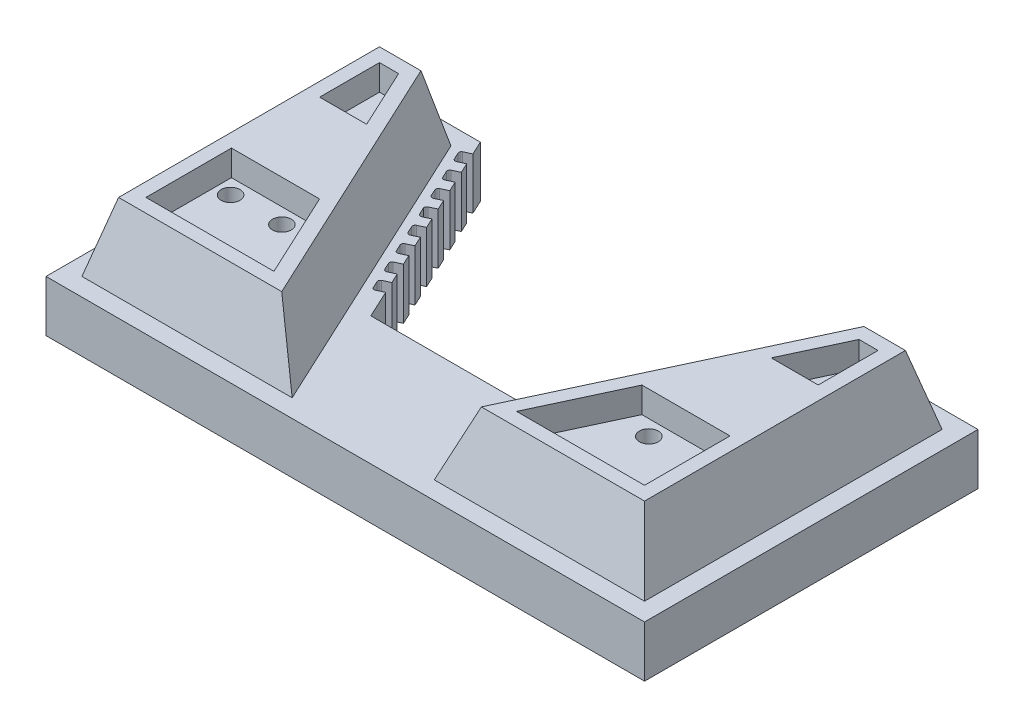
ISO-10303-21;
HEADER;
FILE_DESCRIPTION(('STEP AP214'),'2;1');
FILE_NAME('part.step','',(''),(''),'','','');
FILE_SCHEMA(('AUTOMOTIVE_DESIGN { 1 0 10303 214 1 1 1 1 }'));
ENDSEC;
DATA;
#1=APPLICATION_CONTEXT('core data for automotive mechanical design processes');
#2=APPLICATION_PROTOCOL_DEFINITION('international standard','automotive_design',2000,#1);
#3=PRODUCT_CONTEXT('',#1,'mechanical');
#4=PRODUCT('Part','Part','',(#3));
#5=PRODUCT_RELATED_PRODUCT_CATEGORY('part','',(#4));
#6=PRODUCT_DEFINITION_FORMATION('','',#4);
#7=PRODUCT_DEFINITION_CONTEXT('part definition',#1,'design');
#8=PRODUCT_DEFINITION('design','',#6,#7);
#9=PRODUCT_DEFINITION_SHAPE('','',#8);
#10=(LENGTH_UNIT() NAMED_UNIT(*) SI_UNIT(.MILLI.,.METRE.));
#11=(NAMED_UNIT(*) PLANE_ANGLE_UNIT() SI_UNIT($,.RADIAN.));
#12=(NAMED_UNIT(*) SI_UNIT($,.STERADIAN.) SOLID_ANGLE_UNIT());
#13=UNCERTAINTY_MEASURE_WITH_UNIT(LENGTH_MEASURE(1.E-05),#10,'distance_accuracy_value','');
#14=(GEOMETRIC_REPRESENTATION_CONTEXT(3) GLOBAL_UNCERTAINTY_ASSIGNED_CONTEXT((#13)) GLOBAL_UNIT_ASSIGNED_CONTEXT((#10,
#11,#12)) REPRESENTATION_CONTEXT('',''));
#15=CARTESIAN_POINT('',(0.,0.,0.));
#16=DIRECTION('',(0.,0.,1.));
#17=DIRECTION('',(1.,0.,0.));
#18=AXIS2_PLACEMENT_3D('',#15,#16,#17);
#19=CARTESIAN_POINT('',(600.430810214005,300.,-750.));
#20=DIRECTION('',(0.906307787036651,0.,0.422618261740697));
#21=DIRECTION('',(0.422618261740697,0.,-0.906307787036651));
#22=AXIS2_PLACEMENT_3D('',#19,#20,#21);
#23=PLANE('',#22);
#24=DIRECTION('',(-0.422618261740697,0.,0.906307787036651));
#25=VECTOR('',#24,1.);
#26=CARTESIAN_POINT('',(600.430810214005,0.,-750.));
#27=LINE('',#26,#25);
#28=CARTESIAN_POINT('',(735.268646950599,0.,-1039.16067402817));
#29=VERTEX_POINT('',#28);
#30=CARTESIAN_POINT('',(707.798459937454,0.,-980.250667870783));
#31=VERTEX_POINT('',#30);
#32=EDGE_CURVE('E1800',#29,#31,#27,.T.);
#33=ORIENTED_EDGE('',*,*,#32,.T.);
#34=DIRECTION('',(0.,1.,0.));
#35=VECTOR('',#34,1.);
#36=CARTESIAN_POINT('',(707.798459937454,0.,-980.250667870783));
#37=LINE('',#36,#35);
#38=CARTESIAN_POINT('',(707.798459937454,300.,-980.250667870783));
#39=VERTEX_POINT('',#38);
#40=EDGE_CURVE('E1364',#31,#39,#37,.T.);
#41=ORIENTED_EDGE('',*,*,#40,.T.);
#42=DIRECTION('',(-0.422618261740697,0.,0.906307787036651));
#43=VECTOR('',#42,1.);
#44=CARTESIAN_POINT('',(600.430810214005,300.,-750.));
#45=LINE('',#44,#43);
#46=CARTESIAN_POINT('',(735.268646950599,300.,-1039.16067402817));
#47=VERTEX_POINT('',#46);
#48=EDGE_CURVE('E1817',#47,#39,#45,.T.);
#49=ORIENTED_EDGE('',*,*,#48,.F.);
#50=DIRECTION('',(0.,1.,0.));
#51=VECTOR('',#50,1.);
#52=CARTESIAN_POINT('',(735.268646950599,0.,-1039.16067402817));
#53=LINE('',#52,#51);
#54=EDGE_CURVE('E1378',#29,#47,#53,.T.);
#55=ORIENTED_EDGE('',*,*,#54,.F.);
#56=EDGE_LOOP('',(#33,#41,#49,#55));
#57=FACE_BOUND('',#56,.T.);
#58=ADVANCED_FACE('F46',(#57),#23,.F.);
#59=CARTESIAN_POINT('',(794.435203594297,0.,-1166.0437642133));
#60=VERTEX_POINT('',#59);
#61=CARTESIAN_POINT('',(766.965016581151,0.,-1107.13375805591));
#62=VERTEX_POINT('',#61);
#63=EDGE_CURVE('E1804',#60,#62,#27,.T.);
#64=ORIENTED_EDGE('',*,*,#63,.T.);
#65=DIRECTION('',(0.,1.,0.));
#66=VECTOR('',#65,1.);
#67=CARTESIAN_POINT('',(766.965016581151,0.,-1107.13375805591));
#68=LINE('',#67,#66);
#69=CARTESIAN_POINT('',(766.965016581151,300.,-1107.13375805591));
#70=VERTEX_POINT('',#69);
#71=EDGE_CURVE('E1385',#62,#70,#68,.T.);
#72=ORIENTED_EDGE('',*,*,#71,.T.);
#73=CARTESIAN_POINT('',(794.435203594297,300.,-1166.0437642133));
#74=VERTEX_POINT('',#73);
#75=EDGE_CURVE('E1818',#74,#70,#45,.T.);
#76=ORIENTED_EDGE('',*,*,#75,.F.);
#77=DIRECTION('',(0.,1.,0.));
#78=VECTOR('',#77,1.);
#79=CARTESIAN_POINT('',(794.435203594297,0.,-1166.0437642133));
#80=LINE('',#79,#78);
#81=EDGE_CURVE('E1399',#60,#74,#80,.T.);
#82=ORIENTED_EDGE('',*,*,#81,.F.);
#83=EDGE_LOOP('',(#64,#72,#76,#82));
#84=FACE_BOUND('',#83,.T.);
#85=ADVANCED_FACE('F1927',(#84),#23,.F.);
#86=CARTESIAN_POINT('',(853.601760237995,0.,-1292.92685439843));
#87=VERTEX_POINT('',#86);
#88=CARTESIAN_POINT('',(826.131573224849,0.,-1234.01684824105));
#89=VERTEX_POINT('',#88);
#90=EDGE_CURVE('E1806',#87,#89,#27,.T.);
#91=ORIENTED_EDGE('',*,*,#90,.T.);
#92=DIRECTION('',(0.,1.,0.));
#93=VECTOR('',#92,1.);
#94=CARTESIAN_POINT('',(826.131573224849,0.,-1234.01684824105));
#95=LINE('',#94,#93);
#96=CARTESIAN_POINT('',(826.131573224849,300.,-1234.01684824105));
#97=VERTEX_POINT('',#96);
#98=EDGE_CURVE('E1406',#89,#97,#95,.T.);
#99=ORIENTED_EDGE('',*,*,#98,.T.);
#100=CARTESIAN_POINT('',(853.601760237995,300.,-1292.92685439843));
#101=VERTEX_POINT('',#100);
#102=EDGE_CURVE('E1822',#101,#97,#45,.T.);
#103=ORIENTED_EDGE('',*,*,#102,.F.);
#104=DIRECTION('',(0.,1.,0.));
#105=VECTOR('',#104,1.);
#106=CARTESIAN_POINT('',(853.601760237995,0.,-1292.92685439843));
#107=LINE('',#106,#105);
#108=EDGE_CURVE('E1420',#87,#101,#107,.T.);
#109=ORIENTED_EDGE('',*,*,#108,.F.);
#110=EDGE_LOOP('',(#91,#99,#103,#109));
#111=FACE_BOUND('',#110,.T.);
#112=ADVANCED_FACE('F1896',(#111),#23,.F.);
#113=CARTESIAN_POINT('',(912.768316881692,0.,-1419.80994458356));
#114=VERTEX_POINT('',#113);
#115=CARTESIAN_POINT('',(885.298129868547,0.,-1360.89993842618));
#116=VERTEX_POINT('',#115);
#117=EDGE_CURVE('E1884',#114,#116,#27,.T.);
#118=ORIENTED_EDGE('',*,*,#117,.T.);
#119=DIRECTION('',(0.,1.,0.));
#120=VECTOR('',#119,1.);
#121=CARTESIAN_POINT('',(885.298129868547,0.,-1360.89993842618));
#122=LINE('',#121,#120);
#123=CARTESIAN_POINT('',(885.298129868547,300.,-1360.89993842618));
#124=VERTEX_POINT('',#123);
#125=EDGE_CURVE('E1427',#116,#124,#122,.T.);
#126=ORIENTED_EDGE('',*,*,#125,.T.);
#127=CARTESIAN_POINT('',(912.768316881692,300.,-1419.80994458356));
#128=VERTEX_POINT('',#127);
#129=EDGE_CURVE('E1827',#128,#124,#45,.T.);
#130=ORIENTED_EDGE('',*,*,#129,.F.);
#131=DIRECTION('',(0.,1.,0.));
#132=VECTOR('',#131,1.);
#133=CARTESIAN_POINT('',(912.768316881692,0.,-1419.80994458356));
#134=LINE('',#133,#132);
#135=EDGE_CURVE('E1441',#114,#128,#134,.T.);
#136=ORIENTED_EDGE('',*,*,#135,.F.);
#137=EDGE_LOOP('',(#118,#126,#130,#136));
#138=FACE_BOUND('',#137,.T.);
#139=ADVANCED_FACE('F3478',(#138),#23,.F.);
#140=CARTESIAN_POINT('',(971.93487352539,0.,-1546.69303476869));
#141=VERTEX_POINT('',#140);
#142=CARTESIAN_POINT('',(944.464686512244,0.,-1487.78302861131));
#143=VERTEX_POINT('',#142);
#144=EDGE_CURVE('E1882',#141,#143,#27,.T.);
#145=ORIENTED_EDGE('',*,*,#144,.T.);
#146=DIRECTION('',(0.,1.,0.));
#147=VECTOR('',#146,1.);
#148=CARTESIAN_POINT('',(944.464686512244,0.,-1487.78302861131));
#149=LINE('',#148,#147);
#150=CARTESIAN_POINT('',(944.464686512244,300.,-1487.78302861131));
#151=VERTEX_POINT('',#150);
#152=EDGE_CURVE('E1448',#143,#151,#149,.T.);
#153=ORIENTED_EDGE('',*,*,#152,.T.);
#154=CARTESIAN_POINT('',(971.93487352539,300.,-1546.69303476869));
#155=VERTEX_POINT('',#154);
#156=EDGE_CURVE('E1832',#155,#151,#45,.T.);
#157=ORIENTED_EDGE('',*,*,#156,.F.);
#158=DIRECTION('',(0.,1.,0.));
#159=VECTOR('',#158,1.);
#160=CARTESIAN_POINT('',(971.93487352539,0.,-1546.69303476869));
#161=LINE('',#160,#159);
#162=EDGE_CURVE('E1462',#141,#155,#161,.T.);
#163=ORIENTED_EDGE('',*,*,#162,.F.);
#164=EDGE_LOOP('',(#145,#153,#157,#163));
#165=FACE_BOUND('',#164,.T.);
#166=ADVANCED_FACE('F3471',(#165),#23,.F.);
#167=CARTESIAN_POINT('',(1031.10143016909,0.,-1673.57612495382));
#168=VERTEX_POINT('',#167);
#169=CARTESIAN_POINT('',(1003.63124315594,0.,-1614.66611879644));
#170=VERTEX_POINT('',#169);
#171=EDGE_CURVE('E1879',#168,#170,#27,.T.);
#172=ORIENTED_EDGE('',*,*,#171,.T.);
#173=DIRECTION('',(0.,1.,0.));
#174=VECTOR('',#173,1.);
#175=CARTESIAN_POINT('',(1003.63124315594,0.,-1614.66611879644));
#176=LINE('',#175,#174);
#177=CARTESIAN_POINT('',(1003.63124315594,300.,-1614.66611879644));
#178=VERTEX_POINT('',#177);
#179=EDGE_CURVE('E1469',#170,#178,#176,.T.);
#180=ORIENTED_EDGE('',*,*,#179,.T.);
#181=CARTESIAN_POINT('',(1031.10143016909,300.,-1673.57612495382));
#182=VERTEX_POINT('',#181);
#183=EDGE_CURVE('E1837',#182,#178,#45,.T.);
#184=ORIENTED_EDGE('',*,*,#183,.F.);
#185=DIRECTION('',(0.,1.,0.));
#186=VECTOR('',#185,1.);
#187=CARTESIAN_POINT('',(1031.10143016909,0.,-1673.57612495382));
#188=LINE('',#187,#186);
#189=EDGE_CURVE('E1483',#168,#182,#188,.T.);
#190=ORIENTED_EDGE('',*,*,#189,.F.);
#191=EDGE_LOOP('',(#172,#180,#184,#190));
#192=FACE_BOUND('',#191,.T.);
#193=ADVANCED_FACE('F1878',(#192),#23,.F.);
#194=CARTESIAN_POINT('',(1090.26798681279,0.,-1800.45921513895));
#195=VERTEX_POINT('',#194);
#196=CARTESIAN_POINT('',(1062.79779979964,0.,-1741.54920898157));
#197=VERTEX_POINT('',#196);
#198=EDGE_CURVE('E1633',#195,#197,#27,.T.);
#199=ORIENTED_EDGE('',*,*,#198,.T.);
#200=DIRECTION('',(0.,1.,0.));
#201=VECTOR('',#200,1.);
#202=CARTESIAN_POINT('',(1062.79779979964,0.,-1741.54920898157));
#203=LINE('',#202,#201);
#204=CARTESIAN_POINT('',(1062.79779979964,300.,-1741.54920898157));
#205=VERTEX_POINT('',#204);
#206=EDGE_CURVE('E1490',#197,#205,#203,.T.);
#207=ORIENTED_EDGE('',*,*,#206,.T.);
#208=CARTESIAN_POINT('',(1090.26798681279,300.,-1800.45921513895));
#209=VERTEX_POINT('',#208);
#210=EDGE_CURVE('E1619',#209,#205,#45,.T.);
#211=ORIENTED_EDGE('',*,*,#210,.F.);
#212=DIRECTION('',(0.,1.,0.));
#213=VECTOR('',#212,1.);
#214=CARTESIAN_POINT('',(1090.26798681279,0.,-1800.45921513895));
#215=LINE('',#214,#213);
#216=EDGE_CURVE('E1504',#195,#209,#215,.T.);
#217=ORIENTED_EDGE('',*,*,#216,.F.);
#218=EDGE_LOOP('',(#199,#207,#211,#217));
#219=FACE_BOUND('',#218,.T.);
#220=ADVANCED_FACE('F1852',(#219),#23,.F.);
#221=CARTESIAN_POINT('',(1160.,0.,-1950.));
#222=VERTEX_POINT('',#221);
#223=CARTESIAN_POINT('',(1121.96435644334,0.,-1868.4322991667));
#224=VERTEX_POINT('',#223);
#225=EDGE_CURVE('E1629',#222,#224,#27,.T.);
#226=ORIENTED_EDGE('',*,*,#225,.T.);
#227=DIRECTION('',(0.,1.,0.));
#228=VECTOR('',#227,1.);
#229=CARTESIAN_POINT('',(1121.96435644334,0.,-1868.4322991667));
#230=LINE('',#229,#228);
#231=CARTESIAN_POINT('',(1121.96435644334,300.,-1868.4322991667));
#232=VERTEX_POINT('',#231);
#233=EDGE_CURVE('E1511',#224,#232,#230,.T.);
#234=ORIENTED_EDGE('',*,*,#233,.T.);
#235=CARTESIAN_POINT('',(1160.,300.,-1950.));
#236=VERTEX_POINT('',#235);
#237=EDGE_CURVE('E1615',#236,#232,#45,.T.);
#238=ORIENTED_EDGE('',*,*,#237,.F.);
#239=DIRECTION('',(0.,-1.,0.));
#240=VECTOR('',#239,1.);
#241=CARTESIAN_POINT('',(1160.,300.,-1950.));
#242=LINE('',#241,#240);
#243=EDGE_CURVE('E1641',#236,#222,#242,.T.);
#244=ORIENTED_EDGE('',*,*,#243,.T.);
#245=EDGE_LOOP('',(#226,#234,#238,#244));
#246=FACE_BOUND('',#245,.T.);
#247=ADVANCED_FACE('F1937',(#246),#23,.F.);
#248=CARTESIAN_POINT('',(0.,300.,0.));
#249=DIRECTION('',(0.,1.,0.));
#250=DIRECTION('',(0.,0.,1.));
#251=AXIS2_PLACEMENT_3D('',#248,#249,#250);
#252=PLANE('',#251);
#253=DIRECTION('',(-0.906307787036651,0.,-0.422618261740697));
#254=VECTOR('',#253,1.);
#255=CARTESIAN_POINT('',(707.798459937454,300.,-980.250667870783));
#256=LINE('',#255,#254);
#257=CARTESIAN_POINT('',(748.582310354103,300.,-961.232846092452));
#258=VERTEX_POINT('',#257);
#259=EDGE_CURVE('E1353',#258,#39,#256,.T.);
#260=ORIENTED_EDGE('',*,*,#259,.F.);
#261=CARTESIAN_POINT('',(742.243036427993,300.,-947.638229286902));
#262=DIRECTION('',(0.,1.,0.));
#263=DIRECTION('',(0.,0.,1.));
#264=AXIS2_PLACEMENT_3D('',#261,#262,#263);
#265=CIRCLE('',#264,15.);
#266=CARTESIAN_POINT('',(755.837653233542,300.,-941.298955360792));
#267=VERTEX_POINT('',#266);
#268=EDGE_CURVE('E54',#258,#267,#265,.F.);
#269=ORIENTED_EDGE('',*,*,#268,.T.);
#270=DIRECTION('',(0.422618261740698,0.,-0.906307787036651));
#271=VECTOR('',#270,1.);
#272=CARTESIAN_POINT('',(762.176927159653,300.,-954.893572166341));
#273=LINE('',#272,#271);
#274=CARTESIAN_POINT('',(736.819831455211,300.,-900.515104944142));
#275=VERTEX_POINT('',#274);
#276=EDGE_CURVE('E1360',#275,#267,#273,.T.);
#277=ORIENTED_EDGE('',*,*,#276,.F.);
#278=CARTESIAN_POINT('',(723.225214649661,300.,-906.854378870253));
#279=DIRECTION('',(0.,1.,0.));
#280=DIRECTION('',(0.,0.,1.));
#281=AXIS2_PLACEMENT_3D('',#278,#279,#280);
#282=CIRCLE('',#281,15.);
#283=CARTESIAN_POINT('',(716.885940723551,300.,-893.259762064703));
#284=VERTEX_POINT('',#283);
#285=EDGE_CURVE('E1782',#275,#284,#282,.F.);
#286=ORIENTED_EDGE('',*,*,#285,.T.);
#287=DIRECTION('',(0.906307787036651,0.,0.422618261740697));
#288=VECTOR('',#287,1.);
#289=CARTESIAN_POINT('',(730.4805575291,300.,-886.920488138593));
#290=LINE('',#289,#288);
#291=CARTESIAN_POINT('',(676.102090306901,300.,-912.277583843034));
#292=VERTEX_POINT('',#291);
#293=EDGE_CURVE('E1347',#292,#284,#290,.T.);
#294=ORIENTED_EDGE('',*,*,#293,.F.);
#295=CARTESIAN_POINT('',(600.430810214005,300.,-750.));
#296=VERTEX_POINT('',#295);
#297=EDGE_CURVE('E1614',#292,#296,#45,.T.);
#298=ORIENTED_EDGE('',*,*,#297,.T.);
#299=DIRECTION('',(-1.,0.,0.));
#300=VECTOR('',#299,1.);
#301=CARTESIAN_POINT('',(0.,300.,-750.));
#302=LINE('',#301,#300);
#303=CARTESIAN_POINT('',(-600.430810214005,300.,-750.));
#304=VERTEX_POINT('',#303);
#305=EDGE_CURVE('E1618',#296,#304,#302,.T.);
#306=ORIENTED_EDGE('',*,*,#305,.T.);
#307=DIRECTION('',(0.422618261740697,0.,0.906307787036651));
#308=VECTOR('',#307,1.);
#309=CARTESIAN_POINT('',(-600.430810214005,300.,-750.));
#310=LINE('',#309,#308);
#311=CARTESIAN_POINT('',(-676.102090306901,300.,-912.277583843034));
#312=VERTEX_POINT('',#311);
#313=EDGE_CURVE('E1142',#312,#304,#310,.T.);
#314=ORIENTED_EDGE('',*,*,#313,.F.);
#315=DIRECTION('',(-0.906307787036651,0.,0.422618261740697));
#316=VECTOR('',#315,1.);
#317=CARTESIAN_POINT('',(-730.4805575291,300.,-886.920488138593));
#318=LINE('',#317,#316);
#319=CARTESIAN_POINT('',(-716.885940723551,300.,-893.259762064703));
#320=VERTEX_POINT('',#319);
#321=EDGE_CURVE('E849',#312,#320,#318,.T.);
#322=ORIENTED_EDGE('',*,*,#321,.T.);
#323=CARTESIAN_POINT('',(-723.225214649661,300.,-906.854378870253));
#324=DIRECTION('',(0.,-1.,0.));
#325=DIRECTION('',(0.,0.,1.));
#326=AXIS2_PLACEMENT_3D('',#323,#324,#325);
#327=CIRCLE('',#326,15.);
#328=CARTESIAN_POINT('',(-736.819831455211,300.,-900.515104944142));
#329=VERTEX_POINT('',#328);
#330=EDGE_CURVE('E1315',#329,#320,#327,.F.);
#331=ORIENTED_EDGE('',*,*,#330,.F.);
#332=DIRECTION('',(-0.422618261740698,0.,-0.906307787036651));
#333=VECTOR('',#332,1.);
#334=CARTESIAN_POINT('',(-762.176927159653,300.,-954.893572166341));
#335=LINE('',#334,#333);
#336=CARTESIAN_POINT('',(-755.837653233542,300.,-941.298955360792));
#337=VERTEX_POINT('',#336);
#338=EDGE_CURVE('E2126',#329,#337,#335,.T.);
#339=ORIENTED_EDGE('',*,*,#338,.T.);
#340=CARTESIAN_POINT('',(-742.243036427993,300.,-947.638229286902));
#341=DIRECTION('',(0.,-1.,0.));
#342=DIRECTION('',(0.,0.,1.));
#343=AXIS2_PLACEMENT_3D('',#340,#341,#342);
#344=CIRCLE('',#343,15.);
#345=CARTESIAN_POINT('',(-748.582310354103,300.,-961.232846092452));
#346=VERTEX_POINT('',#345);
#347=EDGE_CURVE('E1319',#346,#337,#344,.F.);
#348=ORIENTED_EDGE('',*,*,#347,.F.);
#349=DIRECTION('',(0.906307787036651,0.,-0.422618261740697));
#350=VECTOR('',#349,1.);
#351=CARTESIAN_POINT('',(-707.798459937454,300.,-980.250667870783));
#352=LINE('',#351,#350);
#353=CARTESIAN_POINT('',(-707.798459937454,300.,-980.250667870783));
#354=VERTEX_POINT('',#353);
#355=EDGE_CURVE('E843',#346,#354,#352,.T.);
#356=ORIENTED_EDGE('',*,*,#355,.T.);
#357=CARTESIAN_POINT('',(-735.268646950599,300.,-1039.16067402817));
#358=VERTEX_POINT('',#357);
#359=EDGE_CURVE('E2110',#358,#354,#310,.T.);
#360=ORIENTED_EDGE('',*,*,#359,.F.);
#361=DIRECTION('',(-0.906307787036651,0.,0.422618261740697));
#362=VECTOR('',#361,1.);
#363=CARTESIAN_POINT('',(-789.647114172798,300.,-1013.80357832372));
#364=LINE('',#363,#362);
#365=CARTESIAN_POINT('',(-776.052497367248,300.,-1020.14285224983));
#366=VERTEX_POINT('',#365);
#367=EDGE_CURVE('E2121',#358,#366,#364,.T.);
#368=ORIENTED_EDGE('',*,*,#367,.T.);
#369=CARTESIAN_POINT('',(-782.391771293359,300.,-1033.73746905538));
#370=DIRECTION('',(0.,-1.,0.));
#371=DIRECTION('',(0.,0.,1.));
#372=AXIS2_PLACEMENT_3D('',#369,#370,#371);
#373=CIRCLE('',#372,15.);
#374=CARTESIAN_POINT('',(-795.986388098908,300.,-1027.39819512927));
#375=VERTEX_POINT('',#374);
#376=EDGE_CURVE('E1295',#375,#366,#373,.F.);
#377=ORIENTED_EDGE('',*,*,#376,.F.);
#378=DIRECTION('',(-0.422618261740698,0.,-0.906307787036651));
#379=VECTOR('',#378,1.);
#380=CARTESIAN_POINT('',(-821.34348380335,300.,-1081.77666235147));
#381=LINE('',#380,#379);
#382=CARTESIAN_POINT('',(-815.00420987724,300.,-1068.18204554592));
#383=VERTEX_POINT('',#382);
#384=EDGE_CURVE('E2131',#375,#383,#381,.T.);
#385=ORIENTED_EDGE('',*,*,#384,.T.);
#386=CARTESIAN_POINT('',(-801.40959307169,300.,-1074.52131947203));
#387=DIRECTION('',(0.,-1.,0.));
#388=DIRECTION('',(0.,0.,1.));
#389=AXIS2_PLACEMENT_3D('',#386,#387,#388);
#390=CIRCLE('',#389,15.);
#391=CARTESIAN_POINT('',(-807.748866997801,300.,-1088.11593627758));
#392=VERTEX_POINT('',#391);
#393=EDGE_CURVE('E1301',#392,#383,#390,.F.);
#394=ORIENTED_EDGE('',*,*,#393,.F.);
#395=DIRECTION('',(0.906307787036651,0.,-0.422618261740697));
#396=VECTOR('',#395,1.);
#397=CARTESIAN_POINT('',(-766.965016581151,300.,-1107.13375805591));
#398=LINE('',#397,#396);
#399=CARTESIAN_POINT('',(-766.965016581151,300.,-1107.13375805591));
#400=VERTEX_POINT('',#399);
#401=EDGE_CURVE('E925',#392,#400,#398,.T.);
#402=ORIENTED_EDGE('',*,*,#401,.T.);
#403=CARTESIAN_POINT('',(-794.435203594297,300.,-1166.0437642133));
#404=VERTEX_POINT('',#403);
#405=EDGE_CURVE('E913',#404,#400,#310,.T.);
#406=ORIENTED_EDGE('',*,*,#405,.F.);
#407=DIRECTION('',(-0.906307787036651,0.,0.422618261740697));
#408=VECTOR('',#407,1.);
#409=CARTESIAN_POINT('',(-848.813670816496,300.,-1140.68666850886));
#410=LINE('',#409,#408);
#411=CARTESIAN_POINT('',(-835.219054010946,300.,-1147.02594243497));
#412=VERTEX_POINT('',#411);
#413=EDGE_CURVE('E916',#404,#412,#410,.T.);
#414=ORIENTED_EDGE('',*,*,#413,.T.);
#415=CARTESIAN_POINT('',(-841.558327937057,300.,-1160.62055924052));
#416=DIRECTION('',(0.,-1.,0.));
#417=DIRECTION('',(0.,0.,1.));
#418=AXIS2_PLACEMENT_3D('',#415,#416,#417);
#419=CIRCLE('',#418,15.);
#420=CARTESIAN_POINT('',(-855.152944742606,300.,-1154.2812853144));
#421=VERTEX_POINT('',#420);
#422=EDGE_CURVE('E1275',#421,#412,#419,.F.);
#423=ORIENTED_EDGE('',*,*,#422,.F.);
#424=DIRECTION('',(-0.422618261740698,0.,-0.906307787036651));
#425=VECTOR('',#424,1.);
#426=CARTESIAN_POINT('',(-880.510040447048,300.,-1208.6597525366));
#427=LINE('',#426,#425);
#428=CARTESIAN_POINT('',(-874.170766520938,300.,-1195.06513573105));
#429=VERTEX_POINT('',#428);
#430=EDGE_CURVE('E920',#421,#429,#427,.T.);
#431=ORIENTED_EDGE('',*,*,#430,.T.);
#432=CARTESIAN_POINT('',(-860.576149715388,300.,-1201.40440965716));
#433=DIRECTION('',(0.,-1.,0.));
#434=DIRECTION('',(0.,0.,1.));
#435=AXIS2_PLACEMENT_3D('',#432,#433,#434);
#436=CIRCLE('',#435,15.);
#437=CARTESIAN_POINT('',(-866.915423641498,300.,-1214.99902646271));
#438=VERTEX_POINT('',#437);
#439=EDGE_CURVE('E1281',#438,#429,#436,.F.);
#440=ORIENTED_EDGE('',*,*,#439,.F.);
#441=DIRECTION('',(0.906307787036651,0.,-0.422618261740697));
#442=VECTOR('',#441,1.);
#443=CARTESIAN_POINT('',(-826.131573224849,300.,-1234.01684824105));
#444=LINE('',#443,#442);
#445=CARTESIAN_POINT('',(-826.131573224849,300.,-1234.01684824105));
#446=VERTEX_POINT('',#445);
#447=EDGE_CURVE('E930',#438,#446,#444,.T.);
#448=ORIENTED_EDGE('',*,*,#447,.T.);
#449=CARTESIAN_POINT('',(-853.601760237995,300.,-1292.92685439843));
#450=VERTEX_POINT('',#449);
#451=EDGE_CURVE('E2092',#450,#446,#310,.T.);
#452=ORIENTED_EDGE('',*,*,#451,.F.);
#453=DIRECTION('',(-0.906307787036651,0.,0.422618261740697));
#454=VECTOR('',#453,1.);
#455=CARTESIAN_POINT('',(-907.980227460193,300.,-1267.56975869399));
#456=LINE('',#455,#454);
#457=CARTESIAN_POINT('',(-894.385610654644,300.,-1273.9090326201));
#458=VERTEX_POINT('',#457);
#459=EDGE_CURVE('E941',#450,#458,#456,.T.);
#460=ORIENTED_EDGE('',*,*,#459,.T.);
#461=CARTESIAN_POINT('',(-900.724884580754,300.,-1287.50364942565));
#462=DIRECTION('',(0.,-1.,0.));
#463=DIRECTION('',(0.,0.,1.));
#464=AXIS2_PLACEMENT_3D('',#461,#462,#463);
#465=CIRCLE('',#464,15.);
#466=CARTESIAN_POINT('',(-914.319501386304,300.,-1281.16437549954));
#467=VERTEX_POINT('',#466);
#468=EDGE_CURVE('E1255',#467,#458,#465,.F.);
#469=ORIENTED_EDGE('',*,*,#468,.F.);
#470=DIRECTION('',(-0.422618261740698,0.,-0.906307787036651));
#471=VECTOR('',#470,1.);
#472=CARTESIAN_POINT('',(-939.676597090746,300.,-1335.54284272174));
#473=LINE('',#472,#471);
#474=CARTESIAN_POINT('',(-933.337323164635,300.,-1321.94822591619));
#475=VERTEX_POINT('',#474);
#476=EDGE_CURVE('E955',#467,#475,#473,.T.);
#477=ORIENTED_EDGE('',*,*,#476,.T.);
#478=CARTESIAN_POINT('',(-919.742706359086,300.,-1328.2874998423));
#479=DIRECTION('',(0.,-1.,0.));
#480=DIRECTION('',(0.,0.,1.));
#481=AXIS2_PLACEMENT_3D('',#478,#479,#480);
#482=CIRCLE('',#481,15.);
#483=CARTESIAN_POINT('',(-926.081980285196,300.,-1341.88211664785));
#484=VERTEX_POINT('',#483);
#485=EDGE_CURVE('E1261',#484,#475,#482,.F.);
#486=ORIENTED_EDGE('',*,*,#485,.F.);
#487=DIRECTION('',(0.906307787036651,0.,-0.422618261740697));
#488=VECTOR('',#487,1.);
#489=CARTESIAN_POINT('',(-885.298129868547,300.,-1360.89993842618));
#490=LINE('',#489,#488);
#491=CARTESIAN_POINT('',(-885.298129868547,300.,-1360.89993842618));
#492=VERTEX_POINT('',#491);
#493=EDGE_CURVE('E947',#484,#492,#490,.T.);
#494=ORIENTED_EDGE('',*,*,#493,.T.);
#495=CARTESIAN_POINT('',(-912.768316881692,300.,-1419.80994458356));
#496=VERTEX_POINT('',#495);
#497=EDGE_CURVE('E2068',#496,#492,#310,.T.);
#498=ORIENTED_EDGE('',*,*,#497,.F.);
#499=DIRECTION('',(-0.906307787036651,0.,0.422618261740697));
#500=VECTOR('',#499,1.);
#501=CARTESIAN_POINT('',(-967.146784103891,300.,-1394.45284887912));
#502=LINE('',#501,#500);
#503=CARTESIAN_POINT('',(-953.552167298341,300.,-1400.79212280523));
#504=VERTEX_POINT('',#503);
#505=EDGE_CURVE('E962',#496,#504,#502,.T.);
#506=ORIENTED_EDGE('',*,*,#505,.T.);
#507=CARTESIAN_POINT('',(-959.891441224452,300.,-1414.38673961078));
#508=DIRECTION('',(0.,-1.,0.));
#509=DIRECTION('',(0.,0.,1.));
#510=AXIS2_PLACEMENT_3D('',#507,#508,#509);
#511=CIRCLE('',#510,15.);
#512=CARTESIAN_POINT('',(-973.486058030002,300.,-1408.04746568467));
#513=VERTEX_POINT('',#512);
#514=EDGE_CURVE('E1235',#513,#504,#511,.F.);
#515=ORIENTED_EDGE('',*,*,#514,.F.);
#516=DIRECTION('',(-0.422618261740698,0.,-0.906307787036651));
#517=VECTOR('',#516,1.);
#518=CARTESIAN_POINT('',(-998.843153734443,300.,-1462.42593290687));
#519=LINE('',#518,#517);
#520=CARTESIAN_POINT('',(-992.503879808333,300.,-1448.83131610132));
#521=VERTEX_POINT('',#520);
#522=EDGE_CURVE('E977',#513,#521,#519,.T.);
#523=ORIENTED_EDGE('',*,*,#522,.T.);
#524=CARTESIAN_POINT('',(-978.909263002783,300.,-1455.17059002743));
#525=DIRECTION('',(0.,-1.,0.));
#526=DIRECTION('',(0.,0.,1.));
#527=AXIS2_PLACEMENT_3D('',#524,#525,#526);
#528=CIRCLE('',#527,15.);
#529=CARTESIAN_POINT('',(-985.248536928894,300.,-1468.76520683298));
#530=VERTEX_POINT('',#529);
#531=EDGE_CURVE('E1241',#530,#521,#528,.F.);
#532=ORIENTED_EDGE('',*,*,#531,.F.);
#533=DIRECTION('',(0.906307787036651,0.,-0.422618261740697));
#534=VECTOR('',#533,1.);
#535=CARTESIAN_POINT('',(-944.464686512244,300.,-1487.78302861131));
#536=LINE('',#535,#534);
#537=CARTESIAN_POINT('',(-944.464686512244,300.,-1487.78302861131));
#538=VERTEX_POINT('',#537);
#539=EDGE_CURVE('E969',#530,#538,#536,.T.);
#540=ORIENTED_EDGE('',*,*,#539,.T.);
#541=CARTESIAN_POINT('',(-971.93487352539,300.,-1546.69303476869));
#542=VERTEX_POINT('',#541);
#543=EDGE_CURVE('E2044',#542,#538,#310,.T.);
#544=ORIENTED_EDGE('',*,*,#543,.F.);
#545=DIRECTION('',(-0.906307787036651,0.,0.422618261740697));
#546=VECTOR('',#545,1.);
#547=CARTESIAN_POINT('',(-1026.31334074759,300.,-1521.33593906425));
#548=LINE('',#547,#546);
#549=CARTESIAN_POINT('',(-1012.71872394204,300.,-1527.67521299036));
#550=VERTEX_POINT('',#549);
#551=EDGE_CURVE('E984',#542,#550,#548,.T.);
#552=ORIENTED_EDGE('',*,*,#551,.T.);
#553=CARTESIAN_POINT('',(-1019.05799786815,300.,-1541.26982979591));
#554=DIRECTION('',(0.,-1.,0.));
#555=DIRECTION('',(0.,0.,1.));
#556=AXIS2_PLACEMENT_3D('',#553,#554,#555);
#557=CIRCLE('',#556,15.);
#558=CARTESIAN_POINT('',(-1032.6526146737,300.,-1534.9305558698));
#559=VERTEX_POINT('',#558);
#560=EDGE_CURVE('E1215',#559,#550,#557,.F.);
#561=ORIENTED_EDGE('',*,*,#560,.F.);
#562=DIRECTION('',(-0.422618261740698,0.,-0.906307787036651));
#563=VECTOR('',#562,1.);
#564=CARTESIAN_POINT('',(-1058.00971037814,300.,-1589.309023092));
#565=LINE('',#564,#563);
#566=CARTESIAN_POINT('',(-1051.67043645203,300.,-1575.71440628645));
#567=VERTEX_POINT('',#566);
#568=EDGE_CURVE('E999',#559,#567,#565,.T.);
#569=ORIENTED_EDGE('',*,*,#568,.T.);
#570=CARTESIAN_POINT('',(-1038.07581964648,300.,-1582.05368021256));
#571=DIRECTION('',(0.,-1.,0.));
#572=DIRECTION('',(0.,0.,1.));
#573=AXIS2_PLACEMENT_3D('',#570,#571,#572);
#574=CIRCLE('',#573,15.);
#575=CARTESIAN_POINT('',(-1044.41509357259,300.,-1595.64829701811));
#576=VERTEX_POINT('',#575);
#577=EDGE_CURVE('E1221',#576,#567,#574,.F.);
#578=ORIENTED_EDGE('',*,*,#577,.F.);
#579=DIRECTION('',(0.906307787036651,0.,-0.422618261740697));
#580=VECTOR('',#579,1.);
#581=CARTESIAN_POINT('',(-1003.63124315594,300.,-1614.66611879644));
#582=LINE('',#581,#580);
#583=CARTESIAN_POINT('',(-1003.63124315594,300.,-1614.66611879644));
#584=VERTEX_POINT('',#583);
#585=EDGE_CURVE('E991',#576,#584,#582,.T.);
#586=ORIENTED_EDGE('',*,*,#585,.T.);
#587=CARTESIAN_POINT('',(-1031.10143016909,300.,-1673.57612495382));
#588=VERTEX_POINT('',#587);
#589=EDGE_CURVE('E2020',#588,#584,#310,.T.);
#590=ORIENTED_EDGE('',*,*,#589,.F.);
#591=DIRECTION('',(-0.906307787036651,0.,0.422618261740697));
#592=VECTOR('',#591,1.);
#593=CARTESIAN_POINT('',(-1085.47989739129,300.,-1648.21902924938));
#594=LINE('',#593,#592);
#595=CARTESIAN_POINT('',(-1071.88528058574,300.,-1654.55830317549));
#596=VERTEX_POINT('',#595);
#597=EDGE_CURVE('E1006',#588,#596,#594,.T.);
#598=ORIENTED_EDGE('',*,*,#597,.T.);
#599=CARTESIAN_POINT('',(-1078.22455451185,300.,-1668.15291998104));
#600=DIRECTION('',(0.,-1.,0.));
#601=DIRECTION('',(0.,0.,1.));
#602=AXIS2_PLACEMENT_3D('',#599,#600,#601);
#603=CIRCLE('',#602,15.);
#604=CARTESIAN_POINT('',(-1091.8191713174,300.,-1661.81364605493));
#605=VERTEX_POINT('',#604);
#606=EDGE_CURVE('E1195',#605,#596,#603,.F.);
#607=ORIENTED_EDGE('',*,*,#606,.F.);
#608=DIRECTION('',(-0.422618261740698,0.,-0.906307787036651));
#609=VECTOR('',#608,1.);
#610=CARTESIAN_POINT('',(-1117.17626702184,300.,-1716.19211327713));
#611=LINE('',#610,#609);
#612=CARTESIAN_POINT('',(-1110.83699309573,300.,-1702.59749647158));
#613=VERTEX_POINT('',#612);
#614=EDGE_CURVE('E1021',#605,#613,#611,.T.);
#615=ORIENTED_EDGE('',*,*,#614,.T.);
#616=CARTESIAN_POINT('',(-1097.24237629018,300.,-1708.93677039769));
#617=DIRECTION('',(0.,-1.,0.));
#618=DIRECTION('',(0.,0.,1.));
#619=AXIS2_PLACEMENT_3D('',#616,#617,#618);
#620=CIRCLE('',#619,15.);
#621=CARTESIAN_POINT('',(-1103.58165021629,300.,-1722.53138720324));
#622=VERTEX_POINT('',#621);
#623=EDGE_CURVE('E1201',#622,#613,#620,.F.);
#624=ORIENTED_EDGE('',*,*,#623,.F.);
#625=DIRECTION('',(0.906307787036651,0.,-0.422618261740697));
#626=VECTOR('',#625,1.);
#627=CARTESIAN_POINT('',(-1062.79779979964,300.,-1741.54920898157));
#628=LINE('',#627,#626);
#629=CARTESIAN_POINT('',(-1062.79779979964,300.,-1741.54920898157));
#630=VERTEX_POINT('',#629);
#631=EDGE_CURVE('E1013',#622,#630,#628,.T.);
#632=ORIENTED_EDGE('',*,*,#631,.T.);
#633=CARTESIAN_POINT('',(-1090.26798681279,300.,-1800.45921513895));
#634=VERTEX_POINT('',#633);
#635=EDGE_CURVE('E1147',#634,#630,#310,.T.);
#636=ORIENTED_EDGE('',*,*,#635,.F.);
#637=DIRECTION('',(-0.906307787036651,0.,0.422618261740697));
#638=VECTOR('',#637,1.);
#639=CARTESIAN_POINT('',(-1144.64645403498,300.,-1775.10211943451));
#640=LINE('',#639,#638);
#641=CARTESIAN_POINT('',(-1131.05183722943,300.,-1781.44139336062));
#642=VERTEX_POINT('',#641);
#643=EDGE_CURVE('E1028',#634,#642,#640,.T.);
#644=ORIENTED_EDGE('',*,*,#643,.T.);
#645=CARTESIAN_POINT('',(-1137.39111115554,300.,-1795.03601016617));
#646=DIRECTION('',(0.,-1.,0.));
#647=DIRECTION('',(0.,0.,1.));
#648=AXIS2_PLACEMENT_3D('',#645,#646,#647);
#649=CIRCLE('',#648,15.);
#650=CARTESIAN_POINT('',(-1150.98572796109,300.,-1788.69673624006));
#651=VERTEX_POINT('',#650);
#652=EDGE_CURVE('E1175',#651,#642,#649,.F.);
#653=ORIENTED_EDGE('',*,*,#652,.F.);
#654=DIRECTION('',(-0.422618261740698,0.,-0.906307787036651));
#655=VECTOR('',#654,1.);
#656=CARTESIAN_POINT('',(-1176.34282366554,300.,-1843.07520346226));
#657=LINE('',#656,#655);
#658=CARTESIAN_POINT('',(-1170.00354973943,300.,-1829.48058665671));
#659=VERTEX_POINT('',#658);
#660=EDGE_CURVE('E1043',#651,#659,#657,.T.);
#661=ORIENTED_EDGE('',*,*,#660,.T.);
#662=CARTESIAN_POINT('',(-1156.40893293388,300.,-1835.81986058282));
#663=DIRECTION('',(0.,-1.,0.));
#664=DIRECTION('',(0.,0.,1.));
#665=AXIS2_PLACEMENT_3D('',#662,#663,#664);
#666=CIRCLE('',#665,15.);
#667=CARTESIAN_POINT('',(-1162.74820685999,300.,-1849.41447738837));
#668=VERTEX_POINT('',#667);
#669=EDGE_CURVE('E1181',#668,#659,#666,.F.);
#670=ORIENTED_EDGE('',*,*,#669,.F.);
#671=DIRECTION('',(0.906307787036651,0.,-0.422618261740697));
#672=VECTOR('',#671,1.);
#673=CARTESIAN_POINT('',(-1121.96435644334,300.,-1868.4322991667));
#674=LINE('',#673,#672);
#675=CARTESIAN_POINT('',(-1121.96435644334,300.,-1868.4322991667));
#676=VERTEX_POINT('',#675);
#677=EDGE_CURVE('E1035',#668,#676,#674,.T.);
#678=ORIENTED_EDGE('',*,*,#677,.T.);
#679=CARTESIAN_POINT('',(-1160.,300.,-1950.));
#680=VERTEX_POINT('',#679);
#681=EDGE_CURVE('E1143',#680,#676,#310,.T.);
#682=ORIENTED_EDGE('',*,*,#681,.F.);
#683=DIRECTION('',(1.,0.,0.));
#684=VECTOR('',#683,1.);
#685=CARTESIAN_POINT('',(-1160.,300.,-1950.));
#686=LINE('',#685,#684);
#687=CARTESIAN_POINT('',(-1750.,300.,-1950.));
#688=VERTEX_POINT('',#687);
#689=EDGE_CURVE('E874',#688,#680,#686,.T.);
#690=ORIENTED_EDGE('',*,*,#689,.F.);
#691=DIRECTION('',(0.,0.,-1.));
#692=VECTOR('',#691,1.);
#693=CARTESIAN_POINT('',(-1750.,300.,-1950.));
#694=LINE('',#693,#692);
#695=CARTESIAN_POINT('',(-1750.,300.,0.));
#696=VERTEX_POINT('',#695);
#697=EDGE_CURVE('E869',#696,#688,#694,.T.);
#698=ORIENTED_EDGE('',*,*,#697,.F.);
#699=DIRECTION('',(1.,0.,0.));
#700=VECTOR('',#699,1.);
#701=CARTESIAN_POINT('',(0.,300.,0.));
#702=LINE('',#701,#700);
#703=CARTESIAN_POINT('',(1750.,300.,0.));
#704=VERTEX_POINT('',#703);
#705=EDGE_CURVE('E1621',#696,#704,#702,.T.);
#706=ORIENTED_EDGE('',*,*,#705,.T.);
#707=DIRECTION('',(0.,0.,-1.));
#708=VECTOR('',#707,1.);
#709=CARTESIAN_POINT('',(1750.,300.,-1950.));
#710=LINE('',#709,#708);
#711=CARTESIAN_POINT('',(1750.,300.,-1950.));
#712=VERTEX_POINT('',#711);
#713=EDGE_CURVE('E1609',#704,#712,#710,.T.);
#714=ORIENTED_EDGE('',*,*,#713,.T.);
#715=DIRECTION('',(-1.,0.,0.));
#716=VECTOR('',#715,1.);
#717=CARTESIAN_POINT('',(1160.,300.,-1950.));
#718=LINE('',#717,#716);
#719=EDGE_CURVE('E1612',#712,#236,#718,.T.);
#720=ORIENTED_EDGE('',*,*,#719,.T.);
#721=ORIENTED_EDGE('',*,*,#237,.T.);
#722=DIRECTION('',(-0.906307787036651,0.,-0.422618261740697));
#723=VECTOR('',#722,1.);
#724=CARTESIAN_POINT('',(1121.96435644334,300.,-1868.4322991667));
#725=LINE('',#724,#723);
#726=CARTESIAN_POINT('',(1162.74820685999,300.,-1849.41447738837));
#727=VERTEX_POINT('',#726);
#728=EDGE_CURVE('E1499',#727,#232,#725,.T.);
#729=ORIENTED_EDGE('',*,*,#728,.F.);
#730=CARTESIAN_POINT('',(1156.40893293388,300.,-1835.81986058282));
#731=DIRECTION('',(0.,1.,0.));
#732=DIRECTION('',(0.,0.,1.));
#733=AXIS2_PLACEMENT_3D('',#730,#731,#732);
#734=CIRCLE('',#733,15.);
#735=CARTESIAN_POINT('',(1170.00354973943,300.,-1829.48058665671));
#736=VERTEX_POINT('',#735);
#737=EDGE_CURVE('E1661',#727,#736,#734,.F.);
#738=ORIENTED_EDGE('',*,*,#737,.T.);
#739=DIRECTION('',(0.422618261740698,0.,-0.906307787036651));
#740=VECTOR('',#739,1.);
#741=CARTESIAN_POINT('',(1176.34282366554,300.,-1843.07520346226));
#742=LINE('',#741,#740);
#743=CARTESIAN_POINT('',(1150.98572796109,300.,-1788.69673624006));
#744=VERTEX_POINT('',#743);
#745=EDGE_CURVE('E1507',#744,#736,#742,.T.);
#746=ORIENTED_EDGE('',*,*,#745,.F.);
#747=CARTESIAN_POINT('',(1137.39111115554,300.,-1795.03601016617));
#748=DIRECTION('',(0.,1.,0.));
#749=DIRECTION('',(0.,0.,1.));
#750=AXIS2_PLACEMENT_3D('',#747,#748,#749);
#751=CIRCLE('',#750,15.);
#752=CARTESIAN_POINT('',(1131.05183722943,300.,-1781.44139336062));
#753=VERTEX_POINT('',#752);
#754=EDGE_CURVE('E1657',#744,#753,#751,.F.);
#755=ORIENTED_EDGE('',*,*,#754,.T.);
#756=DIRECTION('',(0.906307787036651,0.,0.422618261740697));
#757=VECTOR('',#756,1.);
#758=CARTESIAN_POINT('',(1144.64645403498,300.,-1775.10211943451));
#759=LINE('',#758,#757);
#760=EDGE_CURVE('E1493',#209,#753,#759,.T.);
#761=ORIENTED_EDGE('',*,*,#760,.F.);
#762=ORIENTED_EDGE('',*,*,#210,.T.);
#763=DIRECTION('',(-0.906307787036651,0.,-0.422618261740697));
#764=VECTOR('',#763,1.);
#765=CARTESIAN_POINT('',(1062.79779979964,300.,-1741.54920898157));
#766=LINE('',#765,#764);
#767=CARTESIAN_POINT('',(1103.58165021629,300.,-1722.53138720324));
#768=VERTEX_POINT('',#767);
#769=EDGE_CURVE('E1478',#768,#205,#766,.T.);
#770=ORIENTED_EDGE('',*,*,#769,.F.);
#771=CARTESIAN_POINT('',(1097.24237629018,300.,-1708.93677039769));
#772=DIRECTION('',(0.,1.,0.));
#773=DIRECTION('',(0.,0.,1.));
#774=AXIS2_PLACEMENT_3D('',#771,#772,#773);
#775=CIRCLE('',#774,15.);
#776=CARTESIAN_POINT('',(1110.83699309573,300.,-1702.59749647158));
#777=VERTEX_POINT('',#776);
#778=EDGE_CURVE('E1679',#768,#777,#775,.F.);
#779=ORIENTED_EDGE('',*,*,#778,.T.);
#780=DIRECTION('',(0.422618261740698,0.,-0.906307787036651));
#781=VECTOR('',#780,1.);
#782=CARTESIAN_POINT('',(1117.17626702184,300.,-1716.19211327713));
#783=LINE('',#782,#781);
#784=CARTESIAN_POINT('',(1091.8191713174,300.,-1661.81364605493));
#785=VERTEX_POINT('',#784);
#786=EDGE_CURVE('E1486',#785,#777,#783,.T.);
#787=ORIENTED_EDGE('',*,*,#786,.F.);
#788=CARTESIAN_POINT('',(1078.22455451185,300.,-1668.15291998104));
#789=DIRECTION('',(0.,1.,0.));
#790=DIRECTION('',(0.,0.,1.));
#791=AXIS2_PLACEMENT_3D('',#788,#789,#790);
#792=CIRCLE('',#791,15.);
#793=CARTESIAN_POINT('',(1071.88528058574,300.,-1654.55830317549));
#794=VERTEX_POINT('',#793);
#795=EDGE_CURVE('E1675',#785,#794,#792,.F.);
#796=ORIENTED_EDGE('',*,*,#795,.T.);
#797=DIRECTION('',(0.906307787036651,0.,0.422618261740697));
#798=VECTOR('',#797,1.);
#799=CARTESIAN_POINT('',(1085.47989739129,300.,-1648.21902924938));
#800=LINE('',#799,#798);
#801=EDGE_CURVE('E1472',#182,#794,#800,.T.);
#802=ORIENTED_EDGE('',*,*,#801,.F.);
#803=ORIENTED_EDGE('',*,*,#183,.T.);
#804=DIRECTION('',(-0.906307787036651,0.,-0.422618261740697));
#805=VECTOR('',#804,1.);
#806=CARTESIAN_POINT('',(1003.63124315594,300.,-1614.66611879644));
#807=LINE('',#806,#805);
#808=CARTESIAN_POINT('',(1044.41509357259,300.,-1595.64829701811));
#809=VERTEX_POINT('',#808);
#810=EDGE_CURVE('E1457',#809,#178,#807,.T.);
#811=ORIENTED_EDGE('',*,*,#810,.F.);
#812=CARTESIAN_POINT('',(1038.07581964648,300.,-1582.05368021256));
#813=DIRECTION('',(0.,1.,0.));
#814=DIRECTION('',(0.,0.,1.));
#815=AXIS2_PLACEMENT_3D('',#812,#813,#814);
#816=CIRCLE('',#815,15.);
#817=CARTESIAN_POINT('',(1051.67043645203,300.,-1575.71440628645));
#818=VERTEX_POINT('',#817);
#819=EDGE_CURVE('E1697',#809,#818,#816,.F.);
#820=ORIENTED_EDGE('',*,*,#819,.T.);
#821=DIRECTION('',(0.422618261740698,0.,-0.906307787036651));
#822=VECTOR('',#821,1.);
#823=CARTESIAN_POINT('',(1058.00971037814,300.,-1589.309023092));
#824=LINE('',#823,#822);
#825=CARTESIAN_POINT('',(1032.6526146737,300.,-1534.9305558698));
#826=VERTEX_POINT('',#825);
#827=EDGE_CURVE('E1465',#826,#818,#824,.T.);
#828=ORIENTED_EDGE('',*,*,#827,.F.);
#829=CARTESIAN_POINT('',(1019.05799786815,300.,-1541.26982979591));
#830=DIRECTION('',(0.,1.,0.));
#831=DIRECTION('',(0.,0.,1.));
#832=AXIS2_PLACEMENT_3D('',#829,#830,#831);
#833=CIRCLE('',#832,15.);
#834=CARTESIAN_POINT('',(1012.71872394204,300.,-1527.67521299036));
#835=VERTEX_POINT('',#834);
#836=EDGE_CURVE('E1693',#826,#835,#833,.F.);
#837=ORIENTED_EDGE('',*,*,#836,.T.);
#838=DIRECTION('',(0.906307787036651,0.,0.422618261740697));
#839=VECTOR('',#838,1.);
#840=CARTESIAN_POINT('',(1026.31334074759,300.,-1521.33593906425));
#841=LINE('',#840,#839);
#842=EDGE_CURVE('E1451',#155,#835,#841,.T.);
#843=ORIENTED_EDGE('',*,*,#842,.F.);
#844=ORIENTED_EDGE('',*,*,#156,.T.);
#845=DIRECTION('',(-0.906307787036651,0.,-0.422618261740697));
#846=VECTOR('',#845,1.);
#847=CARTESIAN_POINT('',(944.464686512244,300.,-1487.78302861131));
#848=LINE('',#847,#846);
#849=CARTESIAN_POINT('',(985.248536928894,300.,-1468.76520683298));
#850=VERTEX_POINT('',#849);
#851=EDGE_CURVE('E1436',#850,#151,#848,.T.);
#852=ORIENTED_EDGE('',*,*,#851,.F.);
#853=CARTESIAN_POINT('',(978.909263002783,300.,-1455.17059002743));
#854=DIRECTION('',(0.,1.,0.));
#855=DIRECTION('',(0.,0.,1.));
#856=AXIS2_PLACEMENT_3D('',#853,#854,#855);
#857=CIRCLE('',#856,15.);
#858=CARTESIAN_POINT('',(992.503879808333,300.,-1448.83131610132));
#859=VERTEX_POINT('',#858);
#860=EDGE_CURVE('E1715',#850,#859,#857,.F.);
#861=ORIENTED_EDGE('',*,*,#860,.T.);
#862=DIRECTION('',(0.422618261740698,0.,-0.906307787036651));
#863=VECTOR('',#862,1.);
#864=CARTESIAN_POINT('',(998.843153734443,300.,-1462.42593290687));
#865=LINE('',#864,#863);
#866=CARTESIAN_POINT('',(973.486058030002,300.,-1408.04746568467));
#867=VERTEX_POINT('',#866);
#868=EDGE_CURVE('E1444',#867,#859,#865,.T.);
#869=ORIENTED_EDGE('',*,*,#868,.F.);
#870=CARTESIAN_POINT('',(959.891441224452,300.,-1414.38673961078));
#871=DIRECTION('',(0.,1.,0.));
#872=DIRECTION('',(0.,0.,1.));
#873=AXIS2_PLACEMENT_3D('',#870,#871,#872);
#874=CIRCLE('',#873,15.);
#875=CARTESIAN_POINT('',(953.552167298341,300.,-1400.79212280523));
#876=VERTEX_POINT('',#875);
#877=EDGE_CURVE('E1711',#867,#876,#874,.F.);
#878=ORIENTED_EDGE('',*,*,#877,.T.);
#879=DIRECTION('',(0.906307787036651,0.,0.422618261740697));
#880=VECTOR('',#879,1.);
#881=CARTESIAN_POINT('',(967.146784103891,300.,-1394.45284887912));
#882=LINE('',#881,#880);
#883=EDGE_CURVE('E1430',#128,#876,#882,.T.);
#884=ORIENTED_EDGE('',*,*,#883,.F.);
#885=ORIENTED_EDGE('',*,*,#129,.T.);
#886=DIRECTION('',(-0.906307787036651,0.,-0.422618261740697));
#887=VECTOR('',#886,1.);
#888=CARTESIAN_POINT('',(885.298129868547,300.,-1360.89993842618));
#889=LINE('',#888,#887);
#890=CARTESIAN_POINT('',(926.081980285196,300.,-1341.88211664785));
#891=VERTEX_POINT('',#890);
#892=EDGE_CURVE('E1415',#891,#124,#889,.T.);
#893=ORIENTED_EDGE('',*,*,#892,.F.);
#894=CARTESIAN_POINT('',(919.742706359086,300.,-1328.2874998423));
#895=DIRECTION('',(0.,1.,0.));
#896=DIRECTION('',(0.,0.,1.));
#897=AXIS2_PLACEMENT_3D('',#894,#895,#896);
#898=CIRCLE('',#897,15.);
#899=CARTESIAN_POINT('',(933.337323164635,300.,-1321.94822591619));
#900=VERTEX_POINT('',#899);
#901=EDGE_CURVE('E1733',#891,#900,#898,.F.);
#902=ORIENTED_EDGE('',*,*,#901,.T.);
#903=DIRECTION('',(0.422618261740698,0.,-0.906307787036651));
#904=VECTOR('',#903,1.);
#905=CARTESIAN_POINT('',(939.676597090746,300.,-1335.54284272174));
#906=LINE('',#905,#904);
#907=CARTESIAN_POINT('',(914.319501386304,300.,-1281.16437549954));
#908=VERTEX_POINT('',#907);
#909=EDGE_CURVE('E1423',#908,#900,#906,.T.);
#910=ORIENTED_EDGE('',*,*,#909,.F.);
#911=CARTESIAN_POINT('',(900.724884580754,300.,-1287.50364942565));
#912=DIRECTION('',(0.,1.,0.));
#913=DIRECTION('',(0.,0.,1.));
#914=AXIS2_PLACEMENT_3D('',#911,#912,#913);
#915=CIRCLE('',#914,15.);
#916=CARTESIAN_POINT('',(894.385610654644,300.,-1273.9090326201));
#917=VERTEX_POINT('',#916);
#918=EDGE_CURVE('E1729',#908,#917,#915,.F.);
#919=ORIENTED_EDGE('',*,*,#918,.T.);
#920=DIRECTION('',(0.906307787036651,0.,0.422618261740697));
#921=VECTOR('',#920,1.);
#922=CARTESIAN_POINT('',(907.980227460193,300.,-1267.56975869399));
#923=LINE('',#922,#921);
#924=EDGE_CURVE('E1409',#101,#917,#923,.T.);
#925=ORIENTED_EDGE('',*,*,#924,.F.);
#926=ORIENTED_EDGE('',*,*,#102,.T.);
#927=DIRECTION('',(-0.906307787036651,0.,-0.422618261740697));
#928=VECTOR('',#927,1.);
#929=CARTESIAN_POINT('',(826.131573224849,300.,-1234.01684824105));
#930=LINE('',#929,#928);
#931=CARTESIAN_POINT('',(866.915423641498,300.,-1214.99902646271));
#932=VERTEX_POINT('',#931);
#933=EDGE_CURVE('E1394',#932,#97,#930,.T.);
#934=ORIENTED_EDGE('',*,*,#933,.F.);
#935=CARTESIAN_POINT('',(860.576149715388,300.,-1201.40440965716));
#936=DIRECTION('',(0.,1.,0.));
#937=DIRECTION('',(0.,0.,1.));
#938=AXIS2_PLACEMENT_3D('',#935,#936,#937);
#939=CIRCLE('',#938,15.);
#940=CARTESIAN_POINT('',(874.170766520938,300.,-1195.06513573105));
#941=VERTEX_POINT('',#940);
#942=EDGE_CURVE('E1751',#932,#941,#939,.F.);
#943=ORIENTED_EDGE('',*,*,#942,.T.);
#944=DIRECTION('',(0.422618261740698,0.,-0.906307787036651));
#945=VECTOR('',#944,1.);
#946=CARTESIAN_POINT('',(880.510040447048,300.,-1208.6597525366));
#947=LINE('',#946,#945);
#948=CARTESIAN_POINT('',(855.152944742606,300.,-1154.2812853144));
#949=VERTEX_POINT('',#948);
#950=EDGE_CURVE('E1402',#949,#941,#947,.T.);
#951=ORIENTED_EDGE('',*,*,#950,.F.);
#952=CARTESIAN_POINT('',(841.558327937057,300.,-1160.62055924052));
#953=DIRECTION('',(0.,1.,0.));
#954=DIRECTION('',(0.,0.,1.));
#955=AXIS2_PLACEMENT_3D('',#952,#953,#954);
#956=CIRCLE('',#955,15.);
#957=CARTESIAN_POINT('',(835.219054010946,300.,-1147.02594243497));
#958=VERTEX_POINT('',#957);
#959=EDGE_CURVE('E1747',#949,#958,#956,.F.);
#960=ORIENTED_EDGE('',*,*,#959,.T.);
#961=DIRECTION('',(0.906307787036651,0.,0.422618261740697));
#962=VECTOR('',#961,1.);
#963=CARTESIAN_POINT('',(848.813670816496,300.,-1140.68666850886));
#964=LINE('',#963,#962);
#965=EDGE_CURVE('E1388',#74,#958,#964,.T.);
#966=ORIENTED_EDGE('',*,*,#965,.F.);
#967=ORIENTED_EDGE('',*,*,#75,.T.);
#968=DIRECTION('',(-0.906307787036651,0.,-0.422618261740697));
#969=VECTOR('',#968,1.);
#970=CARTESIAN_POINT('',(766.965016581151,300.,-1107.13375805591));
#971=LINE('',#970,#969);
#972=CARTESIAN_POINT('',(807.748866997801,300.,-1088.11593627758));
#973=VERTEX_POINT('',#972);
#974=EDGE_CURVE('E1373',#973,#70,#971,.T.);
#975=ORIENTED_EDGE('',*,*,#974,.F.);
#976=CARTESIAN_POINT('',(801.40959307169,300.,-1074.52131947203));
#977=DIRECTION('',(0.,1.,0.));
#978=DIRECTION('',(0.,0.,1.));
#979=AXIS2_PLACEMENT_3D('',#976,#977,#978);
#980=CIRCLE('',#979,15.);
#981=CARTESIAN_POINT('',(815.00420987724,300.,-1068.18204554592));
#982=VERTEX_POINT('',#981);
#983=EDGE_CURVE('E1769',#973,#982,#980,.F.);
#984=ORIENTED_EDGE('',*,*,#983,.T.);
#985=DIRECTION('',(0.422618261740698,0.,-0.906307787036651));
#986=VECTOR('',#985,1.);
#987=CARTESIAN_POINT('',(821.34348380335,300.,-1081.77666235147));
#988=LINE('',#987,#986);
#989=CARTESIAN_POINT('',(795.986388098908,300.,-1027.39819512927));
#990=VERTEX_POINT('',#989);
#991=EDGE_CURVE('E1381',#990,#982,#988,.T.);
#992=ORIENTED_EDGE('',*,*,#991,.F.);
#993=CARTESIAN_POINT('',(782.391771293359,300.,-1033.73746905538));
#994=DIRECTION('',(0.,1.,0.));
#995=DIRECTION('',(0.,0.,1.));
#996=AXIS2_PLACEMENT_3D('',#993,#994,#995);
#997=CIRCLE('',#996,15.);
#998=CARTESIAN_POINT('',(776.052497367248,300.,-1020.14285224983));
#999=VERTEX_POINT('',#998);
#1000=EDGE_CURVE('E1765',#990,#999,#997,.F.);
#1001=ORIENTED_EDGE('',*,*,#1000,.T.);
#1002=DIRECTION('',(0.906307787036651,0.,0.422618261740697));
#1003=VECTOR('',#1002,1.);
#1004=CARTESIAN_POINT('',(789.647114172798,300.,-1013.80357832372));
#1005=LINE('',#1004,#1003);
#1006=EDGE_CURVE('E1367',#47,#999,#1005,.T.);
#1007=ORIENTED_EDGE('',*,*,#1006,.F.);
#1008=ORIENTED_EDGE('',*,*,#48,.T.);
#1009=EDGE_LOOP('',(#260,#269,#277,#286,#294,#298,#306,#314,#322,#331,#339,#348,#356,#360,#368,
#377,#385,#394,#402,#406,#414,#423,#431,#440,#448,#452,#460,#469,#477,#486,#494,#498,#506,#515,
#523,#532,#540,#544,#552,#561,#569,#578,#586,#590,#598,#607,#615,#624,#632,#636,#644,#653,#661,
#670,#678,#682,#690,#698,#706,#714,#720,#721,#729,#738,#746,#755,#761,#762,#770,#779,#787,#796,
#802,#803,#811,#820,#828,#837,#843,#844,#852,#861,#869,#878,#884,#885,#893,#902,#910,#919,#925,
#926,#934,#943,#951,#960,#966,#967,#975,#984,#992,#1001,#1007,#1008));
#1010=FACE_BOUND('',#1009,.T.);
#1011=DIRECTION('',(0.,0.,-1.));
#1012=VECTOR('',#1011,1.);
#1013=CARTESIAN_POINT('',(1645.,300.,-105.));
#1014=LINE('',#1013,#1012);
#1015=CARTESIAN_POINT('',(1645.,300.,-105.));
#1016=VERTEX_POINT('',#1015);
#1017=CARTESIAN_POINT('',(1645.,300.,-1845.));
#1018=VERTEX_POINT('',#1017);
#1019=EDGE_CURVE('E1582',#1016,#1018,#1014,.T.);
#1020=ORIENTED_EDGE('',*,*,#1019,.F.);
#1021=DIRECTION('',(1.,0.,0.));
#1022=VECTOR('',#1021,1.);
#1023=CARTESIAN_POINT('',(415.517052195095,300.,-105.));
#1024=LINE('',#1023,#1022);
#1025=CARTESIAN_POINT('',(415.517052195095,300.,-105.));
#1026=VERTEX_POINT('',#1025);
#1027=EDGE_CURVE('E1573',#1026,#1016,#1024,.T.);
#1028=ORIENTED_EDGE('',*,*,#1027,.F.);
#1029=DIRECTION('',(-0.422618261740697,0.,0.906307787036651));
#1030=VECTOR('',#1029,1.);
#1031=CARTESIAN_POINT('',(1226.89237738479,300.,-1845.));
#1032=LINE('',#1031,#1030);
#1033=CARTESIAN_POINT('',(1226.89237738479,300.,-1845.));
#1034=VERTEX_POINT('',#1033);
#1035=EDGE_CURVE('E1587',#1034,#1026,#1032,.T.);
#1036=ORIENTED_EDGE('',*,*,#1035,.F.);
#1037=DIRECTION('',(-1.,0.,0.));
#1038=VECTOR('',#1037,1.);
#1039=CARTESIAN_POINT('',(1645.,300.,-1845.));
#1040=LINE('',#1039,#1038);
#1041=EDGE_CURVE('E1584',#1018,#1034,#1040,.T.);
#1042=ORIENTED_EDGE('',*,*,#1041,.F.);
#1043=EDGE_LOOP('',(#1020,#1028,#1036,#1042));
#1044=FACE_BOUND('',#1043,.T.);
#1045=DIRECTION('',(0.,0.,-1.));
#1046=VECTOR('',#1045,1.);
#1047=CARTESIAN_POINT('',(-1645.,300.,-105.));
#1048=LINE('',#1047,#1046);
#1049=CARTESIAN_POINT('',(-1645.,300.,-105.));
#1050=VERTEX_POINT('',#1049);
#1051=CARTESIAN_POINT('',(-1645.,300.,-1845.));
#1052=VERTEX_POINT('',#1051);
#1053=EDGE_CURVE('E1113',#1050,#1052,#1048,.T.);
#1054=ORIENTED_EDGE('',*,*,#1053,.T.);
#1055=DIRECTION('',(1.,0.,0.));
#1056=VECTOR('',#1055,1.);
#1057=CARTESIAN_POINT('',(-1645.,300.,-1845.));
#1058=LINE('',#1057,#1056);
#1059=CARTESIAN_POINT('',(-1226.89237738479,300.,-1845.));
#1060=VERTEX_POINT('',#1059);
#1061=EDGE_CURVE('E1116',#1052,#1060,#1058,.T.);
#1062=ORIENTED_EDGE('',*,*,#1061,.T.);
#1063=DIRECTION('',(0.422618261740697,0.,0.906307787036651));
#1064=VECTOR('',#1063,1.);
#1065=CARTESIAN_POINT('',(-1226.89237738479,300.,-1845.));
#1066=LINE('',#1065,#1064);
#1067=CARTESIAN_POINT('',(-415.517052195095,300.,-105.));
#1068=VERTEX_POINT('',#1067);
#1069=EDGE_CURVE('E1119',#1060,#1068,#1066,.T.);
#1070=ORIENTED_EDGE('',*,*,#1069,.T.);
#1071=DIRECTION('',(-1.,0.,0.));
#1072=VECTOR('',#1071,1.);
#1073=CARTESIAN_POINT('',(-415.517052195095,300.,-105.));
#1074=LINE('',#1073,#1072);
#1075=EDGE_CURVE('E1105',#1068,#1050,#1074,.T.);
#1076=ORIENTED_EDGE('',*,*,#1075,.T.);
#1077=EDGE_LOOP('',(#1054,#1062,#1070,#1076));
#1078=FACE_BOUND('',#1077,.T.);
#1079=ADVANCED_FACE('F1788',(#1010,#1044,#1078),#252,.T.);
#1080=CARTESIAN_POINT('',(1750.,300.,-1950.));
#1081=DIRECTION('',(-1.,0.,0.));
#1082=DIRECTION('',(0.,0.,1.));
#1083=AXIS2_PLACEMENT_3D('',#1080,#1081,#1082);
#1084=PLANE('',#1083);
#1085=DIRECTION('',(0.,0.,-1.));
#1086=VECTOR('',#1085,1.);
#1087=CARTESIAN_POINT('',(1750.,0.,-1950.));
#1088=LINE('',#1087,#1086);
#1089=CARTESIAN_POINT('',(1750.,0.,0.));
#1090=VERTEX_POINT('',#1089);
#1091=CARTESIAN_POINT('',(1750.,0.,-1950.));
#1092=VERTEX_POINT('',#1091);
#1093=EDGE_CURVE('E1592',#1090,#1092,#1088,.T.);
#1094=ORIENTED_EDGE('',*,*,#1093,.T.);
#1095=DIRECTION('',(0.,-1.,0.));
#1096=VECTOR('',#1095,1.);
#1097=CARTESIAN_POINT('',(1750.,300.,-1950.));
#1098=LINE('',#1097,#1096);
#1099=EDGE_CURVE('E1644',#712,#1092,#1098,.T.);
#1100=ORIENTED_EDGE('',*,*,#1099,.F.);
#1101=ORIENTED_EDGE('',*,*,#713,.F.);
#1102=DIRECTION('',(0.,-1.,0.));
#1103=VECTOR('',#1102,1.);
#1104=CARTESIAN_POINT('',(1750.,300.,0.));
#1105=LINE('',#1104,#1103);
#1106=EDGE_CURVE('E1623',#704,#1090,#1105,.T.);
#1107=ORIENTED_EDGE('',*,*,#1106,.T.);
#1108=EDGE_LOOP('',(#1094,#1100,#1101,#1107));
#1109=FACE_BOUND('',#1108,.T.);
#1110=ADVANCED_FACE('F1943',(#1109),#1084,.F.);
#1111=CARTESIAN_POINT('',(1160.,300.,-1950.));
#1112=DIRECTION('',(0.,0.,1.));
#1113=DIRECTION('',(1.,0.,0.));
#1114=AXIS2_PLACEMENT_3D('',#1111,#1112,#1113);
#1115=PLANE('',#1114);
#1116=DIRECTION('',(-1.,0.,0.));
#1117=VECTOR('',#1116,1.);
#1118=CARTESIAN_POINT('',(1160.,0.,-1950.));
#1119=LINE('',#1118,#1117);
#1120=EDGE_CURVE('E1626',#1092,#222,#1119,.T.);
#1121=ORIENTED_EDGE('',*,*,#1120,.T.);
#1122=ORIENTED_EDGE('',*,*,#243,.F.);
#1123=ORIENTED_EDGE('',*,*,#719,.F.);
#1124=ORIENTED_EDGE('',*,*,#1099,.T.);
#1125=EDGE_LOOP('',(#1121,#1122,#1123,#1124));
#1126=FACE_BOUND('',#1125,.T.);
#1127=ADVANCED_FACE('F1936',(#1126),#1115,.F.);
#1128=ORIENTED_EDGE('',*,*,#297,.F.);
#1129=DIRECTION('',(0.,1.,0.));
#1130=VECTOR('',#1129,1.);
#1131=CARTESIAN_POINT('',(676.102090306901,0.,-912.277583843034));
#1132=LINE('',#1131,#1130);
#1133=CARTESIAN_POINT('',(676.102090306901,0.,-912.277583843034));
#1134=VERTEX_POINT('',#1133);
#1135=EDGE_CURVE('E1357',#1134,#292,#1132,.T.);
#1136=ORIENTED_EDGE('',*,*,#1135,.F.);
#1137=CARTESIAN_POINT('',(600.430810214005,0.,-750.));
#1138=VERTEX_POINT('',#1137);
#1139=EDGE_CURVE('E1628',#1134,#1138,#27,.T.);
#1140=ORIENTED_EDGE('',*,*,#1139,.T.);
#1141=DIRECTION('',(0.,-1.,0.));
#1142=VECTOR('',#1141,1.);
#1143=CARTESIAN_POINT('',(600.430810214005,300.,-750.));
#1144=LINE('',#1143,#1142);
#1145=EDGE_CURVE('E1638',#296,#1138,#1144,.T.);
#1146=ORIENTED_EDGE('',*,*,#1145,.F.);
#1147=EDGE_LOOP('',(#1128,#1136,#1140,#1146));
#1148=FACE_BOUND('',#1147,.T.);
#1149=ADVANCED_FACE('F1812',(#1148),#23,.F.);
#1150=CARTESIAN_POINT('',(0.,300.,-750.));
#1151=DIRECTION('',(0.,0.,1.));
#1152=DIRECTION('',(1.,0.,0.));
#1153=AXIS2_PLACEMENT_3D('',#1150,#1151,#1152);
#1154=PLANE('',#1153);
#1155=DIRECTION('',(-1.,0.,0.));
#1156=VECTOR('',#1155,1.);
#1157=CARTESIAN_POINT('',(0.,0.,-750.));
#1158=LINE('',#1157,#1156);
#1159=CARTESIAN_POINT('',(-600.430810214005,0.,-750.));
#1160=VERTEX_POINT('',#1159);
#1161=EDGE_CURVE('E1632',#1138,#1160,#1158,.T.);
#1162=ORIENTED_EDGE('',*,*,#1161,.T.);
#1163=DIRECTION('',(0.,-1.,0.));
#1164=VECTOR('',#1163,1.);
#1165=CARTESIAN_POINT('',(-600.430810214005,300.,-750.));
#1166=LINE('',#1165,#1164);
#1167=EDGE_CURVE('E858',#304,#1160,#1166,.T.);
#1168=ORIENTED_EDGE('',*,*,#1167,.F.);
#1169=ORIENTED_EDGE('',*,*,#305,.F.);
#1170=ORIENTED_EDGE('',*,*,#1145,.T.);
#1171=EDGE_LOOP('',(#1162,#1168,#1169,#1170));
#1172=FACE_BOUND('',#1171,.T.);
#1173=ADVANCED_FACE('F1815',(#1172),#1154,.F.);
#1174=CARTESIAN_POINT('',(0.,300.,0.));
#1175=DIRECTION('',(0.,0.,-1.));
#1176=DIRECTION('',(-1.,0.,0.));
#1177=AXIS2_PLACEMENT_3D('',#1174,#1175,#1176);
#1178=PLANE('',#1177);
#1179=DIRECTION('',(1.,0.,0.));
#1180=VECTOR('',#1179,1.);
#1181=CARTESIAN_POINT('',(0.,0.,0.));
#1182=LINE('',#1181,#1180);
#1183=CARTESIAN_POINT('',(-1750.,0.,0.));
#1184=VERTEX_POINT('',#1183);
#1185=EDGE_CURVE('E1152',#1184,#1090,#1182,.T.);
#1186=ORIENTED_EDGE('',*,*,#1185,.T.);
#1187=ORIENTED_EDGE('',*,*,#1106,.F.);
#1188=ORIENTED_EDGE('',*,*,#705,.F.);
#1189=DIRECTION('',(0.,-1.,0.));
#1190=VECTOR('',#1189,1.);
#1191=CARTESIAN_POINT('',(-1750.,300.,0.));
#1192=LINE('',#1191,#1190);
#1193=EDGE_CURVE('E1146',#696,#1184,#1192,.T.);
#1194=ORIENTED_EDGE('',*,*,#1193,.T.);
#1195=EDGE_LOOP('',(#1186,#1187,#1188,#1194));
#1196=FACE_BOUND('',#1195,.T.);
#1197=ADVANCED_FACE('F1942',(#1196),#1178,.F.);
#1198=CARTESIAN_POINT('',(0.,0.,0.));
#1199=DIRECTION('',(0.,1.,0.));
#1200=DIRECTION('',(0.,0.,1.));
#1201=AXIS2_PLACEMENT_3D('',#1198,#1199,#1200);
#1202=PLANE('',#1201);
#1203=DIRECTION('',(0.906307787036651,0.,0.422618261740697));
#1204=VECTOR('',#1203,1.);
#1205=CARTESIAN_POINT('',(730.4805575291,0.,-886.920488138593));
#1206=LINE('',#1205,#1204);
#1207=CARTESIAN_POINT('',(716.885940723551,0.,-893.259762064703));
#1208=VERTEX_POINT('',#1207);
#1209=EDGE_CURVE('E1350',#1134,#1208,#1206,.T.);
#1210=ORIENTED_EDGE('',*,*,#1209,.T.);
#1211=CARTESIAN_POINT('',(723.225214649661,0.,-906.854378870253));
#1212=DIRECTION('',(0.,1.,0.));
#1213=DIRECTION('',(0.,0.,1.));
#1214=AXIS2_PLACEMENT_3D('',#1211,#1212,#1213);
#1215=CIRCLE('',#1214,15.);
#1216=CARTESIAN_POINT('',(736.819831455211,0.,-900.515104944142));
#1217=VERTEX_POINT('',#1216);
#1218=EDGE_CURVE('E1784',#1208,#1217,#1215,.T.);
#1219=ORIENTED_EDGE('',*,*,#1218,.T.);
#1220=DIRECTION('',(0.422618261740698,0.,-0.906307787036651));
#1221=VECTOR('',#1220,1.);
#1222=CARTESIAN_POINT('',(762.176927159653,0.,-954.893572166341));
#1223=LINE('',#1222,#1221);
#1224=CARTESIAN_POINT('',(755.837653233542,0.,-941.298955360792));
#1225=VERTEX_POINT('',#1224);
#1226=EDGE_CURVE('E1352',#1217,#1225,#1223,.T.);
#1227=ORIENTED_EDGE('',*,*,#1226,.T.);
#1228=CARTESIAN_POINT('',(742.243036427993,0.,-947.638229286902));
#1229=DIRECTION('',(0.,1.,0.));
#1230=DIRECTION('',(0.,0.,1.));
#1231=AXIS2_PLACEMENT_3D('',#1228,#1229,#1230);
#1232=CIRCLE('',#1231,15.);
#1233=CARTESIAN_POINT('',(748.582310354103,0.,-961.232846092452));
#1234=VERTEX_POINT('',#1233);
#1235=EDGE_CURVE('E13',#1225,#1234,#1232,.T.);
#1236=ORIENTED_EDGE('',*,*,#1235,.T.);
#1237=DIRECTION('',(-0.906307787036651,0.,-0.422618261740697));
#1238=VECTOR('',#1237,1.);
#1239=CARTESIAN_POINT('',(707.798459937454,0.,-980.250667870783));
#1240=LINE('',#1239,#1238);
#1241=EDGE_CURVE('E1355',#1234,#31,#1240,.T.);
#1242=ORIENTED_EDGE('',*,*,#1241,.T.);
#1243=ORIENTED_EDGE('',*,*,#32,.F.);
#1244=DIRECTION('',(0.906307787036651,0.,0.422618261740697));
#1245=VECTOR('',#1244,1.);
#1246=CARTESIAN_POINT('',(789.647114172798,0.,-1013.80357832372));
#1247=LINE('',#1246,#1245);
#1248=CARTESIAN_POINT('',(776.052497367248,0.,-1020.14285224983));
#1249=VERTEX_POINT('',#1248);
#1250=EDGE_CURVE('E1369',#29,#1249,#1247,.T.);
#1251=ORIENTED_EDGE('',*,*,#1250,.T.);
#1252=CARTESIAN_POINT('',(782.391771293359,0.,-1033.73746905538));
#1253=DIRECTION('',(0.,1.,0.));
#1254=DIRECTION('',(0.,0.,1.));
#1255=AXIS2_PLACEMENT_3D('',#1252,#1253,#1254);
#1256=CIRCLE('',#1255,15.);
#1257=CARTESIAN_POINT('',(795.986388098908,0.,-1027.39819512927));
#1258=VERTEX_POINT('',#1257);
#1259=EDGE_CURVE('E1767',#1249,#1258,#1256,.T.);
#1260=ORIENTED_EDGE('',*,*,#1259,.T.);
#1261=DIRECTION('',(0.422618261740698,0.,-0.906307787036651));
#1262=VECTOR('',#1261,1.);
#1263=CARTESIAN_POINT('',(821.34348380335,0.,-1081.77666235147));
#1264=LINE('',#1263,#1262);
#1265=CARTESIAN_POINT('',(815.00420987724,0.,-1068.18204554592));
#1266=VERTEX_POINT('',#1265);
#1267=EDGE_CURVE('E1372',#1258,#1266,#1264,.T.);
#1268=ORIENTED_EDGE('',*,*,#1267,.T.);
#1269=CARTESIAN_POINT('',(801.40959307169,0.,-1074.52131947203));
#1270=DIRECTION('',(0.,1.,0.));
#1271=DIRECTION('',(0.,0.,1.));
#1272=AXIS2_PLACEMENT_3D('',#1269,#1270,#1271);
#1273=CIRCLE('',#1272,15.);
#1274=CARTESIAN_POINT('',(807.748866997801,0.,-1088.11593627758));
#1275=VERTEX_POINT('',#1274);
#1276=EDGE_CURVE('E1771',#1266,#1275,#1273,.T.);
#1277=ORIENTED_EDGE('',*,*,#1276,.T.);
#1278=DIRECTION('',(-0.906307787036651,0.,-0.422618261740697));
#1279=VECTOR('',#1278,1.);
#1280=CARTESIAN_POINT('',(766.965016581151,0.,-1107.13375805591));
#1281=LINE('',#1280,#1279);
#1282=EDGE_CURVE('E1376',#1275,#62,#1281,.T.);
#1283=ORIENTED_EDGE('',*,*,#1282,.T.);
#1284=ORIENTED_EDGE('',*,*,#63,.F.);
#1285=DIRECTION('',(0.906307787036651,0.,0.422618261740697));
#1286=VECTOR('',#1285,1.);
#1287=CARTESIAN_POINT('',(848.813670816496,0.,-1140.68666850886));
#1288=LINE('',#1287,#1286);
#1289=CARTESIAN_POINT('',(835.219054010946,0.,-1147.02594243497));
#1290=VERTEX_POINT('',#1289);
#1291=EDGE_CURVE('E1390',#60,#1290,#1288,.T.);
#1292=ORIENTED_EDGE('',*,*,#1291,.T.);
#1293=CARTESIAN_POINT('',(841.558327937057,0.,-1160.62055924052));
#1294=DIRECTION('',(0.,1.,0.));
#1295=DIRECTION('',(0.,0.,1.));
#1296=AXIS2_PLACEMENT_3D('',#1293,#1294,#1295);
#1297=CIRCLE('',#1296,15.);
#1298=CARTESIAN_POINT('',(855.152944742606,0.,-1154.2812853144));
#1299=VERTEX_POINT('',#1298);
#1300=EDGE_CURVE('E1749',#1290,#1299,#1297,.T.);
#1301=ORIENTED_EDGE('',*,*,#1300,.T.);
#1302=DIRECTION('',(0.422618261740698,0.,-0.906307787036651));
#1303=VECTOR('',#1302,1.);
#1304=CARTESIAN_POINT('',(880.510040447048,0.,-1208.6597525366));
#1305=LINE('',#1304,#1303);
#1306=CARTESIAN_POINT('',(874.170766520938,0.,-1195.06513573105));
#1307=VERTEX_POINT('',#1306);
#1308=EDGE_CURVE('E1393',#1299,#1307,#1305,.T.);
#1309=ORIENTED_EDGE('',*,*,#1308,.T.);
#1310=CARTESIAN_POINT('',(860.576149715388,0.,-1201.40440965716));
#1311=DIRECTION('',(0.,1.,0.));
#1312=DIRECTION('',(0.,0.,1.));
#1313=AXIS2_PLACEMENT_3D('',#1310,#1311,#1312);
#1314=CIRCLE('',#1313,15.);
#1315=CARTESIAN_POINT('',(866.915423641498,0.,-1214.99902646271));
#1316=VERTEX_POINT('',#1315);
#1317=EDGE_CURVE('E1753',#1307,#1316,#1314,.T.);
#1318=ORIENTED_EDGE('',*,*,#1317,.T.);
#1319=DIRECTION('',(-0.906307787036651,0.,-0.422618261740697));
#1320=VECTOR('',#1319,1.);
#1321=CARTESIAN_POINT('',(826.131573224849,0.,-1234.01684824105));
#1322=LINE('',#1321,#1320);
#1323=EDGE_CURVE('E1397',#1316,#89,#1322,.T.);
#1324=ORIENTED_EDGE('',*,*,#1323,.T.);
#1325=ORIENTED_EDGE('',*,*,#90,.F.);
#1326=DIRECTION('',(0.906307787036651,0.,0.422618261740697));
#1327=VECTOR('',#1326,1.);
#1328=CARTESIAN_POINT('',(907.980227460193,0.,-1267.56975869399));
#1329=LINE('',#1328,#1327);
#1330=CARTESIAN_POINT('',(894.385610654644,0.,-1273.9090326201));
#1331=VERTEX_POINT('',#1330);
#1332=EDGE_CURVE('E1411',#87,#1331,#1329,.T.);
#1333=ORIENTED_EDGE('',*,*,#1332,.T.);
#1334=CARTESIAN_POINT('',(900.724884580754,0.,-1287.50364942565));
#1335=DIRECTION('',(0.,1.,0.));
#1336=DIRECTION('',(0.,0.,1.));
#1337=AXIS2_PLACEMENT_3D('',#1334,#1335,#1336);
#1338=CIRCLE('',#1337,15.);
#1339=CARTESIAN_POINT('',(914.319501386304,0.,-1281.16437549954));
#1340=VERTEX_POINT('',#1339);
#1341=EDGE_CURVE('E1731',#1331,#1340,#1338,.T.);
#1342=ORIENTED_EDGE('',*,*,#1341,.T.);
#1343=DIRECTION('',(0.422618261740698,0.,-0.906307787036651));
#1344=VECTOR('',#1343,1.);
#1345=CARTESIAN_POINT('',(939.676597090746,0.,-1335.54284272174));
#1346=LINE('',#1345,#1344);
#1347=CARTESIAN_POINT('',(933.337323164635,0.,-1321.94822591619));
#1348=VERTEX_POINT('',#1347);
#1349=EDGE_CURVE('E1414',#1340,#1348,#1346,.T.);
#1350=ORIENTED_EDGE('',*,*,#1349,.T.);
#1351=CARTESIAN_POINT('',(919.742706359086,0.,-1328.2874998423));
#1352=DIRECTION('',(0.,1.,0.));
#1353=DIRECTION('',(0.,0.,1.));
#1354=AXIS2_PLACEMENT_3D('',#1351,#1352,#1353);
#1355=CIRCLE('',#1354,15.);
#1356=CARTESIAN_POINT('',(926.081980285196,0.,-1341.88211664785));
#1357=VERTEX_POINT('',#1356);
#1358=EDGE_CURVE('E1735',#1348,#1357,#1355,.T.);
#1359=ORIENTED_EDGE('',*,*,#1358,.T.);
#1360=DIRECTION('',(-0.906307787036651,0.,-0.422618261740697));
#1361=VECTOR('',#1360,1.);
#1362=CARTESIAN_POINT('',(885.298129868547,0.,-1360.89993842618));
#1363=LINE('',#1362,#1361);
#1364=EDGE_CURVE('E1418',#1357,#116,#1363,.T.);
#1365=ORIENTED_EDGE('',*,*,#1364,.T.);
#1366=ORIENTED_EDGE('',*,*,#117,.F.);
#1367=DIRECTION('',(0.906307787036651,0.,0.422618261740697));
#1368=VECTOR('',#1367,1.);
#1369=CARTESIAN_POINT('',(967.146784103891,0.,-1394.45284887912));
#1370=LINE('',#1369,#1368);
#1371=CARTESIAN_POINT('',(953.552167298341,0.,-1400.79212280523));
#1372=VERTEX_POINT('',#1371);
#1373=EDGE_CURVE('E1432',#114,#1372,#1370,.T.);
#1374=ORIENTED_EDGE('',*,*,#1373,.T.);
#1375=CARTESIAN_POINT('',(959.891441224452,0.,-1414.38673961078));
#1376=DIRECTION('',(0.,1.,0.));
#1377=DIRECTION('',(0.,0.,1.));
#1378=AXIS2_PLACEMENT_3D('',#1375,#1376,#1377);
#1379=CIRCLE('',#1378,15.);
#1380=CARTESIAN_POINT('',(973.486058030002,0.,-1408.04746568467));
#1381=VERTEX_POINT('',#1380);
#1382=EDGE_CURVE('E1713',#1372,#1381,#1379,.T.);
#1383=ORIENTED_EDGE('',*,*,#1382,.T.);
#1384=DIRECTION('',(0.422618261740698,0.,-0.906307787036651));
#1385=VECTOR('',#1384,1.);
#1386=CARTESIAN_POINT('',(998.843153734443,0.,-1462.42593290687));
#1387=LINE('',#1386,#1385);
#1388=CARTESIAN_POINT('',(992.503879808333,0.,-1448.83131610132));
#1389=VERTEX_POINT('',#1388);
#1390=EDGE_CURVE('E1435',#1381,#1389,#1387,.T.);
#1391=ORIENTED_EDGE('',*,*,#1390,.T.);
#1392=CARTESIAN_POINT('',(978.909263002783,0.,-1455.17059002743));
#1393=DIRECTION('',(0.,1.,0.));
#1394=DIRECTION('',(0.,0.,1.));
#1395=AXIS2_PLACEMENT_3D('',#1392,#1393,#1394);
#1396=CIRCLE('',#1395,15.);
#1397=CARTESIAN_POINT('',(985.248536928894,0.,-1468.76520683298));
#1398=VERTEX_POINT('',#1397);
#1399=EDGE_CURVE('E1717',#1389,#1398,#1396,.T.);
#1400=ORIENTED_EDGE('',*,*,#1399,.T.);
#1401=DIRECTION('',(-0.906307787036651,0.,-0.422618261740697));
#1402=VECTOR('',#1401,1.);
#1403=CARTESIAN_POINT('',(944.464686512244,0.,-1487.78302861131));
#1404=LINE('',#1403,#1402);
#1405=EDGE_CURVE('E1439',#1398,#143,#1404,.T.);
#1406=ORIENTED_EDGE('',*,*,#1405,.T.);
#1407=ORIENTED_EDGE('',*,*,#144,.F.);
#1408=DIRECTION('',(0.906307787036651,0.,0.422618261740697));
#1409=VECTOR('',#1408,1.);
#1410=CARTESIAN_POINT('',(1026.31334074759,0.,-1521.33593906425));
#1411=LINE('',#1410,#1409);
#1412=CARTESIAN_POINT('',(1012.71872394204,0.,-1527.67521299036));
#1413=VERTEX_POINT('',#1412);
#1414=EDGE_CURVE('E1453',#141,#1413,#1411,.T.);
#1415=ORIENTED_EDGE('',*,*,#1414,.T.);
#1416=CARTESIAN_POINT('',(1019.05799786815,0.,-1541.26982979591));
#1417=DIRECTION('',(0.,1.,0.));
#1418=DIRECTION('',(0.,0.,1.));
#1419=AXIS2_PLACEMENT_3D('',#1416,#1417,#1418);
#1420=CIRCLE('',#1419,15.);
#1421=CARTESIAN_POINT('',(1032.6526146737,0.,-1534.9305558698));
#1422=VERTEX_POINT('',#1421);
#1423=EDGE_CURVE('E1695',#1413,#1422,#1420,.T.);
#1424=ORIENTED_EDGE('',*,*,#1423,.T.);
#1425=DIRECTION('',(0.422618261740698,0.,-0.906307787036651));
#1426=VECTOR('',#1425,1.);
#1427=CARTESIAN_POINT('',(1058.00971037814,0.,-1589.309023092));
#1428=LINE('',#1427,#1426);
#1429=CARTESIAN_POINT('',(1051.67043645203,0.,-1575.71440628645));
#1430=VERTEX_POINT('',#1429);
#1431=EDGE_CURVE('E1456',#1422,#1430,#1428,.T.);
#1432=ORIENTED_EDGE('',*,*,#1431,.T.);
#1433=CARTESIAN_POINT('',(1038.07581964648,0.,-1582.05368021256));
#1434=DIRECTION('',(0.,1.,0.));
#1435=DIRECTION('',(0.,0.,1.));
#1436=AXIS2_PLACEMENT_3D('',#1433,#1434,#1435);
#1437=CIRCLE('',#1436,15.);
#1438=CARTESIAN_POINT('',(1044.41509357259,0.,-1595.64829701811));
#1439=VERTEX_POINT('',#1438);
#1440=EDGE_CURVE('E1699',#1430,#1439,#1437,.T.);
#1441=ORIENTED_EDGE('',*,*,#1440,.T.);
#1442=DIRECTION('',(-0.906307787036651,0.,-0.422618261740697));
#1443=VECTOR('',#1442,1.);
#1444=CARTESIAN_POINT('',(1003.63124315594,0.,-1614.66611879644));
#1445=LINE('',#1444,#1443);
#1446=EDGE_CURVE('E1460',#1439,#170,#1445,.T.);
#1447=ORIENTED_EDGE('',*,*,#1446,.T.);
#1448=ORIENTED_EDGE('',*,*,#171,.F.);
#1449=DIRECTION('',(0.906307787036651,0.,0.422618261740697));
#1450=VECTOR('',#1449,1.);
#1451=CARTESIAN_POINT('',(1085.47989739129,0.,-1648.21902924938));
#1452=LINE('',#1451,#1450);
#1453=CARTESIAN_POINT('',(1071.88528058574,0.,-1654.55830317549));
#1454=VERTEX_POINT('',#1453);
#1455=EDGE_CURVE('E1474',#168,#1454,#1452,.T.);
#1456=ORIENTED_EDGE('',*,*,#1455,.T.);
#1457=CARTESIAN_POINT('',(1078.22455451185,0.,-1668.15291998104));
#1458=DIRECTION('',(0.,1.,0.));
#1459=DIRECTION('',(0.,0.,1.));
#1460=AXIS2_PLACEMENT_3D('',#1457,#1458,#1459);
#1461=CIRCLE('',#1460,15.);
#1462=CARTESIAN_POINT('',(1091.8191713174,0.,-1661.81364605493));
#1463=VERTEX_POINT('',#1462);
#1464=EDGE_CURVE('E1677',#1454,#1463,#1461,.T.);
#1465=ORIENTED_EDGE('',*,*,#1464,.T.);
#1466=DIRECTION('',(0.422618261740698,0.,-0.906307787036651));
#1467=VECTOR('',#1466,1.);
#1468=CARTESIAN_POINT('',(1117.17626702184,0.,-1716.19211327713));
#1469=LINE('',#1468,#1467);
#1470=CARTESIAN_POINT('',(1110.83699309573,0.,-1702.59749647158));
#1471=VERTEX_POINT('',#1470);
#1472=EDGE_CURVE('E1477',#1463,#1471,#1469,.T.);
#1473=ORIENTED_EDGE('',*,*,#1472,.T.);
#1474=CARTESIAN_POINT('',(1097.24237629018,0.,-1708.93677039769));
#1475=DIRECTION('',(0.,1.,0.));
#1476=DIRECTION('',(0.,0.,1.));
#1477=AXIS2_PLACEMENT_3D('',#1474,#1475,#1476);
#1478=CIRCLE('',#1477,15.);
#1479=CARTESIAN_POINT('',(1103.58165021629,0.,-1722.53138720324));
#1480=VERTEX_POINT('',#1479);
#1481=EDGE_CURVE('E1681',#1471,#1480,#1478,.T.);
#1482=ORIENTED_EDGE('',*,*,#1481,.T.);
#1483=DIRECTION('',(-0.906307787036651,0.,-0.422618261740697));
#1484=VECTOR('',#1483,1.);
#1485=CARTESIAN_POINT('',(1062.79779979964,0.,-1741.54920898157));
#1486=LINE('',#1485,#1484);
#1487=EDGE_CURVE('E1481',#1480,#197,#1486,.T.);
#1488=ORIENTED_EDGE('',*,*,#1487,.T.);
#1489=ORIENTED_EDGE('',*,*,#198,.F.);
#1490=DIRECTION('',(0.906307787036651,0.,0.422618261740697));
#1491=VECTOR('',#1490,1.);
#1492=CARTESIAN_POINT('',(1144.64645403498,0.,-1775.10211943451));
#1493=LINE('',#1492,#1491);
#1494=CARTESIAN_POINT('',(1131.05183722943,0.,-1781.44139336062));
#1495=VERTEX_POINT('',#1494);
#1496=EDGE_CURVE('E1495',#195,#1495,#1493,.T.);
#1497=ORIENTED_EDGE('',*,*,#1496,.T.);
#1498=CARTESIAN_POINT('',(1137.39111115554,0.,-1795.03601016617));
#1499=DIRECTION('',(0.,1.,0.));
#1500=DIRECTION('',(0.,0.,1.));
#1501=AXIS2_PLACEMENT_3D('',#1498,#1499,#1500);
#1502=CIRCLE('',#1501,15.);
#1503=CARTESIAN_POINT('',(1150.98572796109,0.,-1788.69673624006));
#1504=VERTEX_POINT('',#1503);
#1505=EDGE_CURVE('E1659',#1495,#1504,#1502,.T.);
#1506=ORIENTED_EDGE('',*,*,#1505,.T.);
#1507=DIRECTION('',(0.422618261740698,0.,-0.906307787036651));
#1508=VECTOR('',#1507,1.);
#1509=CARTESIAN_POINT('',(1176.34282366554,0.,-1843.07520346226));
#1510=LINE('',#1509,#1508);
#1511=CARTESIAN_POINT('',(1170.00354973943,0.,-1829.48058665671));
#1512=VERTEX_POINT('',#1511);
#1513=EDGE_CURVE('E1498',#1504,#1512,#1510,.T.);
#1514=ORIENTED_EDGE('',*,*,#1513,.T.);
#1515=CARTESIAN_POINT('',(1156.40893293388,0.,-1835.81986058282));
#1516=DIRECTION('',(0.,1.,0.));
#1517=DIRECTION('',(0.,0.,1.));
#1518=AXIS2_PLACEMENT_3D('',#1515,#1516,#1517);
#1519=CIRCLE('',#1518,15.);
#1520=CARTESIAN_POINT('',(1162.74820685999,0.,-1849.41447738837));
#1521=VERTEX_POINT('',#1520);
#1522=EDGE_CURVE('E1663',#1512,#1521,#1519,.T.);
#1523=ORIENTED_EDGE('',*,*,#1522,.T.);
#1524=DIRECTION('',(-0.906307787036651,0.,-0.422618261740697));
#1525=VECTOR('',#1524,1.);
#1526=CARTESIAN_POINT('',(1121.96435644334,0.,-1868.4322991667));
#1527=LINE('',#1526,#1525);
#1528=EDGE_CURVE('E1502',#1521,#224,#1527,.T.);
#1529=ORIENTED_EDGE('',*,*,#1528,.T.);
#1530=ORIENTED_EDGE('',*,*,#225,.F.);
#1531=ORIENTED_EDGE('',*,*,#1120,.F.);
#1532=ORIENTED_EDGE('',*,*,#1093,.F.);
#1533=ORIENTED_EDGE('',*,*,#1185,.F.);
#1534=DIRECTION('',(0.,0.,-1.));
#1535=VECTOR('',#1534,1.);
#1536=CARTESIAN_POINT('',(-1750.,0.,-1950.));
#1537=LINE('',#1536,#1535);
#1538=CARTESIAN_POINT('',(-1750.,0.,-1950.));
#1539=VERTEX_POINT('',#1538);
#1540=EDGE_CURVE('E865',#1184,#1539,#1537,.T.);
#1541=ORIENTED_EDGE('',*,*,#1540,.T.);
#1542=DIRECTION('',(1.,0.,0.));
#1543=VECTOR('',#1542,1.);
#1544=CARTESIAN_POINT('',(-1160.,0.,-1950.));
#1545=LINE('',#1544,#1543);
#1546=CARTESIAN_POINT('',(-1160.,0.,-1950.));
#1547=VERTEX_POINT('',#1546);
#1548=EDGE_CURVE('E860',#1539,#1547,#1545,.T.);
#1549=ORIENTED_EDGE('',*,*,#1548,.T.);
#1550=DIRECTION('',(0.422618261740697,0.,0.906307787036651));
#1551=VECTOR('',#1550,1.);
#1552=CARTESIAN_POINT('',(-600.430810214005,0.,-750.));
#1553=LINE('',#1552,#1551);
#1554=CARTESIAN_POINT('',(-1121.96435644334,0.,-1868.4322991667));
#1555=VERTEX_POINT('',#1554);
#1556=EDGE_CURVE('E862',#1547,#1555,#1553,.T.);
#1557=ORIENTED_EDGE('',*,*,#1556,.T.);
#1558=DIRECTION('',(0.906307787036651,0.,-0.422618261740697));
#1559=VECTOR('',#1558,1.);
#1560=CARTESIAN_POINT('',(-1121.96435644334,0.,-1868.4322991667));
#1561=LINE('',#1560,#1559);
#1562=CARTESIAN_POINT('',(-1162.74820685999,0.,-1849.41447738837));
#1563=VERTEX_POINT('',#1562);
#1564=EDGE_CURVE('E1038',#1563,#1555,#1561,.T.);
#1565=ORIENTED_EDGE('',*,*,#1564,.F.);
#1566=CARTESIAN_POINT('',(-1156.40893293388,0.,-1835.81986058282));
#1567=DIRECTION('',(0.,-1.,0.));
#1568=DIRECTION('',(0.,0.,1.));
#1569=AXIS2_PLACEMENT_3D('',#1566,#1567,#1568);
#1570=CIRCLE('',#1569,15.);
#1571=CARTESIAN_POINT('',(-1170.00354973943,0.,-1829.48058665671));
#1572=VERTEX_POINT('',#1571);
#1573=EDGE_CURVE('E1184',#1572,#1563,#1570,.T.);
#1574=ORIENTED_EDGE('',*,*,#1573,.F.);
#1575=DIRECTION('',(-0.422618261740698,0.,-0.906307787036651));
#1576=VECTOR('',#1575,1.);
#1577=CARTESIAN_POINT('',(-1176.34282366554,0.,-1843.07520346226));
#1578=LINE('',#1577,#1576);
#1579=CARTESIAN_POINT('',(-1150.98572796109,0.,-1788.69673624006));
#1580=VERTEX_POINT('',#1579);
#1581=EDGE_CURVE('E1034',#1580,#1572,#1578,.T.);
#1582=ORIENTED_EDGE('',*,*,#1581,.F.);
#1583=CARTESIAN_POINT('',(-1137.39111115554,0.,-1795.03601016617));
#1584=DIRECTION('',(0.,-1.,0.));
#1585=DIRECTION('',(0.,0.,1.));
#1586=AXIS2_PLACEMENT_3D('',#1583,#1584,#1585);
#1587=CIRCLE('',#1586,15.);
#1588=CARTESIAN_POINT('',(-1131.05183722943,0.,-1781.44139336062));
#1589=VERTEX_POINT('',#1588);
#1590=EDGE_CURVE('E1178',#1589,#1580,#1587,.T.);
#1591=ORIENTED_EDGE('',*,*,#1590,.F.);
#1592=DIRECTION('',(-0.906307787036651,0.,0.422618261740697));
#1593=VECTOR('',#1592,1.);
#1594=CARTESIAN_POINT('',(-1144.64645403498,0.,-1775.10211943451));
#1595=LINE('',#1594,#1593);
#1596=CARTESIAN_POINT('',(-1090.26798681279,0.,-1800.45921513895));
#1597=VERTEX_POINT('',#1596);
#1598=EDGE_CURVE('E1031',#1597,#1589,#1595,.T.);
#1599=ORIENTED_EDGE('',*,*,#1598,.F.);
#1600=CARTESIAN_POINT('',(-1062.79779979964,0.,-1741.54920898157));
#1601=VERTEX_POINT('',#1600);
#1602=EDGE_CURVE('E870',#1597,#1601,#1553,.T.);
#1603=ORIENTED_EDGE('',*,*,#1602,.T.);
#1604=DIRECTION('',(0.906307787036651,0.,-0.422618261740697));
#1605=VECTOR('',#1604,1.);
#1606=CARTESIAN_POINT('',(-1062.79779979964,0.,-1741.54920898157));
#1607=LINE('',#1606,#1605);
#1608=CARTESIAN_POINT('',(-1103.58165021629,0.,-1722.53138720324));
#1609=VERTEX_POINT('',#1608);
#1610=EDGE_CURVE('E1016',#1609,#1601,#1607,.T.);
#1611=ORIENTED_EDGE('',*,*,#1610,.F.);
#1612=CARTESIAN_POINT('',(-1097.24237629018,0.,-1708.93677039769));
#1613=DIRECTION('',(0.,-1.,0.));
#1614=DIRECTION('',(0.,0.,1.));
#1615=AXIS2_PLACEMENT_3D('',#1612,#1613,#1614);
#1616=CIRCLE('',#1615,15.);
#1617=CARTESIAN_POINT('',(-1110.83699309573,0.,-1702.59749647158));
#1618=VERTEX_POINT('',#1617);
#1619=EDGE_CURVE('E1204',#1618,#1609,#1616,.T.);
#1620=ORIENTED_EDGE('',*,*,#1619,.F.);
#1621=DIRECTION('',(-0.422618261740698,0.,-0.906307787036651));
#1622=VECTOR('',#1621,1.);
#1623=CARTESIAN_POINT('',(-1117.17626702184,0.,-1716.19211327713));
#1624=LINE('',#1623,#1622);
#1625=CARTESIAN_POINT('',(-1091.8191713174,0.,-1661.81364605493));
#1626=VERTEX_POINT('',#1625);
#1627=EDGE_CURVE('E1012',#1626,#1618,#1624,.T.);
#1628=ORIENTED_EDGE('',*,*,#1627,.F.);
#1629=CARTESIAN_POINT('',(-1078.22455451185,0.,-1668.15291998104));
#1630=DIRECTION('',(0.,-1.,0.));
#1631=DIRECTION('',(0.,0.,1.));
#1632=AXIS2_PLACEMENT_3D('',#1629,#1630,#1631);
#1633=CIRCLE('',#1632,15.);
#1634=CARTESIAN_POINT('',(-1071.88528058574,0.,-1654.55830317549));
#1635=VERTEX_POINT('',#1634);
#1636=EDGE_CURVE('E1198',#1635,#1626,#1633,.T.);
#1637=ORIENTED_EDGE('',*,*,#1636,.F.);
#1638=DIRECTION('',(-0.906307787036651,0.,0.422618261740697));
#1639=VECTOR('',#1638,1.);
#1640=CARTESIAN_POINT('',(-1085.47989739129,0.,-1648.21902924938));
#1641=LINE('',#1640,#1639);
#1642=CARTESIAN_POINT('',(-1031.10143016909,0.,-1673.57612495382));
#1643=VERTEX_POINT('',#1642);
#1644=EDGE_CURVE('E1009',#1643,#1635,#1641,.T.);
#1645=ORIENTED_EDGE('',*,*,#1644,.F.);
#1646=CARTESIAN_POINT('',(-1003.63124315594,0.,-1614.66611879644));
#1647=VERTEX_POINT('',#1646);
#1648=EDGE_CURVE('E877',#1643,#1647,#1553,.T.);
#1649=ORIENTED_EDGE('',*,*,#1648,.T.);
#1650=DIRECTION('',(0.906307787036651,0.,-0.422618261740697));
#1651=VECTOR('',#1650,1.);
#1652=CARTESIAN_POINT('',(-1003.63124315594,0.,-1614.66611879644));
#1653=LINE('',#1652,#1651);
#1654=CARTESIAN_POINT('',(-1044.41509357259,0.,-1595.64829701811));
#1655=VERTEX_POINT('',#1654);
#1656=EDGE_CURVE('E994',#1655,#1647,#1653,.T.);
#1657=ORIENTED_EDGE('',*,*,#1656,.F.);
#1658=CARTESIAN_POINT('',(-1038.07581964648,0.,-1582.05368021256));
#1659=DIRECTION('',(0.,-1.,0.));
#1660=DIRECTION('',(0.,0.,1.));
#1661=AXIS2_PLACEMENT_3D('',#1658,#1659,#1660);
#1662=CIRCLE('',#1661,15.);
#1663=CARTESIAN_POINT('',(-1051.67043645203,0.,-1575.71440628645));
#1664=VERTEX_POINT('',#1663);
#1665=EDGE_CURVE('E1224',#1664,#1655,#1662,.T.);
#1666=ORIENTED_EDGE('',*,*,#1665,.F.);
#1667=DIRECTION('',(-0.422618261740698,0.,-0.906307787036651));
#1668=VECTOR('',#1667,1.);
#1669=CARTESIAN_POINT('',(-1058.00971037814,0.,-1589.309023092));
#1670=LINE('',#1669,#1668);
#1671=CARTESIAN_POINT('',(-1032.6526146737,0.,-1534.9305558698));
#1672=VERTEX_POINT('',#1671);
#1673=EDGE_CURVE('E990',#1672,#1664,#1670,.T.);
#1674=ORIENTED_EDGE('',*,*,#1673,.F.);
#1675=CARTESIAN_POINT('',(-1019.05799786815,0.,-1541.26982979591));
#1676=DIRECTION('',(0.,-1.,0.));
#1677=DIRECTION('',(0.,0.,1.));
#1678=AXIS2_PLACEMENT_3D('',#1675,#1676,#1677);
#1679=CIRCLE('',#1678,15.);
#1680=CARTESIAN_POINT('',(-1012.71872394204,0.,-1527.67521299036));
#1681=VERTEX_POINT('',#1680);
#1682=EDGE_CURVE('E1218',#1681,#1672,#1679,.T.);
#1683=ORIENTED_EDGE('',*,*,#1682,.F.);
#1684=DIRECTION('',(-0.906307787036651,0.,0.422618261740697));
#1685=VECTOR('',#1684,1.);
#1686=CARTESIAN_POINT('',(-1026.31334074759,0.,-1521.33593906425));
#1687=LINE('',#1686,#1685);
#1688=CARTESIAN_POINT('',(-971.93487352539,0.,-1546.69303476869));
#1689=VERTEX_POINT('',#1688);
#1690=EDGE_CURVE('E987',#1689,#1681,#1687,.T.);
#1691=ORIENTED_EDGE('',*,*,#1690,.F.);
#1692=CARTESIAN_POINT('',(-944.464686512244,0.,-1487.78302861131));
#1693=VERTEX_POINT('',#1692);
#1694=EDGE_CURVE('E881',#1689,#1693,#1553,.T.);
#1695=ORIENTED_EDGE('',*,*,#1694,.T.);
#1696=DIRECTION('',(0.906307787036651,0.,-0.422618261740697));
#1697=VECTOR('',#1696,1.);
#1698=CARTESIAN_POINT('',(-944.464686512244,0.,-1487.78302861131));
#1699=LINE('',#1698,#1697);
#1700=CARTESIAN_POINT('',(-985.248536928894,0.,-1468.76520683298));
#1701=VERTEX_POINT('',#1700);
#1702=EDGE_CURVE('E972',#1701,#1693,#1699,.T.);
#1703=ORIENTED_EDGE('',*,*,#1702,.F.);
#1704=CARTESIAN_POINT('',(-978.909263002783,0.,-1455.17059002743));
#1705=DIRECTION('',(0.,-1.,0.));
#1706=DIRECTION('',(0.,0.,1.));
#1707=AXIS2_PLACEMENT_3D('',#1704,#1705,#1706);
#1708=CIRCLE('',#1707,15.);
#1709=CARTESIAN_POINT('',(-992.503879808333,0.,-1448.83131610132));
#1710=VERTEX_POINT('',#1709);
#1711=EDGE_CURVE('E1244',#1710,#1701,#1708,.T.);
#1712=ORIENTED_EDGE('',*,*,#1711,.F.);
#1713=DIRECTION('',(-0.422618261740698,0.,-0.906307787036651));
#1714=VECTOR('',#1713,1.);
#1715=CARTESIAN_POINT('',(-998.843153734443,0.,-1462.42593290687));
#1716=LINE('',#1715,#1714);
#1717=CARTESIAN_POINT('',(-973.486058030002,0.,-1408.04746568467));
#1718=VERTEX_POINT('',#1717);
#1719=EDGE_CURVE('E968',#1718,#1710,#1716,.T.);
#1720=ORIENTED_EDGE('',*,*,#1719,.F.);
#1721=CARTESIAN_POINT('',(-959.891441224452,0.,-1414.38673961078));
#1722=DIRECTION('',(0.,-1.,0.));
#1723=DIRECTION('',(0.,0.,1.));
#1724=AXIS2_PLACEMENT_3D('',#1721,#1722,#1723);
#1725=CIRCLE('',#1724,15.);
#1726=CARTESIAN_POINT('',(-953.552167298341,0.,-1400.79212280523));
#1727=VERTEX_POINT('',#1726);
#1728=EDGE_CURVE('E1238',#1727,#1718,#1725,.T.);
#1729=ORIENTED_EDGE('',*,*,#1728,.F.);
#1730=DIRECTION('',(-0.906307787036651,0.,0.422618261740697));
#1731=VECTOR('',#1730,1.);
#1732=CARTESIAN_POINT('',(-967.146784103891,0.,-1394.45284887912));
#1733=LINE('',#1732,#1731);
#1734=CARTESIAN_POINT('',(-912.768316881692,0.,-1419.80994458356));
#1735=VERTEX_POINT('',#1734);
#1736=EDGE_CURVE('E965',#1735,#1727,#1733,.T.);
#1737=ORIENTED_EDGE('',*,*,#1736,.F.);
#1738=CARTESIAN_POINT('',(-885.298129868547,0.,-1360.89993842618));
#1739=VERTEX_POINT('',#1738);
#1740=EDGE_CURVE('E885',#1735,#1739,#1553,.T.);
#1741=ORIENTED_EDGE('',*,*,#1740,.T.);
#1742=DIRECTION('',(0.906307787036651,0.,-0.422618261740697));
#1743=VECTOR('',#1742,1.);
#1744=CARTESIAN_POINT('',(-885.298129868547,0.,-1360.89993842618));
#1745=LINE('',#1744,#1743);
#1746=CARTESIAN_POINT('',(-926.081980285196,0.,-1341.88211664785));
#1747=VERTEX_POINT('',#1746);
#1748=EDGE_CURVE('E950',#1747,#1739,#1745,.T.);
#1749=ORIENTED_EDGE('',*,*,#1748,.F.);
#1750=CARTESIAN_POINT('',(-919.742706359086,0.,-1328.2874998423));
#1751=DIRECTION('',(0.,-1.,0.));
#1752=DIRECTION('',(0.,0.,1.));
#1753=AXIS2_PLACEMENT_3D('',#1750,#1751,#1752);
#1754=CIRCLE('',#1753,15.);
#1755=CARTESIAN_POINT('',(-933.337323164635,0.,-1321.94822591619));
#1756=VERTEX_POINT('',#1755);
#1757=EDGE_CURVE('E1264',#1756,#1747,#1754,.T.);
#1758=ORIENTED_EDGE('',*,*,#1757,.F.);
#1759=DIRECTION('',(-0.422618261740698,0.,-0.906307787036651));
#1760=VECTOR('',#1759,1.);
#1761=CARTESIAN_POINT('',(-939.676597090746,0.,-1335.54284272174));
#1762=LINE('',#1761,#1760);
#1763=CARTESIAN_POINT('',(-914.319501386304,0.,-1281.16437549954));
#1764=VERTEX_POINT('',#1763);
#1765=EDGE_CURVE('E946',#1764,#1756,#1762,.T.);
#1766=ORIENTED_EDGE('',*,*,#1765,.F.);
#1767=CARTESIAN_POINT('',(-900.724884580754,0.,-1287.50364942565));
#1768=DIRECTION('',(0.,-1.,0.));
#1769=DIRECTION('',(0.,0.,1.));
#1770=AXIS2_PLACEMENT_3D('',#1767,#1768,#1769);
#1771=CIRCLE('',#1770,15.);
#1772=CARTESIAN_POINT('',(-894.385610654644,0.,-1273.9090326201));
#1773=VERTEX_POINT('',#1772);
#1774=EDGE_CURVE('E1258',#1773,#1764,#1771,.T.);
#1775=ORIENTED_EDGE('',*,*,#1774,.F.);
#1776=DIRECTION('',(-0.906307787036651,0.,0.422618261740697));
#1777=VECTOR('',#1776,1.);
#1778=CARTESIAN_POINT('',(-907.980227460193,0.,-1267.56975869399));
#1779=LINE('',#1778,#1777);
#1780=CARTESIAN_POINT('',(-853.601760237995,0.,-1292.92685439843));
#1781=VERTEX_POINT('',#1780);
#1782=EDGE_CURVE('E943',#1781,#1773,#1779,.T.);
#1783=ORIENTED_EDGE('',*,*,#1782,.F.);
#1784=CARTESIAN_POINT('',(-826.131573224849,0.,-1234.01684824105));
#1785=VERTEX_POINT('',#1784);
#1786=EDGE_CURVE('E889',#1781,#1785,#1553,.T.);
#1787=ORIENTED_EDGE('',*,*,#1786,.T.);
#1788=DIRECTION('',(0.906307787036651,0.,-0.422618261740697));
#1789=VECTOR('',#1788,1.);
#1790=CARTESIAN_POINT('',(-826.131573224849,0.,-1234.01684824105));
#1791=LINE('',#1790,#1789);
#1792=CARTESIAN_POINT('',(-866.915423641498,0.,-1214.99902646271));
#1793=VERTEX_POINT('',#1792);
#1794=EDGE_CURVE('E933',#1793,#1785,#1791,.T.);
#1795=ORIENTED_EDGE('',*,*,#1794,.F.);
#1796=CARTESIAN_POINT('',(-860.576149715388,0.,-1201.40440965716));
#1797=DIRECTION('',(0.,-1.,0.));
#1798=DIRECTION('',(0.,0.,1.));
#1799=AXIS2_PLACEMENT_3D('',#1796,#1797,#1798);
#1800=CIRCLE('',#1799,15.);
#1801=CARTESIAN_POINT('',(-874.170766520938,0.,-1195.06513573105));
#1802=VERTEX_POINT('',#1801);
#1803=EDGE_CURVE('E1284',#1802,#1793,#1800,.T.);
#1804=ORIENTED_EDGE('',*,*,#1803,.F.);
#1805=DIRECTION('',(-0.422618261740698,0.,-0.906307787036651));
#1806=VECTOR('',#1805,1.);
#1807=CARTESIAN_POINT('',(-880.510040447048,0.,-1208.6597525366));
#1808=LINE('',#1807,#1806);
#1809=CARTESIAN_POINT('',(-855.152944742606,0.,-1154.2812853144));
#1810=VERTEX_POINT('',#1809);
#1811=EDGE_CURVE('E929',#1810,#1802,#1808,.T.);
#1812=ORIENTED_EDGE('',*,*,#1811,.F.);
#1813=CARTESIAN_POINT('',(-841.558327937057,0.,-1160.62055924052));
#1814=DIRECTION('',(0.,-1.,0.));
#1815=DIRECTION('',(0.,0.,1.));
#1816=AXIS2_PLACEMENT_3D('',#1813,#1814,#1815);
#1817=CIRCLE('',#1816,15.);
#1818=CARTESIAN_POINT('',(-835.219054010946,0.,-1147.02594243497));
#1819=VERTEX_POINT('',#1818);
#1820=EDGE_CURVE('E1278',#1819,#1810,#1817,.T.);
#1821=ORIENTED_EDGE('',*,*,#1820,.F.);
#1822=DIRECTION('',(-0.906307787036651,0.,0.422618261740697));
#1823=VECTOR('',#1822,1.);
#1824=CARTESIAN_POINT('',(-848.813670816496,0.,-1140.68666850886));
#1825=LINE('',#1824,#1823);
#1826=CARTESIAN_POINT('',(-794.435203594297,0.,-1166.0437642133));
#1827=VERTEX_POINT('',#1826);
#1828=EDGE_CURVE('E902',#1827,#1819,#1825,.T.);
#1829=ORIENTED_EDGE('',*,*,#1828,.F.);
#1830=CARTESIAN_POINT('',(-766.965016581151,0.,-1107.13375805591));
#1831=VERTEX_POINT('',#1830);
#1832=EDGE_CURVE('E864',#1827,#1831,#1553,.T.);
#1833=ORIENTED_EDGE('',*,*,#1832,.T.);
#1834=DIRECTION('',(0.906307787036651,0.,-0.422618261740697));
#1835=VECTOR('',#1834,1.);
#1836=CARTESIAN_POINT('',(-766.965016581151,0.,-1107.13375805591));
#1837=LINE('',#1836,#1835);
#1838=CARTESIAN_POINT('',(-807.748866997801,0.,-1088.11593627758));
#1839=VERTEX_POINT('',#1838);
#1840=EDGE_CURVE('E899',#1839,#1831,#1837,.T.);
#1841=ORIENTED_EDGE('',*,*,#1840,.F.);
#1842=CARTESIAN_POINT('',(-801.40959307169,0.,-1074.52131947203));
#1843=DIRECTION('',(0.,-1.,0.));
#1844=DIRECTION('',(0.,0.,1.));
#1845=AXIS2_PLACEMENT_3D('',#1842,#1843,#1844);
#1846=CIRCLE('',#1845,15.);
#1847=CARTESIAN_POINT('',(-815.00420987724,0.,-1068.18204554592));
#1848=VERTEX_POINT('',#1847);
#1849=EDGE_CURVE('E1304',#1848,#1839,#1846,.T.);
#1850=ORIENTED_EDGE('',*,*,#1849,.F.);
#1851=DIRECTION('',(-0.422618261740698,0.,-0.906307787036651));
#1852=VECTOR('',#1851,1.);
#1853=CARTESIAN_POINT('',(-821.34348380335,0.,-1081.77666235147));
#1854=LINE('',#1853,#1852);
#1855=CARTESIAN_POINT('',(-795.986388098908,0.,-1027.39819512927));
#1856=VERTEX_POINT('',#1855);
#1857=EDGE_CURVE('E2138',#1856,#1848,#1854,.T.);
#1858=ORIENTED_EDGE('',*,*,#1857,.F.);
#1859=CARTESIAN_POINT('',(-782.391771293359,0.,-1033.73746905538));
#1860=DIRECTION('',(0.,-1.,0.));
#1861=DIRECTION('',(0.,0.,1.));
#1862=AXIS2_PLACEMENT_3D('',#1859,#1860,#1861);
#1863=CIRCLE('',#1862,15.);
#1864=CARTESIAN_POINT('',(-776.052497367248,0.,-1020.14285224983));
#1865=VERTEX_POINT('',#1864);
#1866=EDGE_CURVE('E1298',#1865,#1856,#1863,.T.);
#1867=ORIENTED_EDGE('',*,*,#1866,.F.);
#1868=DIRECTION('',(-0.906307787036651,0.,0.422618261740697));
#1869=VECTOR('',#1868,1.);
#1870=CARTESIAN_POINT('',(-789.647114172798,0.,-1013.80357832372));
#1871=LINE('',#1870,#1869);
#1872=CARTESIAN_POINT('',(-735.268646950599,0.,-1039.16067402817));
#1873=VERTEX_POINT('',#1872);
#1874=EDGE_CURVE('E2135',#1873,#1865,#1871,.T.);
#1875=ORIENTED_EDGE('',*,*,#1874,.F.);
#1876=CARTESIAN_POINT('',(-707.798459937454,0.,-980.250667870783));
#1877=VERTEX_POINT('',#1876);
#1878=EDGE_CURVE('E859',#1873,#1877,#1553,.T.);
#1879=ORIENTED_EDGE('',*,*,#1878,.T.);
#1880=DIRECTION('',(0.906307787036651,0.,-0.422618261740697));
#1881=VECTOR('',#1880,1.);
#1882=CARTESIAN_POINT('',(-707.798459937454,0.,-980.250667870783));
#1883=LINE('',#1882,#1881);
#1884=CARTESIAN_POINT('',(-748.582310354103,0.,-961.232846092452));
#1885=VERTEX_POINT('',#1884);
#1886=EDGE_CURVE('E854',#1885,#1877,#1883,.T.);
#1887=ORIENTED_EDGE('',*,*,#1886,.F.);
#1888=CARTESIAN_POINT('',(-742.243036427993,0.,-947.638229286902));
#1889=DIRECTION('',(0.,-1.,0.));
#1890=DIRECTION('',(0.,0.,1.));
#1891=AXIS2_PLACEMENT_3D('',#1888,#1889,#1890);
#1892=CIRCLE('',#1891,15.);
#1893=CARTESIAN_POINT('',(-755.837653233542,0.,-941.298955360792));
#1894=VERTEX_POINT('',#1893);
#1895=EDGE_CURVE('E1322',#1894,#1885,#1892,.T.);
#1896=ORIENTED_EDGE('',*,*,#1895,.F.);
#1897=DIRECTION('',(-0.422618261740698,0.,-0.906307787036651));
#1898=VECTOR('',#1897,1.);
#1899=CARTESIAN_POINT('',(-762.176927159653,0.,-954.893572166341));
#1900=LINE('',#1899,#1898);
#1901=CARTESIAN_POINT('',(-736.819831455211,0.,-900.515104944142));
#1902=VERTEX_POINT('',#1901);
#1903=EDGE_CURVE('E842',#1902,#1894,#1900,.T.);
#1904=ORIENTED_EDGE('',*,*,#1903,.F.);
#1905=CARTESIAN_POINT('',(-723.225214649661,0.,-906.854378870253));
#1906=DIRECTION('',(0.,-1.,0.));
#1907=DIRECTION('',(0.,0.,1.));
#1908=AXIS2_PLACEMENT_3D('',#1905,#1906,#1907);
#1909=CIRCLE('',#1908,15.);
#1910=CARTESIAN_POINT('',(-716.885940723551,0.,-893.259762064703));
#1911=VERTEX_POINT('',#1910);
#1912=EDGE_CURVE('E840',#1911,#1902,#1909,.T.);
#1913=ORIENTED_EDGE('',*,*,#1912,.F.);
#1914=DIRECTION('',(-0.906307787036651,0.,0.422618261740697));
#1915=VECTOR('',#1914,1.);
#1916=CARTESIAN_POINT('',(-730.4805575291,0.,-886.920488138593));
#1917=LINE('',#1916,#1915);
#1918=CARTESIAN_POINT('',(-676.102090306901,0.,-912.277583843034));
#1919=VERTEX_POINT('',#1918);
#1920=EDGE_CURVE('E830',#1919,#1911,#1917,.T.);
#1921=ORIENTED_EDGE('',*,*,#1920,.F.);
#1922=EDGE_CURVE('E836',#1919,#1160,#1553,.T.);
#1923=ORIENTED_EDGE('',*,*,#1922,.T.);
#1924=ORIENTED_EDGE('',*,*,#1161,.F.);
#1925=ORIENTED_EDGE('',*,*,#1139,.F.);
#1926=EDGE_LOOP('',(#1210,#1219,#1227,#1236,#1242,#1243,#1251,#1260,#1268,#1277,#1283,#1284,
#1292,#1301,#1309,#1318,#1324,#1325,#1333,#1342,#1350,#1359,#1365,#1366,#1374,#1383,#1391,#1400,
#1406,#1407,#1415,#1424,#1432,#1441,#1447,#1448,#1456,#1465,#1473,#1482,#1488,#1489,#1497,#1506,
#1514,#1523,#1529,#1530,#1531,#1532,#1533,#1541,#1549,#1557,#1565,#1574,#1582,#1591,#1599,#1603,
#1611,#1620,#1628,#1637,#1645,#1649,#1657,#1666,#1674,#1683,#1691,#1695,#1703,#1712,#1720,#1729,
#1737,#1741,#1749,#1758,#1766,#1775,#1783,#1787,#1795,#1804,#1812,#1821,#1829,#1833,#1841,#1850,
#1858,#1867,#1875,#1879,#1887,#1896,#1904,#1913,#1921,#1923,#1924,#1925));
#1927=FACE_BOUND('',#1926,.T.);
#1928=ADVANCED_FACE('F833',(#1927),#1202,.F.);
#1929=CARTESIAN_POINT('',(415.517052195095,300.,-105.));
#1930=DIRECTION('',(0.,0.258819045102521,0.965925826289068));
#1931=DIRECTION('',(0.,-0.965925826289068,0.258819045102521));
#1932=AXIS2_PLACEMENT_3D('',#1929,#1930,#1931);
#1933=PLANE('',#1932);
#1934=ORIENTED_EDGE('',*,*,#1027,.T.);
#1935=DIRECTION('',(0.250562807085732,-0.935113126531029,0.250562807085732));
#1936=VECTOR('',#1935,1.);
#1937=CARTESIAN_POINT('',(1645.,300.,-105.));
#1938=LINE('',#1937,#1936);
#1939=CARTESIAN_POINT('',(1537.82032302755,700.,-212.179676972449));
#1940=VERTEX_POINT('',#1939);
#1941=EDGE_CURVE('E1590',#1940,#1016,#1938,.T.);
#1942=ORIENTED_EDGE('',*,*,#1941,.F.);
#1943=DIRECTION('',(-1.,0.,0.));
#1944=VECTOR('',#1943,1.);
#1945=CARTESIAN_POINT('',(415.517052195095,700.,-212.179676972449));
#1946=LINE('',#1945,#1944);
#1947=CARTESIAN_POINT('',(583.75544529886,700.,-212.179676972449));
#1948=VERTEX_POINT('',#1947);
#1949=EDGE_CURVE('E1589',#1948,#1940,#1946,.F.);
#1950=ORIENTED_EDGE('',*,*,#1949,.F.);
#1951=DIRECTION('',(-0.376388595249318,-0.894893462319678,0.23978598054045));
#1952=VECTOR('',#1951,1.);
#1953=CARTESIAN_POINT('',(415.517052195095,300.,-105.));
#1954=LINE('',#1953,#1952);
#1955=EDGE_CURVE('E1594',#1948,#1026,#1954,.T.);
#1956=ORIENTED_EDGE('',*,*,#1955,.T.);
#1957=EDGE_LOOP('',(#1934,#1942,#1950,#1956));
#1958=FACE_BOUND('',#1957,.T.);
#1959=ADVANCED_FACE('F2462',(#1958),#1933,.T.);
#1960=CARTESIAN_POINT('',(1645.,300.,-105.));
#1961=DIRECTION('',(0.965925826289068,0.258819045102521,0.));
#1962=DIRECTION('',(-0.258819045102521,0.965925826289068,0.));
#1963=AXIS2_PLACEMENT_3D('',#1960,#1961,#1962);
#1964=PLANE('',#1963);
#1965=ORIENTED_EDGE('',*,*,#1019,.T.);
#1966=DIRECTION('',(0.250562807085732,-0.935113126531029,-0.250562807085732));
#1967=VECTOR('',#1966,1.);
#1968=CARTESIAN_POINT('',(1645.,300.,-1845.));
#1969=LINE('',#1968,#1967);
#1970=CARTESIAN_POINT('',(1537.82032302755,700.,-1737.82032302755));
#1971=VERTEX_POINT('',#1970);
#1972=EDGE_CURVE('E1593',#1971,#1018,#1969,.T.);
#1973=ORIENTED_EDGE('',*,*,#1972,.F.);
#1974=DIRECTION('',(0.,0.,1.));
#1975=VECTOR('',#1974,1.);
#1976=CARTESIAN_POINT('',(1537.82032302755,700.,-105.));
#1977=LINE('',#1976,#1975);
#1978=EDGE_CURVE('E1604',#1940,#1971,#1977,.F.);
#1979=ORIENTED_EDGE('',*,*,#1978,.F.);
#1980=ORIENTED_EDGE('',*,*,#1941,.T.);
#1981=EDGE_LOOP('',(#1965,#1973,#1979,#1980));
#1982=FACE_BOUND('',#1981,.T.);
#1983=ADVANCED_FACE('F2465',(#1982),#1964,.T.);
#1984=CARTESIAN_POINT('',(1645.,300.,-1845.));
#1985=DIRECTION('',(0.,0.258819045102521,-0.965925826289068));
#1986=DIRECTION('',(0.,0.965925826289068,0.258819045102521));
#1987=AXIS2_PLACEMENT_3D('',#1984,#1985,#1986);
#1988=PLANE('',#1987);
#1989=ORIENTED_EDGE('',*,*,#1041,.T.);
#1990=DIRECTION('',(-0.162689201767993,-0.953057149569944,-0.255370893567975));
#1991=VECTOR('',#1990,1.);
#1992=CARTESIAN_POINT('',(1226.89237738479,300.,-1845.));
#1993=LINE('',#1992,#1991);
#1994=CARTESIAN_POINT('',(1295.17336214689,700.,-1737.82032302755));
#1995=VERTEX_POINT('',#1994);
#1996=EDGE_CURVE('E1597',#1995,#1034,#1993,.T.);
#1997=ORIENTED_EDGE('',*,*,#1996,.F.);
#1998=DIRECTION('',(1.,0.,0.));
#1999=VECTOR('',#1998,1.);
#2000=CARTESIAN_POINT('',(1645.,700.,-1737.82032302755));
#2001=LINE('',#2000,#1999);
#2002=EDGE_CURVE('E1606',#1971,#1995,#2001,.F.);
#2003=ORIENTED_EDGE('',*,*,#2002,.F.);
#2004=ORIENTED_EDGE('',*,*,#1972,.T.);
#2005=EDGE_LOOP('',(#1989,#1997,#2003,#2004));
#2006=FACE_BOUND('',#2005,.T.);
#2007=ADVANCED_FACE('F2469',(#2006),#1988,.T.);
#2008=CARTESIAN_POINT('',(1226.89237738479,300.,-1845.));
#2009=DIRECTION('',(-0.875426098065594,0.258819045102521,-0.408217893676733));
#2010=DIRECTION('',(-0.422618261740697,0.,0.906307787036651));
#2011=AXIS2_PLACEMENT_3D('',#2008,#2009,#2010);
#2012=PLANE('',#2011);
#2013=ORIENTED_EDGE('',*,*,#1035,.T.);
#2014=ORIENTED_EDGE('',*,*,#1955,.F.);
#2015=DIRECTION('',(0.422618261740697,0.,-0.906307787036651));
#2016=VECTOR('',#2015,1.);
#2017=CARTESIAN_POINT('',(1324.03015323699,700.,-1799.70391122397));
#2018=LINE('',#2017,#2016);
#2019=EDGE_CURVE('E1598',#1995,#1948,#2018,.F.);
#2020=ORIENTED_EDGE('',*,*,#2019,.F.);
#2021=ORIENTED_EDGE('',*,*,#1996,.T.);
#2022=EDGE_LOOP('',(#2013,#2014,#2020,#2021));
#2023=FACE_BOUND('',#2022,.T.);
#2024=ADVANCED_FACE('F2460',(#2023),#2012,.T.);
#2025=CARTESIAN_POINT('',(0.,700.,0.));
#2026=DIRECTION('',(0.,1.,0.));
#2027=DIRECTION('',(0.,0.,1.));
#2028=AXIS2_PLACEMENT_3D('',#2025,#2026,#2027);
#2029=PLANE('',#2028);
#2030=DIRECTION('',(-0.422618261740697,0.,0.906307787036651));
#2031=VECTOR('',#2030,1.);
#2032=CARTESIAN_POINT('',(1346.13898301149,700.,-1657.82032302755));
#2033=LINE('',#2032,#2031);
#2034=CARTESIAN_POINT('',(1346.13898301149,700.,-1657.82032302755));
#2035=VERTEX_POINT('',#2034);
#2036=CARTESIAN_POINT('',(1182.93130265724,700.,-1307.82032302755));
#2037=VERTEX_POINT('',#2036);
#2038=EDGE_CURVE('E1514',#2035,#2037,#2033,.T.);
#2039=ORIENTED_EDGE('',*,*,#2038,.F.);
#2040=DIRECTION('',(-1.,0.,0.));
#2041=VECTOR('',#2040,1.);
#2042=CARTESIAN_POINT('',(1457.82032302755,700.,-1657.82032302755));
#2043=LINE('',#2042,#2041);
#2044=CARTESIAN_POINT('',(1457.82032302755,700.,-1657.82032302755));
#2045=VERTEX_POINT('',#2044);
#2046=EDGE_CURVE('E1520',#2045,#2035,#2043,.T.);
#2047=ORIENTED_EDGE('',*,*,#2046,.F.);
#2048=DIRECTION('',(0.,0.,-1.));
#2049=VECTOR('',#2048,1.);
#2050=CARTESIAN_POINT('',(1457.82032302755,700.,-1307.82032302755));
#2051=LINE('',#2050,#2049);
#2052=CARTESIAN_POINT('',(1457.82032302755,700.,-1307.82032302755));
#2053=VERTEX_POINT('',#2052);
#2054=EDGE_CURVE('E1534',#2053,#2045,#2051,.T.);
#2055=ORIENTED_EDGE('',*,*,#2054,.F.);
#2056=DIRECTION('',(1.,0.,0.));
#2057=VECTOR('',#2056,1.);
#2058=CARTESIAN_POINT('',(1182.93130265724,700.,-1307.82032302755));
#2059=LINE('',#2058,#2057);
#2060=EDGE_CURVE('E1531',#2037,#2053,#2059,.T.);
#2061=ORIENTED_EDGE('',*,*,#2060,.F.);
#2062=EDGE_LOOP('',(#2039,#2047,#2055,#2061));
#2063=FACE_BOUND('',#2062,.T.);
#2064=DIRECTION('',(-0.422618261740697,0.,0.906307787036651));
#2065=VECTOR('',#2064,1.);
#2066=CARTESIAN_POINT('',(942.484120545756,700.,-792.179676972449));
#2067=LINE('',#2066,#2065);
#2068=CARTESIAN_POINT('',(942.484120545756,700.,-792.179676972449));
#2069=VERTEX_POINT('',#2068);
#2070=CARTESIAN_POINT('',(709.330291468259,700.,-292.179676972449));
#2071=VERTEX_POINT('',#2070);
#2072=EDGE_CURVE('E1541',#2069,#2071,#2067,.T.);
#2073=ORIENTED_EDGE('',*,*,#2072,.F.);
#2074=DIRECTION('',(-1.,0.,0.));
#2075=VECTOR('',#2074,1.);
#2076=CARTESIAN_POINT('',(942.484120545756,700.,-792.179676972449));
#2077=LINE('',#2076,#2075);
#2078=CARTESIAN_POINT('',(1457.82032302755,700.,-792.179676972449));
#2079=VERTEX_POINT('',#2078);
#2080=EDGE_CURVE('E1552',#2079,#2069,#2077,.T.);
#2081=ORIENTED_EDGE('',*,*,#2080,.F.);
#2082=DIRECTION('',(0.,0.,-1.));
#2083=VECTOR('',#2082,1.);
#2084=CARTESIAN_POINT('',(1457.82032302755,700.,-292.179676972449));
#2085=LINE('',#2084,#2083);
#2086=CARTESIAN_POINT('',(1457.82032302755,700.,-292.179676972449));
#2087=VERTEX_POINT('',#2086);
#2088=EDGE_CURVE('E1566',#2087,#2079,#2085,.T.);
#2089=ORIENTED_EDGE('',*,*,#2088,.F.);
#2090=DIRECTION('',(1.,0.,0.));
#2091=VECTOR('',#2090,1.);
#2092=CARTESIAN_POINT('',(709.330291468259,700.,-292.179676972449));
#2093=LINE('',#2092,#2091);
#2094=EDGE_CURVE('E1563',#2071,#2087,#2093,.T.);
#2095=ORIENTED_EDGE('',*,*,#2094,.F.);
#2096=EDGE_LOOP('',(#2073,#2081,#2089,#2095));
#2097=FACE_BOUND('',#2096,.T.);
#2098=ORIENTED_EDGE('',*,*,#1949,.T.);
#2099=ORIENTED_EDGE('',*,*,#1978,.T.);
#2100=ORIENTED_EDGE('',*,*,#2002,.T.);
#2101=ORIENTED_EDGE('',*,*,#2019,.T.);
#2102=EDGE_LOOP('',(#2098,#2099,#2100,#2101));
#2103=FACE_BOUND('',#2102,.T.);
#2104=ADVANCED_FACE('F2456',(#2063,#2097,#2103),#2029,.T.);
#2105=CARTESIAN_POINT('',(942.484120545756,550.,-792.179676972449));
#2106=DIRECTION('',(-0.906307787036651,0.,-0.422618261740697));
#2107=DIRECTION('',(-0.422618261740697,0.,0.906307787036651));
#2108=AXIS2_PLACEMENT_3D('',#2105,#2106,#2107);
#2109=PLANE('',#2108);
#2110=ORIENTED_EDGE('',*,*,#2072,.T.);
#2111=DIRECTION('',(0.,1.,0.));
#2112=VECTOR('',#2111,1.);
#2113=CARTESIAN_POINT('',(709.330291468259,550.,-292.179676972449));
#2114=LINE('',#2113,#2112);
#2115=CARTESIAN_POINT('',(709.330291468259,550.,-292.179676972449));
#2116=VERTEX_POINT('',#2115);
#2117=EDGE_CURVE('E1561',#2116,#2071,#2114,.T.);
#2118=ORIENTED_EDGE('',*,*,#2117,.F.);
#2119=DIRECTION('',(-0.422618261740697,0.,0.906307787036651));
#2120=VECTOR('',#2119,1.);
#2121=CARTESIAN_POINT('',(942.484120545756,550.,-792.179676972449));
#2122=LINE('',#2121,#2120);
#2123=CARTESIAN_POINT('',(942.484120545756,550.,-792.179676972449));
#2124=VERTEX_POINT('',#2123);
#2125=EDGE_CURVE('E1548',#2124,#2116,#2122,.T.);
#2126=ORIENTED_EDGE('',*,*,#2125,.F.);
#2127=DIRECTION('',(0.,1.,0.));
#2128=VECTOR('',#2127,1.);
#2129=CARTESIAN_POINT('',(942.484120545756,550.,-792.179676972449));
#2130=LINE('',#2129,#2128);
#2131=EDGE_CURVE('E1571',#2124,#2069,#2130,.T.);
#2132=ORIENTED_EDGE('',*,*,#2131,.T.);
#2133=EDGE_LOOP('',(#2110,#2118,#2126,#2132));
#2134=FACE_BOUND('',#2133,.T.);
#2135=ADVANCED_FACE('F2446',(#2134),#2109,.F.);
#2136=CARTESIAN_POINT('',(942.484120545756,550.,-792.179676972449));
#2137=DIRECTION('',(0.,0.,-1.));
#2138=DIRECTION('',(-1.,0.,0.));
#2139=AXIS2_PLACEMENT_3D('',#2136,#2137,#2138);
#2140=PLANE('',#2139);
#2141=ORIENTED_EDGE('',*,*,#2080,.T.);
#2142=ORIENTED_EDGE('',*,*,#2131,.F.);
#2143=DIRECTION('',(-1.,0.,0.));
#2144=VECTOR('',#2143,1.);
#2145=CARTESIAN_POINT('',(942.484120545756,550.,-792.179676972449));
#2146=LINE('',#2145,#2144);
#2147=CARTESIAN_POINT('',(1457.82032302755,550.,-792.179676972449));
#2148=VERTEX_POINT('',#2147);
#2149=EDGE_CURVE('E1558',#2148,#2124,#2146,.T.);
#2150=ORIENTED_EDGE('',*,*,#2149,.F.);
#2151=DIRECTION('',(0.,1.,0.));
#2152=VECTOR('',#2151,1.);
#2153=CARTESIAN_POINT('',(1457.82032302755,550.,-792.179676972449));
#2154=LINE('',#2153,#2152);
#2155=EDGE_CURVE('E1574',#2148,#2079,#2154,.T.);
#2156=ORIENTED_EDGE('',*,*,#2155,.T.);
#2157=EDGE_LOOP('',(#2141,#2142,#2150,#2156));
#2158=FACE_BOUND('',#2157,.T.);
#2159=ADVANCED_FACE('F2442',(#2158),#2140,.F.);
#2160=CARTESIAN_POINT('',(1457.82032302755,550.,-292.179676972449));
#2161=DIRECTION('',(1.,0.,0.));
#2162=DIRECTION('',(0.,0.,-1.));
#2163=AXIS2_PLACEMENT_3D('',#2160,#2161,#2162);
#2164=PLANE('',#2163);
#2165=ORIENTED_EDGE('',*,*,#2088,.T.);
#2166=ORIENTED_EDGE('',*,*,#2155,.F.);
#2167=DIRECTION('',(0.,0.,-1.));
#2168=VECTOR('',#2167,1.);
#2169=CARTESIAN_POINT('',(1457.82032302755,550.,-292.179676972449));
#2170=LINE('',#2169,#2168);
#2171=CARTESIAN_POINT('',(1457.82032302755,550.,-292.179676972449));
#2172=VERTEX_POINT('',#2171);
#2173=EDGE_CURVE('E1555',#2172,#2148,#2170,.T.);
#2174=ORIENTED_EDGE('',*,*,#2173,.F.);
#2175=DIRECTION('',(0.,1.,0.));
#2176=VECTOR('',#2175,1.);
#2177=CARTESIAN_POINT('',(1457.82032302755,550.,-292.179676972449));
#2178=LINE('',#2177,#2176);
#2179=EDGE_CURVE('E1576',#2172,#2087,#2178,.T.);
#2180=ORIENTED_EDGE('',*,*,#2179,.T.);
#2181=EDGE_LOOP('',(#2165,#2166,#2174,#2180));
#2182=FACE_BOUND('',#2181,.T.);
#2183=ADVANCED_FACE('F2445',(#2182),#2164,.F.);
#2184=CARTESIAN_POINT('',(709.330291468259,550.,-292.179676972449));
#2185=DIRECTION('',(0.,0.,1.));
#2186=DIRECTION('',(1.,0.,0.));
#2187=AXIS2_PLACEMENT_3D('',#2184,#2185,#2186);
#2188=PLANE('',#2187);
#2189=ORIENTED_EDGE('',*,*,#2094,.T.);
#2190=ORIENTED_EDGE('',*,*,#2179,.F.);
#2191=DIRECTION('',(1.,0.,0.));
#2192=VECTOR('',#2191,1.);
#2193=CARTESIAN_POINT('',(709.330291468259,550.,-292.179676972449));
#2194=LINE('',#2193,#2192);
#2195=EDGE_CURVE('E1551',#2116,#2172,#2194,.T.);
#2196=ORIENTED_EDGE('',*,*,#2195,.F.);
#2197=ORIENTED_EDGE('',*,*,#2117,.T.);
#2198=EDGE_LOOP('',(#2189,#2190,#2196,#2197));
#2199=FACE_BOUND('',#2198,.T.);
#2200=ADVANCED_FACE('F2440',(#2199),#2188,.F.);
#2201=CARTESIAN_POINT('',(0.,550.,0.));
#2202=DIRECTION('',(0.,1.,0.));
#2203=DIRECTION('',(0.,0.,1.));
#2204=AXIS2_PLACEMENT_3D('',#2201,#2202,#2203);
#2205=PLANE('',#2204);
#2206=CARTESIAN_POINT('',(922.820323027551,550.,-382.179676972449));
#2207=DIRECTION('',(0.,1.,0.));
#2208=DIRECTION('',(0.,0.,1.));
#2209=AXIS2_PLACEMENT_3D('',#2206,#2207,#2208);
#2210=CIRCLE('',#2209,54.9999999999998);
#2211=CARTESIAN_POINT('',(922.820323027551,550.,-327.179676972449));
#2212=VERTEX_POINT('',#2211);
#2213=EDGE_CURVE('E1325',#2212,#2212,#2210,.T.);
#2214=ORIENTED_EDGE('',*,*,#2213,.F.);
#2215=EDGE_LOOP('',(#2214));
#2216=FACE_BOUND('',#2215,.T.);
#2217=CARTESIAN_POINT('',(1072.82032302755,550.,-702.179676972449));
#2218=DIRECTION('',(0.,1.,0.));
#2219=DIRECTION('',(0.,0.,1.));
#2220=AXIS2_PLACEMENT_3D('',#2217,#2218,#2219);
#2221=CIRCLE('',#2220,54.9999999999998);
#2222=CARTESIAN_POINT('',(1072.82032302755,550.,-647.179676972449));
#2223=VERTEX_POINT('',#2222);
#2224=EDGE_CURVE('E1329',#2223,#2223,#2221,.T.);
#2225=ORIENTED_EDGE('',*,*,#2224,.F.);
#2226=EDGE_LOOP('',(#2225));
#2227=FACE_BOUND('',#2226,.T.);
#2228=CARTESIAN_POINT('',(1372.82032302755,550.,-382.179676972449));
#2229=DIRECTION('',(0.,1.,0.));
#2230=DIRECTION('',(0.,0.,1.));
#2231=AXIS2_PLACEMENT_3D('',#2228,#2229,#2230);
#2232=CIRCLE('',#2231,54.9999999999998);
#2233=CARTESIAN_POINT('',(1372.82032302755,550.,-327.179676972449));
#2234=VERTEX_POINT('',#2233);
#2235=EDGE_CURVE('E1335',#2234,#2234,#2232,.T.);
#2236=ORIENTED_EDGE('',*,*,#2235,.F.);
#2237=EDGE_LOOP('',(#2236));
#2238=FACE_BOUND('',#2237,.T.);
#2239=CARTESIAN_POINT('',(1372.82032302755,550.,-702.179676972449));
#2240=DIRECTION('',(0.,1.,0.));
#2241=DIRECTION('',(0.,0.,1.));
#2242=AXIS2_PLACEMENT_3D('',#2239,#2240,#2241);
#2243=CIRCLE('',#2242,54.9999999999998);
#2244=CARTESIAN_POINT('',(1372.82032302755,550.,-647.179676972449));
#2245=VERTEX_POINT('',#2244);
#2246=EDGE_CURVE('E1341',#2245,#2245,#2243,.T.);
#2247=ORIENTED_EDGE('',*,*,#2246,.F.);
#2248=EDGE_LOOP('',(#2247));
#2249=FACE_BOUND('',#2248,.T.);
#2250=ORIENTED_EDGE('',*,*,#2125,.T.);
#2251=ORIENTED_EDGE('',*,*,#2195,.T.);
#2252=ORIENTED_EDGE('',*,*,#2173,.T.);
#2253=ORIENTED_EDGE('',*,*,#2149,.T.);
#2254=EDGE_LOOP('',(#2250,#2251,#2252,#2253));
#2255=FACE_BOUND('',#2254,.T.);
#2256=ADVANCED_FACE('F2436',(#2216,#2227,#2238,#2249,#2255),#2205,.T.);
#2257=CARTESIAN_POINT('',(1346.13898301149,550.,-1657.82032302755));
#2258=DIRECTION('',(-0.906307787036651,0.,-0.422618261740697));
#2259=DIRECTION('',(-0.422618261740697,0.,0.906307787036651));
#2260=AXIS2_PLACEMENT_3D('',#2257,#2258,#2259);
#2261=PLANE('',#2260);
#2262=ORIENTED_EDGE('',*,*,#2038,.T.);
#2263=DIRECTION('',(0.,1.,0.));
#2264=VECTOR('',#2263,1.);
#2265=CARTESIAN_POINT('',(1182.93130265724,550.,-1307.82032302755));
#2266=LINE('',#2265,#2264);
#2267=CARTESIAN_POINT('',(1182.93130265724,550.,-1307.82032302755));
#2268=VERTEX_POINT('',#2267);
#2269=EDGE_CURVE('E1529',#2268,#2037,#2266,.T.);
#2270=ORIENTED_EDGE('',*,*,#2269,.F.);
#2271=DIRECTION('',(-0.422618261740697,0.,0.906307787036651));
#2272=VECTOR('',#2271,1.);
#2273=CARTESIAN_POINT('',(1346.13898301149,550.,-1657.82032302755));
#2274=LINE('',#2273,#2272);
#2275=CARTESIAN_POINT('',(1346.13898301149,550.,-1657.82032302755));
#2276=VERTEX_POINT('',#2275);
#2277=EDGE_CURVE('E1516',#2276,#2268,#2274,.T.);
#2278=ORIENTED_EDGE('',*,*,#2277,.F.);
#2279=DIRECTION('',(0.,1.,0.));
#2280=VECTOR('',#2279,1.);
#2281=CARTESIAN_POINT('',(1346.13898301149,550.,-1657.82032302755));
#2282=LINE('',#2281,#2280);
#2283=EDGE_CURVE('E1539',#2276,#2035,#2282,.T.);
#2284=ORIENTED_EDGE('',*,*,#2283,.T.);
#2285=EDGE_LOOP('',(#2262,#2270,#2278,#2284));
#2286=FACE_BOUND('',#2285,.T.);
#2287=ADVANCED_FACE('F2426',(#2286),#2261,.F.);
#2288=CARTESIAN_POINT('',(1457.82032302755,550.,-1657.82032302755));
#2289=DIRECTION('',(0.,0.,-1.));
#2290=DIRECTION('',(-1.,0.,0.));
#2291=AXIS2_PLACEMENT_3D('',#2288,#2289,#2290);
#2292=PLANE('',#2291);
#2293=ORIENTED_EDGE('',*,*,#2046,.T.);
#2294=ORIENTED_EDGE('',*,*,#2283,.F.);
#2295=DIRECTION('',(-1.,0.,0.));
#2296=VECTOR('',#2295,1.);
#2297=CARTESIAN_POINT('',(1457.82032302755,550.,-1657.82032302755));
#2298=LINE('',#2297,#2296);
#2299=CARTESIAN_POINT('',(1457.82032302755,550.,-1657.82032302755));
#2300=VERTEX_POINT('',#2299);
#2301=EDGE_CURVE('E1526',#2300,#2276,#2298,.T.);
#2302=ORIENTED_EDGE('',*,*,#2301,.F.);
#2303=DIRECTION('',(0.,1.,0.));
#2304=VECTOR('',#2303,1.);
#2305=CARTESIAN_POINT('',(1457.82032302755,550.,-1657.82032302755));
#2306=LINE('',#2305,#2304);
#2307=EDGE_CURVE('E1542',#2300,#2045,#2306,.T.);
#2308=ORIENTED_EDGE('',*,*,#2307,.T.);
#2309=EDGE_LOOP('',(#2293,#2294,#2302,#2308));
#2310=FACE_BOUND('',#2309,.T.);
#2311=ADVANCED_FACE('F2422',(#2310),#2292,.F.);
#2312=CARTESIAN_POINT('',(1457.82032302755,550.,-1307.82032302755));
#2313=DIRECTION('',(1.,0.,0.));
#2314=DIRECTION('',(0.,0.,-1.));
#2315=AXIS2_PLACEMENT_3D('',#2312,#2313,#2314);
#2316=PLANE('',#2315);
#2317=ORIENTED_EDGE('',*,*,#2054,.T.);
#2318=ORIENTED_EDGE('',*,*,#2307,.F.);
#2319=DIRECTION('',(0.,0.,-1.));
#2320=VECTOR('',#2319,1.);
#2321=CARTESIAN_POINT('',(1457.82032302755,550.,-1307.82032302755));
#2322=LINE('',#2321,#2320);
#2323=CARTESIAN_POINT('',(1457.82032302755,550.,-1307.82032302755));
#2324=VERTEX_POINT('',#2323);
#2325=EDGE_CURVE('E1523',#2324,#2300,#2322,.T.);
#2326=ORIENTED_EDGE('',*,*,#2325,.F.);
#2327=DIRECTION('',(0.,1.,0.));
#2328=VECTOR('',#2327,1.);
#2329=CARTESIAN_POINT('',(1457.82032302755,550.,-1307.82032302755));
#2330=LINE('',#2329,#2328);
#2331=EDGE_CURVE('E1544',#2324,#2053,#2330,.T.);
#2332=ORIENTED_EDGE('',*,*,#2331,.T.);
#2333=EDGE_LOOP('',(#2317,#2318,#2326,#2332));
#2334=FACE_BOUND('',#2333,.T.);
#2335=ADVANCED_FACE('F2425',(#2334),#2316,.F.);
#2336=CARTESIAN_POINT('',(1182.93130265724,550.,-1307.82032302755));
#2337=DIRECTION('',(0.,0.,1.));
#2338=DIRECTION('',(1.,0.,0.));
#2339=AXIS2_PLACEMENT_3D('',#2336,#2337,#2338);
#2340=PLANE('',#2339);
#2341=ORIENTED_EDGE('',*,*,#2060,.T.);
#2342=ORIENTED_EDGE('',*,*,#2331,.F.);
#2343=DIRECTION('',(1.,0.,0.));
#2344=VECTOR('',#2343,1.);
#2345=CARTESIAN_POINT('',(1182.93130265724,550.,-1307.82032302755));
#2346=LINE('',#2345,#2344);
#2347=EDGE_CURVE('E1519',#2268,#2324,#2346,.T.);
#2348=ORIENTED_EDGE('',*,*,#2347,.F.);
#2349=ORIENTED_EDGE('',*,*,#2269,.T.);
#2350=EDGE_LOOP('',(#2341,#2342,#2348,#2349));
#2351=FACE_BOUND('',#2350,.T.);
#2352=ADVANCED_FACE('F2420',(#2351),#2340,.F.);
#2353=CARTESIAN_POINT('',(0.,550.,0.));
#2354=DIRECTION('',(0.,1.,0.));
#2355=DIRECTION('',(0.,0.,1.));
#2356=AXIS2_PLACEMENT_3D('',#2353,#2354,#2355);
#2357=PLANE('',#2356);
#2358=ORIENTED_EDGE('',*,*,#2277,.T.);
#2359=ORIENTED_EDGE('',*,*,#2347,.T.);
#2360=ORIENTED_EDGE('',*,*,#2325,.T.);
#2361=ORIENTED_EDGE('',*,*,#2301,.T.);
#2362=EDGE_LOOP('',(#2358,#2359,#2360,#2361));
#2363=FACE_BOUND('',#2362,.T.);
#2364=ADVANCED_FACE('F2409',(#2363),#2357,.T.);
#2365=CARTESIAN_POINT('',(1121.96435644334,0.,-1868.4322991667));
#2366=DIRECTION('',(0.422618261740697,0.,-0.906307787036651));
#2367=DIRECTION('',(-0.906307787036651,0.,-0.422618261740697));
#2368=AXIS2_PLACEMENT_3D('',#2365,#2366,#2367);
#2369=PLANE('',#2368);
#2370=ORIENTED_EDGE('',*,*,#1528,.F.);
#2371=DIRECTION('',(0.,1.,0.));
#2372=VECTOR('',#2371,1.);
#2373=CARTESIAN_POINT('',(1162.74820685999,300.,-1849.41447738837));
#2374=LINE('',#2373,#2372);
#2375=EDGE_CURVE('E1654',#1521,#727,#2374,.T.);
#2376=ORIENTED_EDGE('',*,*,#2375,.T.);
#2377=ORIENTED_EDGE('',*,*,#728,.T.);
#2378=ORIENTED_EDGE('',*,*,#233,.F.);
#2379=EDGE_LOOP('',(#2370,#2376,#2377,#2378));
#2380=FACE_BOUND('',#2379,.T.);
#2381=ADVANCED_FACE('F1960',(#2380),#2369,.F.);
#2382=CARTESIAN_POINT('',(1176.34282366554,0.,-1843.07520346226));
#2383=DIRECTION('',(0.906307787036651,0.,0.422618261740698));
#2384=DIRECTION('',(0.422618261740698,0.,-0.906307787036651));
#2385=AXIS2_PLACEMENT_3D('',#2382,#2383,#2384);
#2386=PLANE('',#2385);
#2387=ORIENTED_EDGE('',*,*,#1513,.F.);
#2388=DIRECTION('',(0.,1.,0.));
#2389=VECTOR('',#2388,1.);
#2390=CARTESIAN_POINT('',(1150.98572796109,300.,-1788.69673624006));
#2391=LINE('',#2390,#2389);
#2392=EDGE_CURVE('E1649',#1504,#744,#2391,.T.);
#2393=ORIENTED_EDGE('',*,*,#2392,.T.);
#2394=ORIENTED_EDGE('',*,*,#745,.T.);
#2395=DIRECTION('',(0.,1.,0.));
#2396=VECTOR('',#2395,1.);
#2397=CARTESIAN_POINT('',(1170.00354973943,0.,-1829.48058665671));
#2398=LINE('',#2397,#2396);
#2399=EDGE_CURVE('E1647',#736,#1512,#2398,.F.);
#2400=ORIENTED_EDGE('',*,*,#2399,.T.);
#2401=EDGE_LOOP('',(#2387,#2393,#2394,#2400));
#2402=FACE_BOUND('',#2401,.T.);
#2403=ADVANCED_FACE('F2408',(#2402),#2386,.F.);
#2404=CARTESIAN_POINT('',(1144.64645403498,0.,-1775.10211943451));
#2405=DIRECTION('',(-0.422618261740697,0.,0.906307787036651));
#2406=DIRECTION('',(0.906307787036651,0.,0.422618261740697));
#2407=AXIS2_PLACEMENT_3D('',#2404,#2405,#2406);
#2408=PLANE('',#2407);
#2409=ORIENTED_EDGE('',*,*,#760,.T.);
#2410=DIRECTION('',(0.,1.,0.));
#2411=VECTOR('',#2410,1.);
#2412=CARTESIAN_POINT('',(1131.05183722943,0.,-1781.44139336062));
#2413=LINE('',#2412,#2411);
#2414=EDGE_CURVE('E1652',#753,#1495,#2413,.F.);
#2415=ORIENTED_EDGE('',*,*,#2414,.T.);
#2416=ORIENTED_EDGE('',*,*,#1496,.F.);
#2417=ORIENTED_EDGE('',*,*,#216,.T.);
#2418=EDGE_LOOP('',(#2409,#2415,#2416,#2417));
#2419=FACE_BOUND('',#2418,.T.);
#2420=ADVANCED_FACE('F2412',(#2419),#2408,.F.);
#2421=CARTESIAN_POINT('',(1137.39111115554,0.,-1795.03601016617));
#2422=DIRECTION('',(0.,-1.,0.));
#2423=DIRECTION('',(0.,0.,-1.));
#2424=AXIS2_PLACEMENT_3D('',#2421,#2422,#2423);
#2425=CYLINDRICAL_SURFACE('',#2424,15.);
#2426=ORIENTED_EDGE('',*,*,#1505,.F.);
#2427=ORIENTED_EDGE('',*,*,#2414,.F.);
#2428=ORIENTED_EDGE('',*,*,#754,.F.);
#2429=ORIENTED_EDGE('',*,*,#2392,.F.);
#2430=EDGE_LOOP('',(#2426,#2427,#2428,#2429));
#2431=FACE_BOUND('',#2430,.T.);
#2432=ADVANCED_FACE('F2416',(#2431),#2425,.F.);
#2433=CARTESIAN_POINT('',(1156.40893293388,0.,-1835.81986058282));
#2434=DIRECTION('',(0.,-1.,0.));
#2435=DIRECTION('',(0.,0.,-1.));
#2436=AXIS2_PLACEMENT_3D('',#2433,#2434,#2435);
#2437=CYLINDRICAL_SURFACE('',#2436,15.);
#2438=ORIENTED_EDGE('',*,*,#1522,.F.);
#2439=ORIENTED_EDGE('',*,*,#2399,.F.);
#2440=ORIENTED_EDGE('',*,*,#737,.F.);
#2441=ORIENTED_EDGE('',*,*,#2375,.F.);
#2442=EDGE_LOOP('',(#2438,#2439,#2440,#2441));
#2443=FACE_BOUND('',#2442,.T.);
#2444=ADVANCED_FACE('F2401',(#2443),#2437,.F.);
#2445=CARTESIAN_POINT('',(1062.79779979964,0.,-1741.54920898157));
#2446=DIRECTION('',(0.422618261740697,0.,-0.906307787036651));
#2447=DIRECTION('',(-0.906307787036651,0.,-0.422618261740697));
#2448=AXIS2_PLACEMENT_3D('',#2445,#2446,#2447);
#2449=PLANE('',#2448);
#2450=ORIENTED_EDGE('',*,*,#1487,.F.);
#2451=DIRECTION('',(0.,1.,0.));
#2452=VECTOR('',#2451,1.);
#2453=CARTESIAN_POINT('',(1103.58165021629,300.,-1722.53138720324));
#2454=LINE('',#2453,#2452);
#2455=EDGE_CURVE('E1672',#1480,#768,#2454,.T.);
#2456=ORIENTED_EDGE('',*,*,#2455,.T.);
#2457=ORIENTED_EDGE('',*,*,#769,.T.);
#2458=ORIENTED_EDGE('',*,*,#206,.F.);
#2459=EDGE_LOOP('',(#2450,#2456,#2457,#2458));
#2460=FACE_BOUND('',#2459,.T.);
#2461=ADVANCED_FACE('F1857',(#2460),#2449,.F.);
#2462=CARTESIAN_POINT('',(1117.17626702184,0.,-1716.19211327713));
#2463=DIRECTION('',(0.906307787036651,0.,0.422618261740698));
#2464=DIRECTION('',(0.422618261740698,0.,-0.906307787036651));
#2465=AXIS2_PLACEMENT_3D('',#2462,#2463,#2464);
#2466=PLANE('',#2465);
#2467=ORIENTED_EDGE('',*,*,#1472,.F.);
#2468=DIRECTION('',(0.,1.,0.));
#2469=VECTOR('',#2468,1.);
#2470=CARTESIAN_POINT('',(1091.8191713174,300.,-1661.81364605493));
#2471=LINE('',#2470,#2469);
#2472=EDGE_CURVE('E1667',#1463,#785,#2471,.T.);
#2473=ORIENTED_EDGE('',*,*,#2472,.T.);
#2474=ORIENTED_EDGE('',*,*,#786,.T.);
#2475=DIRECTION('',(0.,1.,0.));
#2476=VECTOR('',#2475,1.);
#2477=CARTESIAN_POINT('',(1110.83699309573,0.,-1702.59749647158));
#2478=LINE('',#2477,#2476);
#2479=EDGE_CURVE('E1665',#777,#1471,#2478,.F.);
#2480=ORIENTED_EDGE('',*,*,#2479,.T.);
#2481=EDGE_LOOP('',(#2467,#2473,#2474,#2480));
#2482=FACE_BOUND('',#2481,.T.);
#2483=ADVANCED_FACE('F1866',(#2482),#2466,.F.);
#2484=CARTESIAN_POINT('',(1085.47989739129,0.,-1648.21902924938));
#2485=DIRECTION('',(-0.422618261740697,0.,0.906307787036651));
#2486=DIRECTION('',(0.906307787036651,0.,0.422618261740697));
#2487=AXIS2_PLACEMENT_3D('',#2484,#2485,#2486);
#2488=PLANE('',#2487);
#2489=ORIENTED_EDGE('',*,*,#801,.T.);
#2490=DIRECTION('',(0.,1.,0.));
#2491=VECTOR('',#2490,1.);
#2492=CARTESIAN_POINT('',(1071.88528058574,0.,-1654.55830317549));
#2493=LINE('',#2492,#2491);
#2494=EDGE_CURVE('E1670',#794,#1454,#2493,.F.);
#2495=ORIENTED_EDGE('',*,*,#2494,.T.);
#2496=ORIENTED_EDGE('',*,*,#1455,.F.);
#2497=ORIENTED_EDGE('',*,*,#189,.T.);
#2498=EDGE_LOOP('',(#2489,#2495,#2496,#2497));
#2499=FACE_BOUND('',#2498,.T.);
#2500=ADVANCED_FACE('F1873',(#2499),#2488,.F.);
#2501=CARTESIAN_POINT('',(1003.63124315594,0.,-1614.66611879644));
#2502=DIRECTION('',(0.422618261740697,0.,-0.906307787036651));
#2503=DIRECTION('',(-0.906307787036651,0.,-0.422618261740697));
#2504=AXIS2_PLACEMENT_3D('',#2501,#2502,#2503);
#2505=PLANE('',#2504);
#2506=ORIENTED_EDGE('',*,*,#1446,.F.);
#2507=DIRECTION('',(0.,1.,0.));
#2508=VECTOR('',#2507,1.);
#2509=CARTESIAN_POINT('',(1044.41509357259,300.,-1595.64829701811));
#2510=LINE('',#2509,#2508);
#2511=EDGE_CURVE('E1690',#1439,#809,#2510,.T.);
#2512=ORIENTED_EDGE('',*,*,#2511,.T.);
#2513=ORIENTED_EDGE('',*,*,#810,.T.);
#2514=ORIENTED_EDGE('',*,*,#179,.F.);
#2515=EDGE_LOOP('',(#2506,#2512,#2513,#2514));
#2516=FACE_BOUND('',#2515,.T.);
#2517=ADVANCED_FACE('F2388',(#2516),#2505,.F.);
#2518=CARTESIAN_POINT('',(1058.00971037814,0.,-1589.309023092));
#2519=DIRECTION('',(0.906307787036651,0.,0.422618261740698));
#2520=DIRECTION('',(0.422618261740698,0.,-0.906307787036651));
#2521=AXIS2_PLACEMENT_3D('',#2518,#2519,#2520);
#2522=PLANE('',#2521);
#2523=ORIENTED_EDGE('',*,*,#1431,.F.);
#2524=DIRECTION('',(0.,1.,0.));
#2525=VECTOR('',#2524,1.);
#2526=CARTESIAN_POINT('',(1032.6526146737,300.,-1534.9305558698));
#2527=LINE('',#2526,#2525);
#2528=EDGE_CURVE('E1685',#1422,#826,#2527,.T.);
#2529=ORIENTED_EDGE('',*,*,#2528,.T.);
#2530=ORIENTED_EDGE('',*,*,#827,.T.);
#2531=DIRECTION('',(0.,1.,0.));
#2532=VECTOR('',#2531,1.);
#2533=CARTESIAN_POINT('',(1051.67043645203,0.,-1575.71440628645));
#2534=LINE('',#2533,#2532);
#2535=EDGE_CURVE('E1683',#818,#1430,#2534,.F.);
#2536=ORIENTED_EDGE('',*,*,#2535,.T.);
#2537=EDGE_LOOP('',(#2523,#2529,#2530,#2536));
#2538=FACE_BOUND('',#2537,.T.);
#2539=ADVANCED_FACE('F2391',(#2538),#2522,.F.);
#2540=CARTESIAN_POINT('',(1026.31334074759,0.,-1521.33593906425));
#2541=DIRECTION('',(-0.422618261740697,0.,0.906307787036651));
#2542=DIRECTION('',(0.906307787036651,0.,0.422618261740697));
#2543=AXIS2_PLACEMENT_3D('',#2540,#2541,#2542);
#2544=PLANE('',#2543);
#2545=ORIENTED_EDGE('',*,*,#842,.T.);
#2546=DIRECTION('',(0.,1.,0.));
#2547=VECTOR('',#2546,1.);
#2548=CARTESIAN_POINT('',(1012.71872394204,0.,-1527.67521299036));
#2549=LINE('',#2548,#2547);
#2550=EDGE_CURVE('E1688',#835,#1413,#2549,.F.);
#2551=ORIENTED_EDGE('',*,*,#2550,.T.);
#2552=ORIENTED_EDGE('',*,*,#1414,.F.);
#2553=ORIENTED_EDGE('',*,*,#162,.T.);
#2554=EDGE_LOOP('',(#2545,#2551,#2552,#2553));
#2555=FACE_BOUND('',#2554,.T.);
#2556=ADVANCED_FACE('F2380',(#2555),#2544,.F.);
#2557=CARTESIAN_POINT('',(944.464686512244,0.,-1487.78302861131));
#2558=DIRECTION('',(0.422618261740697,0.,-0.906307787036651));
#2559=DIRECTION('',(-0.906307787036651,0.,-0.422618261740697));
#2560=AXIS2_PLACEMENT_3D('',#2557,#2558,#2559);
#2561=PLANE('',#2560);
#2562=ORIENTED_EDGE('',*,*,#1405,.F.);
#2563=DIRECTION('',(0.,1.,0.));
#2564=VECTOR('',#2563,1.);
#2565=CARTESIAN_POINT('',(985.248536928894,300.,-1468.76520683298));
#2566=LINE('',#2565,#2564);
#2567=EDGE_CURVE('E1708',#1398,#850,#2566,.T.);
#2568=ORIENTED_EDGE('',*,*,#2567,.T.);
#2569=ORIENTED_EDGE('',*,*,#851,.T.);
#2570=ORIENTED_EDGE('',*,*,#152,.F.);
#2571=EDGE_LOOP('',(#2562,#2568,#2569,#2570));
#2572=FACE_BOUND('',#2571,.T.);
#2573=ADVANCED_FACE('F2376',(#2572),#2561,.F.);
#2574=CARTESIAN_POINT('',(998.843153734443,0.,-1462.42593290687));
#2575=DIRECTION('',(0.906307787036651,0.,0.422618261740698));
#2576=DIRECTION('',(0.422618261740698,0.,-0.906307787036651));
#2577=AXIS2_PLACEMENT_3D('',#2574,#2575,#2576);
#2578=PLANE('',#2577);
#2579=ORIENTED_EDGE('',*,*,#1390,.F.);
#2580=DIRECTION('',(0.,1.,0.));
#2581=VECTOR('',#2580,1.);
#2582=CARTESIAN_POINT('',(973.486058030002,300.,-1408.04746568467));
#2583=LINE('',#2582,#2581);
#2584=EDGE_CURVE('E1703',#1381,#867,#2583,.T.);
#2585=ORIENTED_EDGE('',*,*,#2584,.T.);
#2586=ORIENTED_EDGE('',*,*,#868,.T.);
#2587=DIRECTION('',(0.,1.,0.));
#2588=VECTOR('',#2587,1.);
#2589=CARTESIAN_POINT('',(992.503879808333,0.,-1448.83131610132));
#2590=LINE('',#2589,#2588);
#2591=EDGE_CURVE('E1701',#859,#1389,#2590,.F.);
#2592=ORIENTED_EDGE('',*,*,#2591,.T.);
#2593=EDGE_LOOP('',(#2579,#2585,#2586,#2592));
#2594=FACE_BOUND('',#2593,.T.);
#2595=ADVANCED_FACE('F2379',(#2594),#2578,.F.);
#2596=CARTESIAN_POINT('',(967.146784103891,0.,-1394.45284887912));
#2597=DIRECTION('',(-0.422618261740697,0.,0.906307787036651));
#2598=DIRECTION('',(0.906307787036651,0.,0.422618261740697));
#2599=AXIS2_PLACEMENT_3D('',#2596,#2597,#2598);
#2600=PLANE('',#2599);
#2601=ORIENTED_EDGE('',*,*,#883,.T.);
#2602=DIRECTION('',(0.,1.,0.));
#2603=VECTOR('',#2602,1.);
#2604=CARTESIAN_POINT('',(953.552167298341,0.,-1400.79212280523));
#2605=LINE('',#2604,#2603);
#2606=EDGE_CURVE('E1706',#876,#1372,#2605,.F.);
#2607=ORIENTED_EDGE('',*,*,#2606,.T.);
#2608=ORIENTED_EDGE('',*,*,#1373,.F.);
#2609=ORIENTED_EDGE('',*,*,#135,.T.);
#2610=EDGE_LOOP('',(#2601,#2607,#2608,#2609));
#2611=FACE_BOUND('',#2610,.T.);
#2612=ADVANCED_FACE('F2368',(#2611),#2600,.F.);
#2613=CARTESIAN_POINT('',(885.298129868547,0.,-1360.89993842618));
#2614=DIRECTION('',(0.422618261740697,0.,-0.906307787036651));
#2615=DIRECTION('',(-0.906307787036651,0.,-0.422618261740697));
#2616=AXIS2_PLACEMENT_3D('',#2613,#2614,#2615);
#2617=PLANE('',#2616);
#2618=ORIENTED_EDGE('',*,*,#1364,.F.);
#2619=DIRECTION('',(0.,1.,0.));
#2620=VECTOR('',#2619,1.);
#2621=CARTESIAN_POINT('',(926.081980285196,300.,-1341.88211664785));
#2622=LINE('',#2621,#2620);
#2623=EDGE_CURVE('E1726',#1357,#891,#2622,.T.);
#2624=ORIENTED_EDGE('',*,*,#2623,.T.);
#2625=ORIENTED_EDGE('',*,*,#892,.T.);
#2626=ORIENTED_EDGE('',*,*,#125,.F.);
#2627=EDGE_LOOP('',(#2618,#2624,#2625,#2626));
#2628=FACE_BOUND('',#2627,.T.);
#2629=ADVANCED_FACE('F2364',(#2628),#2617,.F.);
#2630=CARTESIAN_POINT('',(939.676597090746,0.,-1335.54284272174));
#2631=DIRECTION('',(0.906307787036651,0.,0.422618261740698));
#2632=DIRECTION('',(0.422618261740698,0.,-0.906307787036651));
#2633=AXIS2_PLACEMENT_3D('',#2630,#2631,#2632);
#2634=PLANE('',#2633);
#2635=ORIENTED_EDGE('',*,*,#1349,.F.);
#2636=DIRECTION('',(0.,1.,0.));
#2637=VECTOR('',#2636,1.);
#2638=CARTESIAN_POINT('',(914.319501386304,300.,-1281.16437549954));
#2639=LINE('',#2638,#2637);
#2640=EDGE_CURVE('E1721',#1340,#908,#2639,.T.);
#2641=ORIENTED_EDGE('',*,*,#2640,.T.);
#2642=ORIENTED_EDGE('',*,*,#909,.T.);
#2643=DIRECTION('',(0.,1.,0.));
#2644=VECTOR('',#2643,1.);
#2645=CARTESIAN_POINT('',(933.337323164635,0.,-1321.94822591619));
#2646=LINE('',#2645,#2644);
#2647=EDGE_CURVE('E1719',#900,#1348,#2646,.F.);
#2648=ORIENTED_EDGE('',*,*,#2647,.T.);
#2649=EDGE_LOOP('',(#2635,#2641,#2642,#2648));
#2650=FACE_BOUND('',#2649,.T.);
#2651=ADVANCED_FACE('F2367',(#2650),#2634,.F.);
#2652=CARTESIAN_POINT('',(907.980227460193,0.,-1267.56975869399));
#2653=DIRECTION('',(-0.422618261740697,0.,0.906307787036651));
#2654=DIRECTION('',(0.906307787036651,0.,0.422618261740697));
#2655=AXIS2_PLACEMENT_3D('',#2652,#2653,#2654);
#2656=PLANE('',#2655);
#2657=ORIENTED_EDGE('',*,*,#924,.T.);
#2658=DIRECTION('',(0.,1.,0.));
#2659=VECTOR('',#2658,1.);
#2660=CARTESIAN_POINT('',(894.385610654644,0.,-1273.9090326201));
#2661=LINE('',#2660,#2659);
#2662=EDGE_CURVE('E1724',#917,#1331,#2661,.F.);
#2663=ORIENTED_EDGE('',*,*,#2662,.T.);
#2664=ORIENTED_EDGE('',*,*,#1332,.F.);
#2665=ORIENTED_EDGE('',*,*,#108,.T.);
#2666=EDGE_LOOP('',(#2657,#2663,#2664,#2665));
#2667=FACE_BOUND('',#2666,.T.);
#2668=ADVANCED_FACE('F2358',(#2667),#2656,.F.);
#2669=CARTESIAN_POINT('',(826.131573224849,0.,-1234.01684824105));
#2670=DIRECTION('',(0.422618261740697,0.,-0.906307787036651));
#2671=DIRECTION('',(-0.906307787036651,0.,-0.422618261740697));
#2672=AXIS2_PLACEMENT_3D('',#2669,#2670,#2671);
#2673=PLANE('',#2672);
#2674=ORIENTED_EDGE('',*,*,#1323,.F.);
#2675=DIRECTION('',(0.,1.,0.));
#2676=VECTOR('',#2675,1.);
#2677=CARTESIAN_POINT('',(866.915423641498,300.,-1214.99902646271));
#2678=LINE('',#2677,#2676);
#2679=EDGE_CURVE('E1744',#1316,#932,#2678,.T.);
#2680=ORIENTED_EDGE('',*,*,#2679,.T.);
#2681=ORIENTED_EDGE('',*,*,#933,.T.);
#2682=ORIENTED_EDGE('',*,*,#98,.F.);
#2683=EDGE_LOOP('',(#2674,#2680,#2681,#2682));
#2684=FACE_BOUND('',#2683,.T.);
#2685=ADVANCED_FACE('F1903',(#2684),#2673,.F.);
#2686=CARTESIAN_POINT('',(880.510040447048,0.,-1208.6597525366));
#2687=DIRECTION('',(0.906307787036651,0.,0.422618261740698));
#2688=DIRECTION('',(0.422618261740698,0.,-0.906307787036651));
#2689=AXIS2_PLACEMENT_3D('',#2686,#2687,#2688);
#2690=PLANE('',#2689);
#2691=ORIENTED_EDGE('',*,*,#1308,.F.);
#2692=DIRECTION('',(0.,1.,0.));
#2693=VECTOR('',#2692,1.);
#2694=CARTESIAN_POINT('',(855.152944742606,300.,-1154.2812853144));
#2695=LINE('',#2694,#2693);
#2696=EDGE_CURVE('E1739',#1299,#949,#2695,.T.);
#2697=ORIENTED_EDGE('',*,*,#2696,.T.);
#2698=ORIENTED_EDGE('',*,*,#950,.T.);
#2699=DIRECTION('',(0.,1.,0.));
#2700=VECTOR('',#2699,1.);
#2701=CARTESIAN_POINT('',(874.170766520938,0.,-1195.06513573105));
#2702=LINE('',#2701,#2700);
#2703=EDGE_CURVE('E1737',#941,#1307,#2702,.F.);
#2704=ORIENTED_EDGE('',*,*,#2703,.T.);
#2705=EDGE_LOOP('',(#2691,#2697,#2698,#2704));
#2706=FACE_BOUND('',#2705,.T.);
#2707=ADVANCED_FACE('F1909',(#2706),#2690,.F.);
#2708=CARTESIAN_POINT('',(848.813670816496,0.,-1140.68666850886));
#2709=DIRECTION('',(-0.422618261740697,0.,0.906307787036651));
#2710=DIRECTION('',(0.906307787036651,0.,0.422618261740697));
#2711=AXIS2_PLACEMENT_3D('',#2708,#2709,#2710);
#2712=PLANE('',#2711);
#2713=ORIENTED_EDGE('',*,*,#965,.T.);
#2714=DIRECTION('',(0.,1.,0.));
#2715=VECTOR('',#2714,1.);
#2716=CARTESIAN_POINT('',(835.219054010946,0.,-1147.02594243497));
#2717=LINE('',#2716,#2715);
#2718=EDGE_CURVE('E1742',#958,#1290,#2717,.F.);
#2719=ORIENTED_EDGE('',*,*,#2718,.T.);
#2720=ORIENTED_EDGE('',*,*,#1291,.F.);
#2721=ORIENTED_EDGE('',*,*,#81,.T.);
#2722=EDGE_LOOP('',(#2713,#2719,#2720,#2721));
#2723=FACE_BOUND('',#2722,.T.);
#2724=ADVANCED_FACE('F2348',(#2723),#2712,.F.);
#2725=CARTESIAN_POINT('',(766.965016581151,0.,-1107.13375805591));
#2726=DIRECTION('',(0.422618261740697,0.,-0.906307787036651));
#2727=DIRECTION('',(-0.906307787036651,0.,-0.422618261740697));
#2728=AXIS2_PLACEMENT_3D('',#2725,#2726,#2727);
#2729=PLANE('',#2728);
#2730=ORIENTED_EDGE('',*,*,#1282,.F.);
#2731=DIRECTION('',(0.,1.,0.));
#2732=VECTOR('',#2731,1.);
#2733=CARTESIAN_POINT('',(807.748866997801,300.,-1088.11593627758));
#2734=LINE('',#2733,#2732);
#2735=EDGE_CURVE('E1762',#1275,#973,#2734,.T.);
#2736=ORIENTED_EDGE('',*,*,#2735,.T.);
#2737=ORIENTED_EDGE('',*,*,#974,.T.);
#2738=ORIENTED_EDGE('',*,*,#71,.F.);
#2739=EDGE_LOOP('',(#2730,#2736,#2737,#2738));
#2740=FACE_BOUND('',#2739,.T.);
#2741=ADVANCED_FACE('F2344',(#2740),#2729,.F.);
#2742=CARTESIAN_POINT('',(821.34348380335,0.,-1081.77666235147));
#2743=DIRECTION('',(0.906307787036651,0.,0.422618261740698));
#2744=DIRECTION('',(0.422618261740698,0.,-0.906307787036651));
#2745=AXIS2_PLACEMENT_3D('',#2742,#2743,#2744);
#2746=PLANE('',#2745);
#2747=ORIENTED_EDGE('',*,*,#1267,.F.);
#2748=DIRECTION('',(0.,1.,0.));
#2749=VECTOR('',#2748,1.);
#2750=CARTESIAN_POINT('',(795.986388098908,300.,-1027.39819512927));
#2751=LINE('',#2750,#2749);
#2752=EDGE_CURVE('E1757',#1258,#990,#2751,.T.);
#2753=ORIENTED_EDGE('',*,*,#2752,.T.);
#2754=ORIENTED_EDGE('',*,*,#991,.T.);
#2755=DIRECTION('',(0.,1.,0.));
#2756=VECTOR('',#2755,1.);
#2757=CARTESIAN_POINT('',(815.00420987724,0.,-1068.18204554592));
#2758=LINE('',#2757,#2756);
#2759=EDGE_CURVE('E1755',#982,#1266,#2758,.F.);
#2760=ORIENTED_EDGE('',*,*,#2759,.T.);
#2761=EDGE_LOOP('',(#2747,#2753,#2754,#2760));
#2762=FACE_BOUND('',#2761,.T.);
#2763=ADVANCED_FACE('F2347',(#2762),#2746,.F.);
#2764=CARTESIAN_POINT('',(789.647114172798,0.,-1013.80357832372));
#2765=DIRECTION('',(-0.422618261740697,0.,0.906307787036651));
#2766=DIRECTION('',(0.906307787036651,0.,0.422618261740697));
#2767=AXIS2_PLACEMENT_3D('',#2764,#2765,#2766);
#2768=PLANE('',#2767);
#2769=ORIENTED_EDGE('',*,*,#1006,.T.);
#2770=DIRECTION('',(0.,1.,0.));
#2771=VECTOR('',#2770,1.);
#2772=CARTESIAN_POINT('',(776.052497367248,0.,-1020.14285224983));
#2773=LINE('',#2772,#2771);
#2774=EDGE_CURVE('E1760',#999,#1249,#2773,.F.);
#2775=ORIENTED_EDGE('',*,*,#2774,.T.);
#2776=ORIENTED_EDGE('',*,*,#1250,.F.);
#2777=ORIENTED_EDGE('',*,*,#54,.T.);
#2778=EDGE_LOOP('',(#2769,#2775,#2776,#2777));
#2779=FACE_BOUND('',#2778,.T.);
#2780=ADVANCED_FACE('F2337',(#2779),#2768,.F.);
#2781=CARTESIAN_POINT('',(707.798459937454,0.,-980.250667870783));
#2782=DIRECTION('',(0.422618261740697,0.,-0.906307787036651));
#2783=DIRECTION('',(-0.906307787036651,0.,-0.422618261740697));
#2784=AXIS2_PLACEMENT_3D('',#2781,#2782,#2783);
#2785=PLANE('',#2784);
#2786=ORIENTED_EDGE('',*,*,#1241,.F.);
#2787=DIRECTION('',(0.,1.,0.));
#2788=VECTOR('',#2787,1.);
#2789=CARTESIAN_POINT('',(748.582310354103,300.,-961.232846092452));
#2790=LINE('',#2789,#2788);
#2791=EDGE_CURVE('E1780',#1234,#258,#2790,.T.);
#2792=ORIENTED_EDGE('',*,*,#2791,.T.);
#2793=ORIENTED_EDGE('',*,*,#259,.T.);
#2794=ORIENTED_EDGE('',*,*,#40,.F.);
#2795=EDGE_LOOP('',(#2786,#2792,#2793,#2794));
#2796=FACE_BOUND('',#2795,.T.);
#2797=ADVANCED_FACE('F1796',(#2796),#2785,.F.);
#2798=CARTESIAN_POINT('',(762.176927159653,0.,-954.893572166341));
#2799=DIRECTION('',(0.906307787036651,0.,0.422618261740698));
#2800=DIRECTION('',(0.422618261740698,0.,-0.906307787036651));
#2801=AXIS2_PLACEMENT_3D('',#2798,#2799,#2800);
#2802=PLANE('',#2801);
#2803=ORIENTED_EDGE('',*,*,#1226,.F.);
#2804=DIRECTION('',(0.,1.,0.));
#2805=VECTOR('',#2804,1.);
#2806=CARTESIAN_POINT('',(736.819831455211,300.,-900.515104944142));
#2807=LINE('',#2806,#2805);
#2808=EDGE_CURVE('E1775',#1217,#275,#2807,.T.);
#2809=ORIENTED_EDGE('',*,*,#2808,.T.);
#2810=ORIENTED_EDGE('',*,*,#276,.T.);
#2811=DIRECTION('',(0.,1.,0.));
#2812=VECTOR('',#2811,1.);
#2813=CARTESIAN_POINT('',(755.837653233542,0.,-941.298955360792));
#2814=LINE('',#2813,#2812);
#2815=EDGE_CURVE('E1773',#267,#1225,#2814,.F.);
#2816=ORIENTED_EDGE('',*,*,#2815,.T.);
#2817=EDGE_LOOP('',(#2803,#2809,#2810,#2816));
#2818=FACE_BOUND('',#2817,.T.);
#2819=ADVANCED_FACE('F1793',(#2818),#2802,.F.);
#2820=CARTESIAN_POINT('',(730.4805575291,0.,-886.920488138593));
#2821=DIRECTION('',(-0.422618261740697,0.,0.906307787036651));
#2822=DIRECTION('',(0.906307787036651,0.,0.422618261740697));
#2823=AXIS2_PLACEMENT_3D('',#2820,#2821,#2822);
#2824=PLANE('',#2823);
#2825=ORIENTED_EDGE('',*,*,#293,.T.);
#2826=DIRECTION('',(0.,1.,0.));
#2827=VECTOR('',#2826,1.);
#2828=CARTESIAN_POINT('',(716.885940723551,0.,-893.259762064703));
#2829=LINE('',#2828,#2827);
#2830=EDGE_CURVE('E1778',#284,#1208,#2829,.F.);
#2831=ORIENTED_EDGE('',*,*,#2830,.T.);
#2832=ORIENTED_EDGE('',*,*,#1209,.F.);
#2833=ORIENTED_EDGE('',*,*,#1135,.T.);
#2834=EDGE_LOOP('',(#2825,#2831,#2832,#2833));
#2835=FACE_BOUND('',#2834,.T.);
#2836=ADVANCED_FACE('F2340',(#2835),#2824,.F.);
#2837=CARTESIAN_POINT('',(1078.22455451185,0.,-1668.15291998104));
#2838=DIRECTION('',(0.,-1.,0.));
#2839=DIRECTION('',(0.,0.,-1.));
#2840=AXIS2_PLACEMENT_3D('',#2837,#2838,#2839);
#2841=CYLINDRICAL_SURFACE('',#2840,15.);
#2842=ORIENTED_EDGE('',*,*,#1464,.F.);
#2843=ORIENTED_EDGE('',*,*,#2494,.F.);
#2844=ORIENTED_EDGE('',*,*,#795,.F.);
#2845=ORIENTED_EDGE('',*,*,#2472,.F.);
#2846=EDGE_LOOP('',(#2842,#2843,#2844,#2845));
#2847=FACE_BOUND('',#2846,.T.);
#2848=ADVANCED_FACE('F1870',(#2847),#2841,.F.);
#2849=CARTESIAN_POINT('',(1097.24237629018,0.,-1708.93677039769));
#2850=DIRECTION('',(0.,-1.,0.));
#2851=DIRECTION('',(0.,0.,-1.));
#2852=AXIS2_PLACEMENT_3D('',#2849,#2850,#2851);
#2853=CYLINDRICAL_SURFACE('',#2852,15.);
#2854=ORIENTED_EDGE('',*,*,#1481,.F.);
#2855=ORIENTED_EDGE('',*,*,#2479,.F.);
#2856=ORIENTED_EDGE('',*,*,#778,.F.);
#2857=ORIENTED_EDGE('',*,*,#2455,.F.);
#2858=EDGE_LOOP('',(#2854,#2855,#2856,#2857));
#2859=FACE_BOUND('',#2858,.T.);
#2860=ADVANCED_FACE('F1861',(#2859),#2853,.F.);
#2861=CARTESIAN_POINT('',(1019.05799786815,0.,-1541.26982979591));
#2862=DIRECTION('',(0.,-1.,0.));
#2863=DIRECTION('',(0.,0.,-1.));
#2864=AXIS2_PLACEMENT_3D('',#2861,#2862,#2863);
#2865=CYLINDRICAL_SURFACE('',#2864,15.);
#2866=ORIENTED_EDGE('',*,*,#1423,.F.);
#2867=ORIENTED_EDGE('',*,*,#2550,.F.);
#2868=ORIENTED_EDGE('',*,*,#836,.F.);
#2869=ORIENTED_EDGE('',*,*,#2528,.F.);
#2870=EDGE_LOOP('',(#2866,#2867,#2868,#2869));
#2871=FACE_BOUND('',#2870,.T.);
#2872=ADVANCED_FACE('F2717',(#2871),#2865,.F.);
#2873=CARTESIAN_POINT('',(1038.07581964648,0.,-1582.05368021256));
#2874=DIRECTION('',(0.,-1.,0.));
#2875=DIRECTION('',(0.,0.,-1.));
#2876=AXIS2_PLACEMENT_3D('',#2873,#2874,#2875);
#2877=CYLINDRICAL_SURFACE('',#2876,15.);
#2878=ORIENTED_EDGE('',*,*,#1440,.F.);
#2879=ORIENTED_EDGE('',*,*,#2535,.F.);
#2880=ORIENTED_EDGE('',*,*,#819,.F.);
#2881=ORIENTED_EDGE('',*,*,#2511,.F.);
#2882=EDGE_LOOP('',(#2878,#2879,#2880,#2881));
#2883=FACE_BOUND('',#2882,.T.);
#2884=ADVANCED_FACE('F2725',(#2883),#2877,.F.);
#2885=CARTESIAN_POINT('',(959.891441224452,0.,-1414.38673961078));
#2886=DIRECTION('',(0.,-1.,0.));
#2887=DIRECTION('',(0.,0.,-1.));
#2888=AXIS2_PLACEMENT_3D('',#2885,#2886,#2887);
#2889=CYLINDRICAL_SURFACE('',#2888,15.);
#2890=ORIENTED_EDGE('',*,*,#1382,.F.);
#2891=ORIENTED_EDGE('',*,*,#2606,.F.);
#2892=ORIENTED_EDGE('',*,*,#877,.F.);
#2893=ORIENTED_EDGE('',*,*,#2584,.F.);
#2894=EDGE_LOOP('',(#2890,#2891,#2892,#2893));
#2895=FACE_BOUND('',#2894,.T.);
#2896=ADVANCED_FACE('F2734',(#2895),#2889,.F.);
#2897=CARTESIAN_POINT('',(978.909263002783,0.,-1455.17059002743));
#2898=DIRECTION('',(0.,-1.,0.));
#2899=DIRECTION('',(0.,0.,-1.));
#2900=AXIS2_PLACEMENT_3D('',#2897,#2898,#2899);
#2901=CYLINDRICAL_SURFACE('',#2900,15.);
#2902=ORIENTED_EDGE('',*,*,#1399,.F.);
#2903=ORIENTED_EDGE('',*,*,#2591,.F.);
#2904=ORIENTED_EDGE('',*,*,#860,.F.);
#2905=ORIENTED_EDGE('',*,*,#2567,.F.);
#2906=EDGE_LOOP('',(#2902,#2903,#2904,#2905));
#2907=FACE_BOUND('',#2906,.T.);
#2908=ADVANCED_FACE('F2743',(#2907),#2901,.F.);
#2909=CARTESIAN_POINT('',(900.724884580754,0.,-1287.50364942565));
#2910=DIRECTION('',(0.,-1.,0.));
#2911=DIRECTION('',(0.,0.,-1.));
#2912=AXIS2_PLACEMENT_3D('',#2909,#2910,#2911);
#2913=CYLINDRICAL_SURFACE('',#2912,15.);
#2914=ORIENTED_EDGE('',*,*,#1341,.F.);
#2915=ORIENTED_EDGE('',*,*,#2662,.F.);
#2916=ORIENTED_EDGE('',*,*,#918,.F.);
#2917=ORIENTED_EDGE('',*,*,#2640,.F.);
#2918=EDGE_LOOP('',(#2914,#2915,#2916,#2917));
#2919=FACE_BOUND('',#2918,.T.);
#2920=ADVANCED_FACE('F2752',(#2919),#2913,.F.);
#2921=CARTESIAN_POINT('',(919.742706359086,0.,-1328.2874998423));
#2922=DIRECTION('',(0.,-1.,0.));
#2923=DIRECTION('',(0.,0.,-1.));
#2924=AXIS2_PLACEMENT_3D('',#2921,#2922,#2923);
#2925=CYLINDRICAL_SURFACE('',#2924,15.);
#2926=ORIENTED_EDGE('',*,*,#1358,.F.);
#2927=ORIENTED_EDGE('',*,*,#2647,.F.);
#2928=ORIENTED_EDGE('',*,*,#901,.F.);
#2929=ORIENTED_EDGE('',*,*,#2623,.F.);
#2930=EDGE_LOOP('',(#2926,#2927,#2928,#2929));
#2931=FACE_BOUND('',#2930,.T.);
#2932=ADVANCED_FACE('F1923',(#2931),#2925,.F.);
#2933=CARTESIAN_POINT('',(841.558327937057,0.,-1160.62055924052));
#2934=DIRECTION('',(0.,-1.,0.));
#2935=DIRECTION('',(0.,0.,-1.));
#2936=AXIS2_PLACEMENT_3D('',#2933,#2934,#2935);
#2937=CYLINDRICAL_SURFACE('',#2936,15.);
#2938=ORIENTED_EDGE('',*,*,#1300,.F.);
#2939=ORIENTED_EDGE('',*,*,#2718,.F.);
#2940=ORIENTED_EDGE('',*,*,#959,.F.);
#2941=ORIENTED_EDGE('',*,*,#2696,.F.);
#2942=EDGE_LOOP('',(#2938,#2939,#2940,#2941));
#2943=FACE_BOUND('',#2942,.T.);
#2944=ADVANCED_FACE('F1914',(#2943),#2937,.F.);
#2945=CARTESIAN_POINT('',(860.576149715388,0.,-1201.40440965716));
#2946=DIRECTION('',(0.,-1.,0.));
#2947=DIRECTION('',(0.,0.,-1.));
#2948=AXIS2_PLACEMENT_3D('',#2945,#2946,#2947);
#2949=CYLINDRICAL_SURFACE('',#2948,15.);
#2950=ORIENTED_EDGE('',*,*,#1317,.F.);
#2951=ORIENTED_EDGE('',*,*,#2703,.F.);
#2952=ORIENTED_EDGE('',*,*,#942,.F.);
#2953=ORIENTED_EDGE('',*,*,#2679,.F.);
#2954=EDGE_LOOP('',(#2950,#2951,#2952,#2953));
#2955=FACE_BOUND('',#2954,.T.);
#2956=ADVANCED_FACE('F1911',(#2955),#2949,.F.);
#2957=CARTESIAN_POINT('',(782.391771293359,0.,-1033.73746905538));
#2958=DIRECTION('',(0.,-1.,0.));
#2959=DIRECTION('',(0.,0.,-1.));
#2960=AXIS2_PLACEMENT_3D('',#2957,#2958,#2959);
#2961=CYLINDRICAL_SURFACE('',#2960,15.);
#2962=ORIENTED_EDGE('',*,*,#1259,.F.);
#2963=ORIENTED_EDGE('',*,*,#2774,.F.);
#2964=ORIENTED_EDGE('',*,*,#1000,.F.);
#2965=ORIENTED_EDGE('',*,*,#2752,.F.);
#2966=EDGE_LOOP('',(#2962,#2963,#2964,#2965));
#2967=FACE_BOUND('',#2966,.T.);
#2968=ADVANCED_FACE('F1913',(#2967),#2961,.F.);
#2969=CARTESIAN_POINT('',(801.40959307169,0.,-1074.52131947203));
#2970=DIRECTION('',(0.,-1.,0.));
#2971=DIRECTION('',(0.,0.,-1.));
#2972=AXIS2_PLACEMENT_3D('',#2969,#2970,#2971);
#2973=CYLINDRICAL_SURFACE('',#2972,15.);
#2974=ORIENTED_EDGE('',*,*,#1276,.F.);
#2975=ORIENTED_EDGE('',*,*,#2759,.F.);
#2976=ORIENTED_EDGE('',*,*,#983,.F.);
#2977=ORIENTED_EDGE('',*,*,#2735,.F.);
#2978=EDGE_LOOP('',(#2974,#2975,#2976,#2977));
#2979=FACE_BOUND('',#2978,.T.);
#2980=ADVANCED_FACE('F1920',(#2979),#2973,.F.);
#2981=CARTESIAN_POINT('',(723.225214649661,0.,-906.854378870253));
#2982=DIRECTION('',(0.,-1.,0.));
#2983=DIRECTION('',(0.,0.,-1.));
#2984=AXIS2_PLACEMENT_3D('',#2981,#2982,#2983);
#2985=CYLINDRICAL_SURFACE('',#2984,15.);
#2986=ORIENTED_EDGE('',*,*,#1218,.F.);
#2987=ORIENTED_EDGE('',*,*,#2830,.F.);
#2988=ORIENTED_EDGE('',*,*,#285,.F.);
#2989=ORIENTED_EDGE('',*,*,#2808,.F.);
#2990=EDGE_LOOP('',(#2986,#2987,#2988,#2989));
#2991=FACE_BOUND('',#2990,.T.);
#2992=ADVANCED_FACE('F2795',(#2991),#2985,.F.);
#2993=CARTESIAN_POINT('',(742.243036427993,0.,-947.638229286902));
#2994=DIRECTION('',(0.,-1.,0.));
#2995=DIRECTION('',(0.,0.,-1.));
#2996=AXIS2_PLACEMENT_3D('',#2993,#2994,#2995);
#2997=CYLINDRICAL_SURFACE('',#2996,15.);
#2998=ORIENTED_EDGE('',*,*,#1235,.F.);
#2999=ORIENTED_EDGE('',*,*,#2815,.F.);
#3000=ORIENTED_EDGE('',*,*,#268,.F.);
#3001=ORIENTED_EDGE('',*,*,#2791,.F.);
#3002=EDGE_LOOP('',(#2998,#2999,#3000,#3001));
#3003=FACE_BOUND('',#3002,.T.);
#3004=ADVANCED_FACE('F48',(#3003),#2997,.F.);
#3005=CARTESIAN_POINT('',(1372.82032302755,400.,-702.179676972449));
#3006=DIRECTION('',(0.,1.,0.));
#3007=DIRECTION('',(0.,0.,1.));
#3008=AXIS2_PLACEMENT_3D('',#3005,#3006,#3007);
#3009=CYLINDRICAL_SURFACE('',#3008,54.9999999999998);
#3010=CARTESIAN_POINT('',(1372.82032302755,400.,-702.179676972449));
#3011=DIRECTION('',(0.,1.,0.));
#3012=DIRECTION('',(0.,0.,1.));
#3013=AXIS2_PLACEMENT_3D('',#3010,#3011,#3012);
#3014=CIRCLE('',#3013,54.9999999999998);
#3015=CARTESIAN_POINT('',(1372.82032302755,400.,-647.179676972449));
#3016=VERTEX_POINT('',#3015);
#3017=EDGE_CURVE('E1344',#3016,#3016,#3014,.T.);
#3018=ORIENTED_EDGE('',*,*,#3017,.F.);
#3019=EDGE_LOOP('',(#3018));
#3020=FACE_BOUND('',#3019,.T.);
#3021=ORIENTED_EDGE('',*,*,#2246,.T.);
#3022=EDGE_LOOP('',(#3021));
#3023=FACE_BOUND('',#3022,.T.);
#3024=ADVANCED_FACE('F2330',(#3020,#3023),#3009,.F.);
#3025=CARTESIAN_POINT('',(1372.82032302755,400.,-702.179676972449));
#3026=DIRECTION('',(0.,1.,0.));
#3027=DIRECTION('',(0.,0.,1.));
#3028=AXIS2_PLACEMENT_3D('',#3025,#3026,#3027);
#3029=PLANE('',#3028);
#3030=ORIENTED_EDGE('',*,*,#3017,.T.);
#3031=EDGE_LOOP('',(#3030));
#3032=FACE_BOUND('',#3031,.T.);
#3033=ADVANCED_FACE('F2326',(#3032),#3029,.T.);
#3034=CARTESIAN_POINT('',(1372.82032302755,400.,-382.179676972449));
#3035=DIRECTION('',(0.,1.,0.));
#3036=DIRECTION('',(0.,0.,1.));
#3037=AXIS2_PLACEMENT_3D('',#3034,#3035,#3036);
#3038=CYLINDRICAL_SURFACE('',#3037,54.9999999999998);
#3039=CARTESIAN_POINT('',(1372.82032302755,400.,-382.179676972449));
#3040=DIRECTION('',(0.,1.,0.));
#3041=DIRECTION('',(0.,0.,1.));
#3042=AXIS2_PLACEMENT_3D('',#3039,#3040,#3041);
#3043=CIRCLE('',#3042,54.9999999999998);
#3044=CARTESIAN_POINT('',(1372.82032302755,400.,-327.179676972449));
#3045=VERTEX_POINT('',#3044);
#3046=EDGE_CURVE('E1338',#3045,#3045,#3043,.T.);
#3047=ORIENTED_EDGE('',*,*,#3046,.F.);
#3048=EDGE_LOOP('',(#3047));
#3049=FACE_BOUND('',#3048,.T.);
#3050=ORIENTED_EDGE('',*,*,#2235,.T.);
#3051=EDGE_LOOP('',(#3050));
#3052=FACE_BOUND('',#3051,.T.);
#3053=ADVANCED_FACE('F2322',(#3049,#3052),#3038,.F.);
#3054=CARTESIAN_POINT('',(1372.82032302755,400.,-382.179676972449));
#3055=DIRECTION('',(0.,1.,0.));
#3056=DIRECTION('',(0.,0.,1.));
#3057=AXIS2_PLACEMENT_3D('',#3054,#3055,#3056);
#3058=PLANE('',#3057);
#3059=ORIENTED_EDGE('',*,*,#3046,.T.);
#3060=EDGE_LOOP('',(#3059));
#3061=FACE_BOUND('',#3060,.T.);
#3062=ADVANCED_FACE('F2318',(#3061),#3058,.T.);
#3063=CARTESIAN_POINT('',(1072.82032302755,400.,-702.179676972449));
#3064=DIRECTION('',(0.,1.,0.));
#3065=DIRECTION('',(0.,0.,1.));
#3066=AXIS2_PLACEMENT_3D('',#3063,#3064,#3065);
#3067=CYLINDRICAL_SURFACE('',#3066,54.9999999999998);
#3068=CARTESIAN_POINT('',(1072.82032302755,400.,-702.179676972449));
#3069=DIRECTION('',(0.,1.,0.));
#3070=DIRECTION('',(0.,0.,1.));
#3071=AXIS2_PLACEMENT_3D('',#3068,#3069,#3070);
#3072=CIRCLE('',#3071,54.9999999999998);
#3073=CARTESIAN_POINT('',(1072.82032302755,400.,-647.179676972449));
#3074=VERTEX_POINT('',#3073);
#3075=EDGE_CURVE('E1332',#3074,#3074,#3072,.T.);
#3076=ORIENTED_EDGE('',*,*,#3075,.F.);
#3077=EDGE_LOOP('',(#3076));
#3078=FACE_BOUND('',#3077,.T.);
#3079=ORIENTED_EDGE('',*,*,#2224,.T.);
#3080=EDGE_LOOP('',(#3079));
#3081=FACE_BOUND('',#3080,.T.);
#3082=ADVANCED_FACE('F2314',(#3078,#3081),#3067,.F.);
#3083=CARTESIAN_POINT('',(1072.82032302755,400.,-702.179676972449));
#3084=DIRECTION('',(0.,1.,0.));
#3085=DIRECTION('',(0.,0.,1.));
#3086=AXIS2_PLACEMENT_3D('',#3083,#3084,#3085);
#3087=PLANE('',#3086);
#3088=ORIENTED_EDGE('',*,*,#3075,.T.);
#3089=EDGE_LOOP('',(#3088));
#3090=FACE_BOUND('',#3089,.T.);
#3091=ADVANCED_FACE('F2310',(#3090),#3087,.T.);
#3092=CARTESIAN_POINT('',(922.820323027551,400.,-382.179676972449));
#3093=DIRECTION('',(0.,1.,0.));
#3094=DIRECTION('',(0.,0.,1.));
#3095=AXIS2_PLACEMENT_3D('',#3092,#3093,#3094);
#3096=CYLINDRICAL_SURFACE('',#3095,54.9999999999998);
#3097=CARTESIAN_POINT('',(922.820323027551,400.,-382.179676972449));
#3098=DIRECTION('',(0.,1.,0.));
#3099=DIRECTION('',(0.,0.,1.));
#3100=AXIS2_PLACEMENT_3D('',#3097,#3098,#3099);
#3101=CIRCLE('',#3100,54.9999999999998);
#3102=CARTESIAN_POINT('',(922.820323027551,400.,-327.179676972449));
#3103=VERTEX_POINT('',#3102);
#3104=EDGE_CURVE('E1326',#3103,#3103,#3101,.T.);
#3105=ORIENTED_EDGE('',*,*,#3104,.F.);
#3106=EDGE_LOOP('',(#3105));
#3107=FACE_BOUND('',#3106,.T.);
#3108=ORIENTED_EDGE('',*,*,#2213,.T.);
#3109=EDGE_LOOP('',(#3108));
#3110=FACE_BOUND('',#3109,.T.);
#3111=ADVANCED_FACE('F2306',(#3107,#3110),#3096,.F.);
#3112=CARTESIAN_POINT('',(922.820323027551,400.,-382.179676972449));
#3113=DIRECTION('',(0.,1.,0.));
#3114=DIRECTION('',(0.,0.,1.));
#3115=AXIS2_PLACEMENT_3D('',#3112,#3113,#3114);
#3116=PLANE('',#3115);
#3117=ORIENTED_EDGE('',*,*,#3104,.T.);
#3118=EDGE_LOOP('',(#3117));
#3119=FACE_BOUND('',#3118,.T.);
#3120=ADVANCED_FACE('F2303',(#3119),#3116,.T.);
#3121=CARTESIAN_POINT('',(-600.430810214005,300.,-750.));
#3122=DIRECTION('',(-0.906307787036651,0.,0.422618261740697));
#3123=DIRECTION('',(-0.422618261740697,0.,-0.906307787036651));
#3124=AXIS2_PLACEMENT_3D('',#3121,#3122,#3123);
#3125=PLANE('',#3124);
#3126=ORIENTED_EDGE('',*,*,#1878,.F.);
#3127=DIRECTION('',(0.,1.,0.));
#3128=VECTOR('',#3127,1.);
#3129=CARTESIAN_POINT('',(-735.268646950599,0.,-1039.16067402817));
#3130=LINE('',#3129,#3128);
#3131=EDGE_CURVE('E917',#1873,#358,#3130,.T.);
#3132=ORIENTED_EDGE('',*,*,#3131,.T.);
#3133=ORIENTED_EDGE('',*,*,#359,.T.);
#3134=DIRECTION('',(0.,1.,0.));
#3135=VECTOR('',#3134,1.);
#3136=CARTESIAN_POINT('',(-707.798459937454,0.,-980.250667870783));
#3137=LINE('',#3136,#3135);
#3138=EDGE_CURVE('E853',#1877,#354,#3137,.T.);
#3139=ORIENTED_EDGE('',*,*,#3138,.F.);
#3140=EDGE_LOOP('',(#3126,#3132,#3133,#3139));
#3141=FACE_BOUND('',#3140,.T.);
#3142=ADVANCED_FACE('F2116',(#3141),#3125,.F.);
#3143=ORIENTED_EDGE('',*,*,#1832,.F.);
#3144=DIRECTION('',(0.,1.,0.));
#3145=VECTOR('',#3144,1.);
#3146=CARTESIAN_POINT('',(-794.435203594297,0.,-1166.0437642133));
#3147=LINE('',#3146,#3145);
#3148=EDGE_CURVE('E909',#1827,#404,#3147,.T.);
#3149=ORIENTED_EDGE('',*,*,#3148,.T.);
#3150=ORIENTED_EDGE('',*,*,#405,.T.);
#3151=DIRECTION('',(0.,1.,0.));
#3152=VECTOR('',#3151,1.);
#3153=CARTESIAN_POINT('',(-766.965016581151,0.,-1107.13375805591));
#3154=LINE('',#3153,#3152);
#3155=EDGE_CURVE('E911',#1831,#400,#3154,.T.);
#3156=ORIENTED_EDGE('',*,*,#3155,.F.);
#3157=EDGE_LOOP('',(#3143,#3149,#3150,#3156));
#3158=FACE_BOUND('',#3157,.T.);
#3159=ADVANCED_FACE('F907',(#3158),#3125,.F.);
#3160=ORIENTED_EDGE('',*,*,#1786,.F.);
#3161=DIRECTION('',(0.,1.,0.));
#3162=VECTOR('',#3161,1.);
#3163=CARTESIAN_POINT('',(-853.601760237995,0.,-1292.92685439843));
#3164=LINE('',#3163,#3162);
#3165=EDGE_CURVE('E952',#1781,#450,#3164,.T.);
#3166=ORIENTED_EDGE('',*,*,#3165,.T.);
#3167=ORIENTED_EDGE('',*,*,#451,.T.);
#3168=DIRECTION('',(0.,1.,0.));
#3169=VECTOR('',#3168,1.);
#3170=CARTESIAN_POINT('',(-826.131573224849,0.,-1234.01684824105));
#3171=LINE('',#3170,#3169);
#3172=EDGE_CURVE('E938',#1785,#446,#3171,.T.);
#3173=ORIENTED_EDGE('',*,*,#3172,.F.);
#3174=EDGE_LOOP('',(#3160,#3166,#3167,#3173));
#3175=FACE_BOUND('',#3174,.T.);
#3176=ADVANCED_FACE('F2091',(#3175),#3125,.F.);
#3177=ORIENTED_EDGE('',*,*,#1740,.F.);
#3178=DIRECTION('',(0.,1.,0.));
#3179=VECTOR('',#3178,1.);
#3180=CARTESIAN_POINT('',(-912.768316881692,0.,-1419.80994458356));
#3181=LINE('',#3180,#3179);
#3182=EDGE_CURVE('E974',#1735,#496,#3181,.T.);
#3183=ORIENTED_EDGE('',*,*,#3182,.T.);
#3184=ORIENTED_EDGE('',*,*,#497,.T.);
#3185=DIRECTION('',(0.,1.,0.));
#3186=VECTOR('',#3185,1.);
#3187=CARTESIAN_POINT('',(-885.298129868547,0.,-1360.89993842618));
#3188=LINE('',#3187,#3186);
#3189=EDGE_CURVE('E959',#1739,#492,#3188,.T.);
#3190=ORIENTED_EDGE('',*,*,#3189,.F.);
#3191=EDGE_LOOP('',(#3177,#3183,#3184,#3190));
#3192=FACE_BOUND('',#3191,.T.);
#3193=ADVANCED_FACE('F2067',(#3192),#3125,.F.);
#3194=ORIENTED_EDGE('',*,*,#1694,.F.);
#3195=DIRECTION('',(0.,1.,0.));
#3196=VECTOR('',#3195,1.);
#3197=CARTESIAN_POINT('',(-971.93487352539,0.,-1546.69303476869));
#3198=LINE('',#3197,#3196);
#3199=EDGE_CURVE('E996',#1689,#542,#3198,.T.);
#3200=ORIENTED_EDGE('',*,*,#3199,.T.);
#3201=ORIENTED_EDGE('',*,*,#543,.T.);
#3202=DIRECTION('',(0.,1.,0.));
#3203=VECTOR('',#3202,1.);
#3204=CARTESIAN_POINT('',(-944.464686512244,0.,-1487.78302861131));
#3205=LINE('',#3204,#3203);
#3206=EDGE_CURVE('E981',#1693,#538,#3205,.T.);
#3207=ORIENTED_EDGE('',*,*,#3206,.F.);
#3208=EDGE_LOOP('',(#3194,#3200,#3201,#3207));
#3209=FACE_BOUND('',#3208,.T.);
#3210=ADVANCED_FACE('F2043',(#3209),#3125,.F.);
#3211=ORIENTED_EDGE('',*,*,#1648,.F.);
#3212=DIRECTION('',(0.,1.,0.));
#3213=VECTOR('',#3212,1.);
#3214=CARTESIAN_POINT('',(-1031.10143016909,0.,-1673.57612495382));
#3215=LINE('',#3214,#3213);
#3216=EDGE_CURVE('E1018',#1643,#588,#3215,.T.);
#3217=ORIENTED_EDGE('',*,*,#3216,.T.);
#3218=ORIENTED_EDGE('',*,*,#589,.T.);
#3219=DIRECTION('',(0.,1.,0.));
#3220=VECTOR('',#3219,1.);
#3221=CARTESIAN_POINT('',(-1003.63124315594,0.,-1614.66611879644));
#3222=LINE('',#3221,#3220);
#3223=EDGE_CURVE('E1003',#1647,#584,#3222,.T.);
#3224=ORIENTED_EDGE('',*,*,#3223,.F.);
#3225=EDGE_LOOP('',(#3211,#3217,#3218,#3224));
#3226=FACE_BOUND('',#3225,.T.);
#3227=ADVANCED_FACE('F2019',(#3226),#3125,.F.);
#3228=ORIENTED_EDGE('',*,*,#1602,.F.);
#3229=DIRECTION('',(0.,1.,0.));
#3230=VECTOR('',#3229,1.);
#3231=CARTESIAN_POINT('',(-1090.26798681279,0.,-1800.45921513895));
#3232=LINE('',#3231,#3230);
#3233=EDGE_CURVE('E1040',#1597,#634,#3232,.T.);
#3234=ORIENTED_EDGE('',*,*,#3233,.T.);
#3235=ORIENTED_EDGE('',*,*,#635,.T.);
#3236=DIRECTION('',(0.,1.,0.));
#3237=VECTOR('',#3236,1.);
#3238=CARTESIAN_POINT('',(-1062.79779979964,0.,-1741.54920898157));
#3239=LINE('',#3238,#3237);
#3240=EDGE_CURVE('E1025',#1601,#630,#3239,.T.);
#3241=ORIENTED_EDGE('',*,*,#3240,.F.);
#3242=EDGE_LOOP('',(#3228,#3234,#3235,#3241));
#3243=FACE_BOUND('',#3242,.T.);
#3244=ADVANCED_FACE('F1996',(#3243),#3125,.F.);
#3245=ORIENTED_EDGE('',*,*,#1556,.F.);
#3246=DIRECTION('',(0.,-1.,0.));
#3247=VECTOR('',#3246,1.);
#3248=CARTESIAN_POINT('',(-1160.,300.,-1950.));
#3249=LINE('',#3248,#3247);
#3250=EDGE_CURVE('E1163',#680,#1547,#3249,.T.);
#3251=ORIENTED_EDGE('',*,*,#3250,.F.);
#3252=ORIENTED_EDGE('',*,*,#681,.T.);
#3253=DIRECTION('',(0.,1.,0.));
#3254=VECTOR('',#3253,1.);
#3255=CARTESIAN_POINT('',(-1121.96435644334,0.,-1868.4322991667));
#3256=LINE('',#3255,#3254);
#3257=EDGE_CURVE('E1047',#1555,#676,#3256,.T.);
#3258=ORIENTED_EDGE('',*,*,#3257,.F.);
#3259=EDGE_LOOP('',(#3245,#3251,#3252,#3258));
#3260=FACE_BOUND('',#3259,.T.);
#3261=ADVANCED_FACE('F1973',(#3260),#3125,.F.);
#3262=CARTESIAN_POINT('',(-1750.,300.,-1950.));
#3263=DIRECTION('',(1.,0.,0.));
#3264=DIRECTION('',(0.,0.,1.));
#3265=AXIS2_PLACEMENT_3D('',#3262,#3263,#3264);
#3266=PLANE('',#3265);
#3267=ORIENTED_EDGE('',*,*,#1540,.F.);
#3268=ORIENTED_EDGE('',*,*,#1193,.F.);
#3269=ORIENTED_EDGE('',*,*,#697,.T.);
#3270=DIRECTION('',(0.,-1.,0.));
#3271=VECTOR('',#3270,1.);
#3272=CARTESIAN_POINT('',(-1750.,300.,-1950.));
#3273=LINE('',#3272,#3271);
#3274=EDGE_CURVE('E1159',#688,#1539,#3273,.T.);
#3275=ORIENTED_EDGE('',*,*,#3274,.T.);
#3276=EDGE_LOOP('',(#3267,#3268,#3269,#3275));
#3277=FACE_BOUND('',#3276,.T.);
#3278=ADVANCED_FACE('F1157',(#3277),#3266,.F.);
#3279=CARTESIAN_POINT('',(-1160.,300.,-1950.));
#3280=DIRECTION('',(0.,0.,1.));
#3281=DIRECTION('',(-1.,0.,0.));
#3282=AXIS2_PLACEMENT_3D('',#3279,#3280,#3281);
#3283=PLANE('',#3282);
#3284=ORIENTED_EDGE('',*,*,#1548,.F.);
#3285=ORIENTED_EDGE('',*,*,#3274,.F.);
#3286=ORIENTED_EDGE('',*,*,#689,.T.);
#3287=ORIENTED_EDGE('',*,*,#3250,.T.);
#3288=EDGE_LOOP('',(#3284,#3285,#3286,#3287));
#3289=FACE_BOUND('',#3288,.T.);
#3290=ADVANCED_FACE('F1970',(#3289),#3283,.F.);
#3291=ORIENTED_EDGE('',*,*,#313,.T.);
#3292=ORIENTED_EDGE('',*,*,#1167,.T.);
#3293=ORIENTED_EDGE('',*,*,#1922,.F.);
#3294=DIRECTION('',(0.,1.,0.));
#3295=VECTOR('',#3294,1.);
#3296=CARTESIAN_POINT('',(-676.102090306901,0.,-912.277583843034));
#3297=LINE('',#3296,#3295);
#3298=EDGE_CURVE('E846',#1919,#312,#3297,.T.);
#3299=ORIENTED_EDGE('',*,*,#3298,.T.);
#3300=EDGE_LOOP('',(#3291,#3292,#3293,#3299));
#3301=FACE_BOUND('',#3300,.T.);
#3302=ADVANCED_FACE('F856',(#3301),#3125,.F.);
#3303=CARTESIAN_POINT('',(-415.517052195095,300.,-105.));
#3304=DIRECTION('',(0.,0.258819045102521,0.965925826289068));
#3305=DIRECTION('',(0.,-0.965925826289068,0.258819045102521));
#3306=AXIS2_PLACEMENT_3D('',#3303,#3304,#3305);
#3307=PLANE('',#3306);
#3308=ORIENTED_EDGE('',*,*,#1075,.F.);
#3309=DIRECTION('',(0.376388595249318,-0.894893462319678,0.23978598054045));
#3310=VECTOR('',#3309,1.);
#3311=CARTESIAN_POINT('',(-415.517052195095,300.,-105.));
#3312=LINE('',#3311,#3310);
#3313=CARTESIAN_POINT('',(-583.75544529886,700.,-212.179676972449));
#3314=VERTEX_POINT('',#3313);
#3315=EDGE_CURVE('E1126',#3314,#1068,#3312,.T.);
#3316=ORIENTED_EDGE('',*,*,#3315,.F.);
#3317=DIRECTION('',(1.,0.,0.));
#3318=VECTOR('',#3317,1.);
#3319=CARTESIAN_POINT('',(-415.517052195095,700.,-212.179676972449));
#3320=LINE('',#3319,#3318);
#3321=CARTESIAN_POINT('',(-1537.82032302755,700.,-212.179676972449));
#3322=VERTEX_POINT('',#3321);
#3323=EDGE_CURVE('E1122',#3314,#3322,#3320,.F.);
#3324=ORIENTED_EDGE('',*,*,#3323,.T.);
#3325=DIRECTION('',(-0.250562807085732,-0.935113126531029,0.250562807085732));
#3326=VECTOR('',#3325,1.);
#3327=CARTESIAN_POINT('',(-1645.,300.,-105.));
#3328=LINE('',#3327,#3326);
#3329=EDGE_CURVE('E1123',#3322,#1050,#3328,.T.);
#3330=ORIENTED_EDGE('',*,*,#3329,.T.);
#3331=EDGE_LOOP('',(#3308,#3316,#3324,#3330));
#3332=FACE_BOUND('',#3331,.T.);
#3333=ADVANCED_FACE('F2243',(#3332),#3307,.T.);
#3334=CARTESIAN_POINT('',(-1645.,300.,-105.));
#3335=DIRECTION('',(-0.965925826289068,0.258819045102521,0.));
#3336=DIRECTION('',(0.258819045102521,0.965925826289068,0.));
#3337=AXIS2_PLACEMENT_3D('',#3334,#3335,#3336);
#3338=PLANE('',#3337);
#3339=ORIENTED_EDGE('',*,*,#1053,.F.);
#3340=ORIENTED_EDGE('',*,*,#3329,.F.);
#3341=DIRECTION('',(0.,0.,1.));
#3342=VECTOR('',#3341,1.);
#3343=CARTESIAN_POINT('',(-1537.82032302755,700.,-105.));
#3344=LINE('',#3343,#3342);
#3345=CARTESIAN_POINT('',(-1537.82032302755,700.,-1737.82032302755));
#3346=VERTEX_POINT('',#3345);
#3347=EDGE_CURVE('E1134',#3322,#3346,#3344,.F.);
#3348=ORIENTED_EDGE('',*,*,#3347,.T.);
#3349=DIRECTION('',(-0.250562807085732,-0.935113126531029,-0.250562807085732));
#3350=VECTOR('',#3349,1.);
#3351=CARTESIAN_POINT('',(-1645.,300.,-1845.));
#3352=LINE('',#3351,#3350);
#3353=EDGE_CURVE('E1125',#3346,#1052,#3352,.T.);
#3354=ORIENTED_EDGE('',*,*,#3353,.T.);
#3355=EDGE_LOOP('',(#3339,#3340,#3348,#3354));
#3356=FACE_BOUND('',#3355,.T.);
#3357=ADVANCED_FACE('F2246',(#3356),#3338,.T.);
#3358=CARTESIAN_POINT('',(-1645.,300.,-1845.));
#3359=DIRECTION('',(0.,0.258819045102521,-0.965925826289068));
#3360=DIRECTION('',(0.,0.965925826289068,0.258819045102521));
#3361=AXIS2_PLACEMENT_3D('',#3358,#3359,#3360);
#3362=PLANE('',#3361);
#3363=ORIENTED_EDGE('',*,*,#1061,.F.);
#3364=ORIENTED_EDGE('',*,*,#3353,.F.);
#3365=DIRECTION('',(-1.,0.,0.));
#3366=VECTOR('',#3365,1.);
#3367=CARTESIAN_POINT('',(-1645.,700.,-1737.82032302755));
#3368=LINE('',#3367,#3366);
#3369=CARTESIAN_POINT('',(-1295.17336214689,700.,-1737.82032302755));
#3370=VERTEX_POINT('',#3369);
#3371=EDGE_CURVE('E1137',#3346,#3370,#3368,.F.);
#3372=ORIENTED_EDGE('',*,*,#3371,.T.);
#3373=DIRECTION('',(0.162689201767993,-0.953057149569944,-0.255370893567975));
#3374=VECTOR('',#3373,1.);
#3375=CARTESIAN_POINT('',(-1226.89237738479,300.,-1845.));
#3376=LINE('',#3375,#3374);
#3377=EDGE_CURVE('E1128',#3370,#1060,#3376,.T.);
#3378=ORIENTED_EDGE('',*,*,#3377,.T.);
#3379=EDGE_LOOP('',(#3363,#3364,#3372,#3378));
#3380=FACE_BOUND('',#3379,.T.);
#3381=ADVANCED_FACE('F2250',(#3380),#3362,.T.);
#3382=CARTESIAN_POINT('',(-1226.89237738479,300.,-1845.));
#3383=DIRECTION('',(0.875426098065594,0.258819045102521,-0.408217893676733));
#3384=DIRECTION('',(0.422618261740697,0.,0.906307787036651));
#3385=AXIS2_PLACEMENT_3D('',#3382,#3383,#3384);
#3386=PLANE('',#3385);
#3387=ORIENTED_EDGE('',*,*,#1069,.F.);
#3388=ORIENTED_EDGE('',*,*,#3377,.F.);
#3389=DIRECTION('',(-0.422618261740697,0.,-0.906307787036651));
#3390=VECTOR('',#3389,1.);
#3391=CARTESIAN_POINT('',(-1324.03015323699,700.,-1799.70391122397));
#3392=LINE('',#3391,#3390);
#3393=EDGE_CURVE('E1129',#3370,#3314,#3392,.F.);
#3394=ORIENTED_EDGE('',*,*,#3393,.T.);
#3395=ORIENTED_EDGE('',*,*,#3315,.T.);
#3396=EDGE_LOOP('',(#3387,#3388,#3394,#3395));
#3397=FACE_BOUND('',#3396,.T.);
#3398=ADVANCED_FACE('F2241',(#3397),#3386,.T.);
#3399=CARTESIAN_POINT('',(0.,700.,0.));
#3400=DIRECTION('',(0.,1.,0.));
#3401=DIRECTION('',(0.,0.,1.));
#3402=AXIS2_PLACEMENT_3D('',#3399,#3400,#3401);
#3403=PLANE('',#3402);
#3404=DIRECTION('',(0.422618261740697,0.,0.906307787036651));
#3405=VECTOR('',#3404,1.);
#3406=CARTESIAN_POINT('',(-1346.13898301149,700.,-1657.82032302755));
#3407=LINE('',#3406,#3405);
#3408=CARTESIAN_POINT('',(-1346.13898301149,700.,-1657.82032302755));
#3409=VERTEX_POINT('',#3408);
#3410=CARTESIAN_POINT('',(-1182.93130265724,700.,-1307.82032302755));
#3411=VERTEX_POINT('',#3410);
#3412=EDGE_CURVE('E1050',#3409,#3411,#3407,.T.);
#3413=ORIENTED_EDGE('',*,*,#3412,.T.);
#3414=DIRECTION('',(-1.,0.,0.));
#3415=VECTOR('',#3414,1.);
#3416=CARTESIAN_POINT('',(-1182.93130265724,700.,-1307.82032302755));
#3417=LINE('',#3416,#3415);
#3418=CARTESIAN_POINT('',(-1457.82032302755,700.,-1307.82032302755));
#3419=VERTEX_POINT('',#3418);
#3420=EDGE_CURVE('E1066',#3411,#3419,#3417,.T.);
#3421=ORIENTED_EDGE('',*,*,#3420,.T.);
#3422=DIRECTION('',(0.,0.,-1.));
#3423=VECTOR('',#3422,1.);
#3424=CARTESIAN_POINT('',(-1457.82032302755,700.,-1307.82032302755));
#3425=LINE('',#3424,#3423);
#3426=CARTESIAN_POINT('',(-1457.82032302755,700.,-1657.82032302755));
#3427=VERTEX_POINT('',#3426);
#3428=EDGE_CURVE('E1069',#3419,#3427,#3425,.T.);
#3429=ORIENTED_EDGE('',*,*,#3428,.T.);
#3430=DIRECTION('',(1.,0.,0.));
#3431=VECTOR('',#3430,1.);
#3432=CARTESIAN_POINT('',(-1457.82032302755,700.,-1657.82032302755));
#3433=LINE('',#3432,#3431);
#3434=EDGE_CURVE('E1057',#3427,#3409,#3433,.T.);
#3435=ORIENTED_EDGE('',*,*,#3434,.T.);
#3436=EDGE_LOOP('',(#3413,#3421,#3429,#3435));
#3437=FACE_BOUND('',#3436,.T.);
#3438=DIRECTION('',(0.422618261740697,0.,0.906307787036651));
#3439=VECTOR('',#3438,1.);
#3440=CARTESIAN_POINT('',(-942.484120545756,700.,-792.179676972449));
#3441=LINE('',#3440,#3439);
#3442=CARTESIAN_POINT('',(-942.484120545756,700.,-792.179676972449));
#3443=VERTEX_POINT('',#3442);
#3444=CARTESIAN_POINT('',(-709.330291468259,700.,-292.179676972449));
#3445=VERTEX_POINT('',#3444);
#3446=EDGE_CURVE('E1076',#3443,#3445,#3441,.T.);
#3447=ORIENTED_EDGE('',*,*,#3446,.T.);
#3448=DIRECTION('',(-1.,0.,0.));
#3449=VECTOR('',#3448,1.);
#3450=CARTESIAN_POINT('',(-709.330291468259,700.,-292.179676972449));
#3451=LINE('',#3450,#3449);
#3452=CARTESIAN_POINT('',(-1457.82032302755,700.,-292.179676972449));
#3453=VERTEX_POINT('',#3452);
#3454=EDGE_CURVE('E1095',#3445,#3453,#3451,.T.);
#3455=ORIENTED_EDGE('',*,*,#3454,.T.);
#3456=DIRECTION('',(0.,0.,-1.));
#3457=VECTOR('',#3456,1.);
#3458=CARTESIAN_POINT('',(-1457.82032302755,700.,-292.179676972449));
#3459=LINE('',#3458,#3457);
#3460=CARTESIAN_POINT('',(-1457.82032302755,700.,-792.179676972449));
#3461=VERTEX_POINT('',#3460);
#3462=EDGE_CURVE('E1098',#3453,#3461,#3459,.T.);
#3463=ORIENTED_EDGE('',*,*,#3462,.T.);
#3464=DIRECTION('',(1.,0.,0.));
#3465=VECTOR('',#3464,1.);
#3466=CARTESIAN_POINT('',(-942.484120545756,700.,-792.179676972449));
#3467=LINE('',#3466,#3465);
#3468=EDGE_CURVE('E1086',#3461,#3443,#3467,.T.);
#3469=ORIENTED_EDGE('',*,*,#3468,.T.);
#3470=EDGE_LOOP('',(#3447,#3455,#3463,#3469));
#3471=FACE_BOUND('',#3470,.T.);
#3472=ORIENTED_EDGE('',*,*,#3323,.F.);
#3473=ORIENTED_EDGE('',*,*,#3393,.F.);
#3474=ORIENTED_EDGE('',*,*,#3371,.F.);
#3475=ORIENTED_EDGE('',*,*,#3347,.F.);
#3476=EDGE_LOOP('',(#3472,#3473,#3474,#3475));
#3477=FACE_BOUND('',#3476,.T.);
#3478=ADVANCED_FACE('F2237',(#3437,#3471,#3477),#3403,.T.);
#3479=CARTESIAN_POINT('',(-942.484120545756,550.,-792.179676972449));
#3480=DIRECTION('',(0.906307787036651,0.,-0.422618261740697));
#3481=DIRECTION('',(0.422618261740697,0.,0.906307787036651));
#3482=AXIS2_PLACEMENT_3D('',#3479,#3480,#3481);
#3483=PLANE('',#3482);
#3484=ORIENTED_EDGE('',*,*,#3446,.F.);
#3485=DIRECTION('',(0.,1.,0.));
#3486=VECTOR('',#3485,1.);
#3487=CARTESIAN_POINT('',(-942.484120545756,550.,-792.179676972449));
#3488=LINE('',#3487,#3486);
#3489=CARTESIAN_POINT('',(-942.484120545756,550.,-792.179676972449));
#3490=VERTEX_POINT('',#3489);
#3491=EDGE_CURVE('E1103',#3490,#3443,#3488,.T.);
#3492=ORIENTED_EDGE('',*,*,#3491,.F.);
#3493=DIRECTION('',(0.422618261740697,0.,0.906307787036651));
#3494=VECTOR('',#3493,1.);
#3495=CARTESIAN_POINT('',(-942.484120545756,550.,-792.179676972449));
#3496=LINE('',#3495,#3494);
#3497=CARTESIAN_POINT('',(-709.330291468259,550.,-292.179676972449));
#3498=VERTEX_POINT('',#3497);
#3499=EDGE_CURVE('E1082',#3490,#3498,#3496,.T.);
#3500=ORIENTED_EDGE('',*,*,#3499,.T.);
#3501=DIRECTION('',(0.,1.,0.));
#3502=VECTOR('',#3501,1.);
#3503=CARTESIAN_POINT('',(-709.330291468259,550.,-292.179676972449));
#3504=LINE('',#3503,#3502);
#3505=EDGE_CURVE('E1092',#3498,#3445,#3504,.T.);
#3506=ORIENTED_EDGE('',*,*,#3505,.T.);
#3507=EDGE_LOOP('',(#3484,#3492,#3500,#3506));
#3508=FACE_BOUND('',#3507,.T.);
#3509=ADVANCED_FACE('F2227',(#3508),#3483,.F.);
#3510=CARTESIAN_POINT('',(-942.484120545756,550.,-792.179676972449));
#3511=DIRECTION('',(0.,0.,-1.));
#3512=DIRECTION('',(1.,0.,0.));
#3513=AXIS2_PLACEMENT_3D('',#3510,#3511,#3512);
#3514=PLANE('',#3513);
#3515=ORIENTED_EDGE('',*,*,#3468,.F.);
#3516=DIRECTION('',(0.,1.,0.));
#3517=VECTOR('',#3516,1.);
#3518=CARTESIAN_POINT('',(-1457.82032302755,550.,-792.179676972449));
#3519=LINE('',#3518,#3517);
#3520=CARTESIAN_POINT('',(-1457.82032302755,550.,-792.179676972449));
#3521=VERTEX_POINT('',#3520);
#3522=EDGE_CURVE('E1106',#3521,#3461,#3519,.T.);
#3523=ORIENTED_EDGE('',*,*,#3522,.F.);
#3524=DIRECTION('',(1.,0.,0.));
#3525=VECTOR('',#3524,1.);
#3526=CARTESIAN_POINT('',(-942.484120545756,550.,-792.179676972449));
#3527=LINE('',#3526,#3525);
#3528=EDGE_CURVE('E1090',#3521,#3490,#3527,.T.);
#3529=ORIENTED_EDGE('',*,*,#3528,.T.);
#3530=ORIENTED_EDGE('',*,*,#3491,.T.);
#3531=EDGE_LOOP('',(#3515,#3523,#3529,#3530));
#3532=FACE_BOUND('',#3531,.T.);
#3533=ADVANCED_FACE('F2223',(#3532),#3514,.F.);
#3534=CARTESIAN_POINT('',(-1457.82032302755,550.,-292.179676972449));
#3535=DIRECTION('',(-1.,0.,0.));
#3536=DIRECTION('',(0.,0.,-1.));
#3537=AXIS2_PLACEMENT_3D('',#3534,#3535,#3536);
#3538=PLANE('',#3537);
#3539=ORIENTED_EDGE('',*,*,#3462,.F.);
#3540=DIRECTION('',(0.,1.,0.));
#3541=VECTOR('',#3540,1.);
#3542=CARTESIAN_POINT('',(-1457.82032302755,550.,-292.179676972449));
#3543=LINE('',#3542,#3541);
#3544=CARTESIAN_POINT('',(-1457.82032302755,550.,-292.179676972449));
#3545=VERTEX_POINT('',#3544);
#3546=EDGE_CURVE('E1108',#3545,#3453,#3543,.T.);
#3547=ORIENTED_EDGE('',*,*,#3546,.F.);
#3548=DIRECTION('',(0.,0.,-1.));
#3549=VECTOR('',#3548,1.);
#3550=CARTESIAN_POINT('',(-1457.82032302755,550.,-292.179676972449));
#3551=LINE('',#3550,#3549);
#3552=EDGE_CURVE('E1088',#3545,#3521,#3551,.T.);
#3553=ORIENTED_EDGE('',*,*,#3552,.T.);
#3554=ORIENTED_EDGE('',*,*,#3522,.T.);
#3555=EDGE_LOOP('',(#3539,#3547,#3553,#3554));
#3556=FACE_BOUND('',#3555,.T.);
#3557=ADVANCED_FACE('F2226',(#3556),#3538,.F.);
#3558=CARTESIAN_POINT('',(-709.330291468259,550.,-292.179676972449));
#3559=DIRECTION('',(0.,0.,1.));
#3560=DIRECTION('',(-1.,0.,0.));
#3561=AXIS2_PLACEMENT_3D('',#3558,#3559,#3560);
#3562=PLANE('',#3561);
#3563=ORIENTED_EDGE('',*,*,#3454,.F.);
#3564=ORIENTED_EDGE('',*,*,#3505,.F.);
#3565=DIRECTION('',(-1.,0.,0.));
#3566=VECTOR('',#3565,1.);
#3567=CARTESIAN_POINT('',(-709.330291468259,550.,-292.179676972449));
#3568=LINE('',#3567,#3566);
#3569=EDGE_CURVE('E1085',#3498,#3545,#3568,.T.);
#3570=ORIENTED_EDGE('',*,*,#3569,.T.);
#3571=ORIENTED_EDGE('',*,*,#3546,.T.);
#3572=EDGE_LOOP('',(#3563,#3564,#3570,#3571));
#3573=FACE_BOUND('',#3572,.T.);
#3574=ADVANCED_FACE('F2221',(#3573),#3562,.F.);
#3575=CARTESIAN_POINT('',(0.,550.,0.));
#3576=DIRECTION('',(0.,1.,0.));
#3577=DIRECTION('',(0.,0.,1.));
#3578=AXIS2_PLACEMENT_3D('',#3575,#3576,#3577);
#3579=PLANE('',#3578);
#3580=CARTESIAN_POINT('',(-922.820323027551,550.,-382.179676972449));
#3581=DIRECTION('',(0.,-1.,0.));
#3582=DIRECTION('',(0.,0.,1.));
#3583=AXIS2_PLACEMENT_3D('',#3580,#3581,#3582);
#3584=CIRCLE('',#3583,54.9999999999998);
#3585=CARTESIAN_POINT('',(-922.820323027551,550.,-327.179676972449));
#3586=VERTEX_POINT('',#3585);
#3587=EDGE_CURVE('E3253',#3586,#3586,#3584,.T.);
#3588=ORIENTED_EDGE('',*,*,#3587,.T.);
#3589=EDGE_LOOP('',(#3588));
#3590=FACE_BOUND('',#3589,.T.);
#3591=CARTESIAN_POINT('',(-1072.82032302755,550.,-702.179676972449));
#3592=DIRECTION('',(0.,-1.,0.));
#3593=DIRECTION('',(0.,0.,1.));
#3594=AXIS2_PLACEMENT_3D('',#3591,#3592,#3593);
#3595=CIRCLE('',#3594,54.9999999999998);
#3596=CARTESIAN_POINT('',(-1072.82032302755,550.,-647.179676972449));
#3597=VERTEX_POINT('',#3596);
#3598=EDGE_CURVE('E3252',#3597,#3597,#3595,.T.);
#3599=ORIENTED_EDGE('',*,*,#3598,.T.);
#3600=EDGE_LOOP('',(#3599));
#3601=FACE_BOUND('',#3600,.T.);
#3602=CARTESIAN_POINT('',(-1372.82032302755,550.,-382.179676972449));
#3603=DIRECTION('',(0.,-1.,0.));
#3604=DIRECTION('',(0.,0.,1.));
#3605=AXIS2_PLACEMENT_3D('',#3602,#3603,#3604);
#3606=CIRCLE('',#3605,54.9999999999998);
#3607=CARTESIAN_POINT('',(-1372.82032302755,550.,-327.179676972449));
#3608=VERTEX_POINT('',#3607);
#3609=EDGE_CURVE('E3262',#3608,#3608,#3606,.T.);
#3610=ORIENTED_EDGE('',*,*,#3609,.T.);
#3611=EDGE_LOOP('',(#3610));
#3612=FACE_BOUND('',#3611,.T.);
#3613=CARTESIAN_POINT('',(-1372.82032302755,550.,-702.179676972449));
#3614=DIRECTION('',(0.,-1.,0.));
#3615=DIRECTION('',(0.,0.,1.));
#3616=AXIS2_PLACEMENT_3D('',#3613,#3614,#3615);
#3617=CIRCLE('',#3616,54.9999999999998);
#3618=CARTESIAN_POINT('',(-1372.82032302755,550.,-647.179676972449));
#3619=VERTEX_POINT('',#3618);
#3620=EDGE_CURVE('E3267',#3619,#3619,#3617,.T.);
#3621=ORIENTED_EDGE('',*,*,#3620,.T.);
#3622=EDGE_LOOP('',(#3621));
#3623=FACE_BOUND('',#3622,.T.);
#3624=ORIENTED_EDGE('',*,*,#3499,.F.);
#3625=ORIENTED_EDGE('',*,*,#3528,.F.);
#3626=ORIENTED_EDGE('',*,*,#3552,.F.);
#3627=ORIENTED_EDGE('',*,*,#3569,.F.);
#3628=EDGE_LOOP('',(#3624,#3625,#3626,#3627));
#3629=FACE_BOUND('',#3628,.T.);
#3630=ADVANCED_FACE('F2217',(#3590,#3601,#3612,#3623,#3629),#3579,.T.);
#3631=CARTESIAN_POINT('',(-1346.13898301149,550.,-1657.82032302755));
#3632=DIRECTION('',(0.906307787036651,0.,-0.422618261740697));
#3633=DIRECTION('',(0.422618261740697,0.,0.906307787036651));
#3634=AXIS2_PLACEMENT_3D('',#3631,#3632,#3633);
#3635=PLANE('',#3634);
#3636=ORIENTED_EDGE('',*,*,#3412,.F.);
#3637=DIRECTION('',(0.,1.,0.));
#3638=VECTOR('',#3637,1.);
#3639=CARTESIAN_POINT('',(-1346.13898301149,550.,-1657.82032302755));
#3640=LINE('',#3639,#3638);
#3641=CARTESIAN_POINT('',(-1346.13898301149,550.,-1657.82032302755));
#3642=VERTEX_POINT('',#3641);
#3643=EDGE_CURVE('E1074',#3642,#3409,#3640,.T.);
#3644=ORIENTED_EDGE('',*,*,#3643,.F.);
#3645=DIRECTION('',(0.422618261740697,0.,0.906307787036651));
#3646=VECTOR('',#3645,1.);
#3647=CARTESIAN_POINT('',(-1346.13898301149,550.,-1657.82032302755));
#3648=LINE('',#3647,#3646);
#3649=CARTESIAN_POINT('',(-1182.93130265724,550.,-1307.82032302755));
#3650=VERTEX_POINT('',#3649);
#3651=EDGE_CURVE('E1053',#3642,#3650,#3648,.T.);
#3652=ORIENTED_EDGE('',*,*,#3651,.T.);
#3653=DIRECTION('',(0.,1.,0.));
#3654=VECTOR('',#3653,1.);
#3655=CARTESIAN_POINT('',(-1182.93130265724,550.,-1307.82032302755));
#3656=LINE('',#3655,#3654);
#3657=EDGE_CURVE('E1063',#3650,#3411,#3656,.T.);
#3658=ORIENTED_EDGE('',*,*,#3657,.T.);
#3659=EDGE_LOOP('',(#3636,#3644,#3652,#3658));
#3660=FACE_BOUND('',#3659,.T.);
#3661=ADVANCED_FACE('F2207',(#3660),#3635,.F.);
#3662=CARTESIAN_POINT('',(-1457.82032302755,550.,-1657.82032302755));
#3663=DIRECTION('',(0.,0.,-1.));
#3664=DIRECTION('',(1.,0.,0.));
#3665=AXIS2_PLACEMENT_3D('',#3662,#3663,#3664);
#3666=PLANE('',#3665);
#3667=ORIENTED_EDGE('',*,*,#3434,.F.);
#3668=DIRECTION('',(0.,1.,0.));
#3669=VECTOR('',#3668,1.);
#3670=CARTESIAN_POINT('',(-1457.82032302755,550.,-1657.82032302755));
#3671=LINE('',#3670,#3669);
#3672=CARTESIAN_POINT('',(-1457.82032302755,550.,-1657.82032302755));
#3673=VERTEX_POINT('',#3672);
#3674=EDGE_CURVE('E1077',#3673,#3427,#3671,.T.);
#3675=ORIENTED_EDGE('',*,*,#3674,.F.);
#3676=DIRECTION('',(1.,0.,0.));
#3677=VECTOR('',#3676,1.);
#3678=CARTESIAN_POINT('',(-1457.82032302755,550.,-1657.82032302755));
#3679=LINE('',#3678,#3677);
#3680=EDGE_CURVE('E1061',#3673,#3642,#3679,.T.);
#3681=ORIENTED_EDGE('',*,*,#3680,.T.);
#3682=ORIENTED_EDGE('',*,*,#3643,.T.);
#3683=EDGE_LOOP('',(#3667,#3675,#3681,#3682));
#3684=FACE_BOUND('',#3683,.T.);
#3685=ADVANCED_FACE('F2203',(#3684),#3666,.F.);
#3686=CARTESIAN_POINT('',(-1457.82032302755,550.,-1307.82032302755));
#3687=DIRECTION('',(-1.,0.,0.));
#3688=DIRECTION('',(0.,0.,-1.));
#3689=AXIS2_PLACEMENT_3D('',#3686,#3687,#3688);
#3690=PLANE('',#3689);
#3691=ORIENTED_EDGE('',*,*,#3428,.F.);
#3692=DIRECTION('',(0.,1.,0.));
#3693=VECTOR('',#3692,1.);
#3694=CARTESIAN_POINT('',(-1457.82032302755,550.,-1307.82032302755));
#3695=LINE('',#3694,#3693);
#3696=CARTESIAN_POINT('',(-1457.82032302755,550.,-1307.82032302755));
#3697=VERTEX_POINT('',#3696);
#3698=EDGE_CURVE('E1079',#3697,#3419,#3695,.T.);
#3699=ORIENTED_EDGE('',*,*,#3698,.F.);
#3700=DIRECTION('',(0.,0.,-1.));
#3701=VECTOR('',#3700,1.);
#3702=CARTESIAN_POINT('',(-1457.82032302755,550.,-1307.82032302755));
#3703=LINE('',#3702,#3701);
#3704=EDGE_CURVE('E1059',#3697,#3673,#3703,.T.);
#3705=ORIENTED_EDGE('',*,*,#3704,.T.);
#3706=ORIENTED_EDGE('',*,*,#3674,.T.);
#3707=EDGE_LOOP('',(#3691,#3699,#3705,#3706));
#3708=FACE_BOUND('',#3707,.T.);
#3709=ADVANCED_FACE('F2206',(#3708),#3690,.F.);
#3710=CARTESIAN_POINT('',(-1182.93130265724,550.,-1307.82032302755));
#3711=DIRECTION('',(0.,0.,1.));
#3712=DIRECTION('',(-1.,0.,0.));
#3713=AXIS2_PLACEMENT_3D('',#3710,#3711,#3712);
#3714=PLANE('',#3713);
#3715=ORIENTED_EDGE('',*,*,#3420,.F.);
#3716=ORIENTED_EDGE('',*,*,#3657,.F.);
#3717=DIRECTION('',(-1.,0.,0.));
#3718=VECTOR('',#3717,1.);
#3719=CARTESIAN_POINT('',(-1182.93130265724,550.,-1307.82032302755));
#3720=LINE('',#3719,#3718);
#3721=EDGE_CURVE('E1056',#3650,#3697,#3720,.T.);
#3722=ORIENTED_EDGE('',*,*,#3721,.T.);
#3723=ORIENTED_EDGE('',*,*,#3698,.T.);
#3724=EDGE_LOOP('',(#3715,#3716,#3722,#3723));
#3725=FACE_BOUND('',#3724,.T.);
#3726=ADVANCED_FACE('F2201',(#3725),#3714,.F.);
#3727=CARTESIAN_POINT('',(0.,550.,0.));
#3728=DIRECTION('',(0.,1.,0.));
#3729=DIRECTION('',(0.,0.,1.));
#3730=AXIS2_PLACEMENT_3D('',#3727,#3728,#3729);
#3731=PLANE('',#3730);
#3732=ORIENTED_EDGE('',*,*,#3651,.F.);
#3733=ORIENTED_EDGE('',*,*,#3680,.F.);
#3734=ORIENTED_EDGE('',*,*,#3704,.F.);
#3735=ORIENTED_EDGE('',*,*,#3721,.F.);
#3736=EDGE_LOOP('',(#3732,#3733,#3734,#3735));
#3737=FACE_BOUND('',#3736,.T.);
#3738=ADVANCED_FACE('F2194',(#3737),#3731,.T.);
#3739=CARTESIAN_POINT('',(-1121.96435644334,0.,-1868.4322991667));
#3740=DIRECTION('',(-0.422618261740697,0.,-0.906307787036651));
#3741=DIRECTION('',(0.906307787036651,0.,-0.422618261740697));
#3742=AXIS2_PLACEMENT_3D('',#3739,#3740,#3741);
#3743=PLANE('',#3742);
#3744=ORIENTED_EDGE('',*,*,#1564,.T.);
#3745=ORIENTED_EDGE('',*,*,#3257,.T.);
#3746=ORIENTED_EDGE('',*,*,#677,.F.);
#3747=DIRECTION('',(0.,1.,0.));
#3748=VECTOR('',#3747,1.);
#3749=CARTESIAN_POINT('',(-1162.74820685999,300.,-1849.41447738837));
#3750=LINE('',#3749,#3748);
#3751=EDGE_CURVE('E1173',#1563,#668,#3750,.T.);
#3752=ORIENTED_EDGE('',*,*,#3751,.F.);
#3753=EDGE_LOOP('',(#3744,#3745,#3746,#3752));
#3754=FACE_BOUND('',#3753,.T.);
#3755=ADVANCED_FACE('F1976',(#3754),#3743,.F.);
#3756=CARTESIAN_POINT('',(-1176.34282366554,0.,-1843.07520346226));
#3757=DIRECTION('',(-0.906307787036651,0.,0.422618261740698));
#3758=DIRECTION('',(-0.422618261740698,0.,-0.906307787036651));
#3759=AXIS2_PLACEMENT_3D('',#3756,#3757,#3758);
#3760=PLANE('',#3759);
#3761=ORIENTED_EDGE('',*,*,#1581,.T.);
#3762=DIRECTION('',(0.,1.,0.));
#3763=VECTOR('',#3762,1.);
#3764=CARTESIAN_POINT('',(-1170.00354973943,0.,-1829.48058665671));
#3765=LINE('',#3764,#3763);
#3766=EDGE_CURVE('E1162',#659,#1572,#3765,.F.);
#3767=ORIENTED_EDGE('',*,*,#3766,.F.);
#3768=ORIENTED_EDGE('',*,*,#660,.F.);
#3769=DIRECTION('',(0.,1.,0.));
#3770=VECTOR('',#3769,1.);
#3771=CARTESIAN_POINT('',(-1150.98572796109,300.,-1788.69673624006));
#3772=LINE('',#3771,#3770);
#3773=EDGE_CURVE('E1165',#1580,#651,#3772,.T.);
#3774=ORIENTED_EDGE('',*,*,#3773,.F.);
#3775=EDGE_LOOP('',(#3761,#3767,#3768,#3774));
#3776=FACE_BOUND('',#3775,.T.);
#3777=ADVANCED_FACE('F1985',(#3776),#3760,.F.);
#3778=CARTESIAN_POINT('',(-1144.64645403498,0.,-1775.10211943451));
#3779=DIRECTION('',(0.422618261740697,0.,0.906307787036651));
#3780=DIRECTION('',(-0.906307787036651,0.,0.422618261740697));
#3781=AXIS2_PLACEMENT_3D('',#3778,#3779,#3780);
#3782=PLANE('',#3781);
#3783=ORIENTED_EDGE('',*,*,#643,.F.);
#3784=ORIENTED_EDGE('',*,*,#3233,.F.);
#3785=ORIENTED_EDGE('',*,*,#1598,.T.);
#3786=DIRECTION('',(0.,1.,0.));
#3787=VECTOR('',#3786,1.);
#3788=CARTESIAN_POINT('',(-1131.05183722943,0.,-1781.44139336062));
#3789=LINE('',#3788,#3787);
#3790=EDGE_CURVE('E1171',#642,#1589,#3789,.F.);
#3791=ORIENTED_EDGE('',*,*,#3790,.F.);
#3792=EDGE_LOOP('',(#3783,#3784,#3785,#3791));
#3793=FACE_BOUND('',#3792,.T.);
#3794=ADVANCED_FACE('F1991',(#3793),#3782,.F.);
#3795=CARTESIAN_POINT('',(-1137.39111115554,0.,-1795.03601016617));
#3796=DIRECTION('',(0.,-1.,0.));
#3797=DIRECTION('',(0.,0.,-1.));
#3798=AXIS2_PLACEMENT_3D('',#3795,#3796,#3797);
#3799=CYLINDRICAL_SURFACE('',#3798,15.);
#3800=ORIENTED_EDGE('',*,*,#1590,.T.);
#3801=ORIENTED_EDGE('',*,*,#3773,.T.);
#3802=ORIENTED_EDGE('',*,*,#652,.T.);
#3803=ORIENTED_EDGE('',*,*,#3790,.T.);
#3804=EDGE_LOOP('',(#3800,#3801,#3802,#3803));
#3805=FACE_BOUND('',#3804,.T.);
#3806=ADVANCED_FACE('F1988',(#3805),#3799,.F.);
#3807=CARTESIAN_POINT('',(-1156.40893293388,0.,-1835.81986058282));
#3808=DIRECTION('',(0.,-1.,0.));
#3809=DIRECTION('',(0.,0.,-1.));
#3810=AXIS2_PLACEMENT_3D('',#3807,#3808,#3809);
#3811=CYLINDRICAL_SURFACE('',#3810,15.);
#3812=ORIENTED_EDGE('',*,*,#1573,.T.);
#3813=ORIENTED_EDGE('',*,*,#3751,.T.);
#3814=ORIENTED_EDGE('',*,*,#669,.T.);
#3815=ORIENTED_EDGE('',*,*,#3766,.T.);
#3816=EDGE_LOOP('',(#3812,#3813,#3814,#3815));
#3817=FACE_BOUND('',#3816,.T.);
#3818=ADVANCED_FACE('F1982',(#3817),#3811,.F.);
#3819=CARTESIAN_POINT('',(-1062.79779979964,0.,-1741.54920898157));
#3820=DIRECTION('',(-0.422618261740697,0.,-0.906307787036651));
#3821=DIRECTION('',(0.906307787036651,0.,-0.422618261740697));
#3822=AXIS2_PLACEMENT_3D('',#3819,#3820,#3821);
#3823=PLANE('',#3822);
#3824=ORIENTED_EDGE('',*,*,#1610,.T.);
#3825=ORIENTED_EDGE('',*,*,#3240,.T.);
#3826=ORIENTED_EDGE('',*,*,#631,.F.);
#3827=DIRECTION('',(0.,1.,0.));
#3828=VECTOR('',#3827,1.);
#3829=CARTESIAN_POINT('',(-1103.58165021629,300.,-1722.53138720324));
#3830=LINE('',#3829,#3828);
#3831=EDGE_CURVE('E1193',#1609,#622,#3830,.T.);
#3832=ORIENTED_EDGE('',*,*,#3831,.F.);
#3833=EDGE_LOOP('',(#3824,#3825,#3826,#3832));
#3834=FACE_BOUND('',#3833,.T.);
#3835=ADVANCED_FACE('F1999',(#3834),#3823,.F.);
#3836=CARTESIAN_POINT('',(-1117.17626702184,0.,-1716.19211327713));
#3837=DIRECTION('',(-0.906307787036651,0.,0.422618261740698));
#3838=DIRECTION('',(-0.422618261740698,0.,-0.906307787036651));
#3839=AXIS2_PLACEMENT_3D('',#3836,#3837,#3838);
#3840=PLANE('',#3839);
#3841=ORIENTED_EDGE('',*,*,#1627,.T.);
#3842=DIRECTION('',(0.,1.,0.));
#3843=VECTOR('',#3842,1.);
#3844=CARTESIAN_POINT('',(-1110.83699309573,0.,-1702.59749647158));
#3845=LINE('',#3844,#3843);
#3846=EDGE_CURVE('E1187',#613,#1618,#3845,.F.);
#3847=ORIENTED_EDGE('',*,*,#3846,.F.);
#3848=ORIENTED_EDGE('',*,*,#614,.F.);
#3849=DIRECTION('',(0.,1.,0.));
#3850=VECTOR('',#3849,1.);
#3851=CARTESIAN_POINT('',(-1091.8191713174,300.,-1661.81364605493));
#3852=LINE('',#3851,#3850);
#3853=EDGE_CURVE('E1189',#1626,#605,#3852,.T.);
#3854=ORIENTED_EDGE('',*,*,#3853,.F.);
#3855=EDGE_LOOP('',(#3841,#3847,#3848,#3854));
#3856=FACE_BOUND('',#3855,.T.);
#3857=ADVANCED_FACE('F2008',(#3856),#3840,.F.);
#3858=CARTESIAN_POINT('',(-1085.47989739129,0.,-1648.21902924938));
#3859=DIRECTION('',(0.422618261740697,0.,0.906307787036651));
#3860=DIRECTION('',(-0.906307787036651,0.,0.422618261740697));
#3861=AXIS2_PLACEMENT_3D('',#3858,#3859,#3860);
#3862=PLANE('',#3861);
#3863=ORIENTED_EDGE('',*,*,#597,.F.);
#3864=ORIENTED_EDGE('',*,*,#3216,.F.);
#3865=ORIENTED_EDGE('',*,*,#1644,.T.);
#3866=DIRECTION('',(0.,1.,0.));
#3867=VECTOR('',#3866,1.);
#3868=CARTESIAN_POINT('',(-1071.88528058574,0.,-1654.55830317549));
#3869=LINE('',#3868,#3867);
#3870=EDGE_CURVE('E1191',#596,#1635,#3869,.F.);
#3871=ORIENTED_EDGE('',*,*,#3870,.F.);
#3872=EDGE_LOOP('',(#3863,#3864,#3865,#3871));
#3873=FACE_BOUND('',#3872,.T.);
#3874=ADVANCED_FACE('F2014',(#3873),#3862,.F.);
#3875=CARTESIAN_POINT('',(-1003.63124315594,0.,-1614.66611879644));
#3876=DIRECTION('',(-0.422618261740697,0.,-0.906307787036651));
#3877=DIRECTION('',(0.906307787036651,0.,-0.422618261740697));
#3878=AXIS2_PLACEMENT_3D('',#3875,#3876,#3877);
#3879=PLANE('',#3878);
#3880=ORIENTED_EDGE('',*,*,#1656,.T.);
#3881=ORIENTED_EDGE('',*,*,#3223,.T.);
#3882=ORIENTED_EDGE('',*,*,#585,.F.);
#3883=DIRECTION('',(0.,1.,0.));
#3884=VECTOR('',#3883,1.);
#3885=CARTESIAN_POINT('',(-1044.41509357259,300.,-1595.64829701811));
#3886=LINE('',#3885,#3884);
#3887=EDGE_CURVE('E1213',#1655,#576,#3886,.T.);
#3888=ORIENTED_EDGE('',*,*,#3887,.F.);
#3889=EDGE_LOOP('',(#3880,#3881,#3882,#3888));
#3890=FACE_BOUND('',#3889,.T.);
#3891=ADVANCED_FACE('F2023',(#3890),#3879,.F.);
#3892=CARTESIAN_POINT('',(-1058.00971037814,0.,-1589.309023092));
#3893=DIRECTION('',(-0.906307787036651,0.,0.422618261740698));
#3894=DIRECTION('',(-0.422618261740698,0.,-0.906307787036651));
#3895=AXIS2_PLACEMENT_3D('',#3892,#3893,#3894);
#3896=PLANE('',#3895);
#3897=ORIENTED_EDGE('',*,*,#1673,.T.);
#3898=DIRECTION('',(0.,1.,0.));
#3899=VECTOR('',#3898,1.);
#3900=CARTESIAN_POINT('',(-1051.67043645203,0.,-1575.71440628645));
#3901=LINE('',#3900,#3899);
#3902=EDGE_CURVE('E1207',#567,#1664,#3901,.F.);
#3903=ORIENTED_EDGE('',*,*,#3902,.F.);
#3904=ORIENTED_EDGE('',*,*,#568,.F.);
#3905=DIRECTION('',(0.,1.,0.));
#3906=VECTOR('',#3905,1.);
#3907=CARTESIAN_POINT('',(-1032.6526146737,300.,-1534.9305558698));
#3908=LINE('',#3907,#3906);
#3909=EDGE_CURVE('E1209',#1672,#559,#3908,.T.);
#3910=ORIENTED_EDGE('',*,*,#3909,.F.);
#3911=EDGE_LOOP('',(#3897,#3903,#3904,#3910));
#3912=FACE_BOUND('',#3911,.T.);
#3913=ADVANCED_FACE('F2032',(#3912),#3896,.F.);
#3914=CARTESIAN_POINT('',(-1026.31334074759,0.,-1521.33593906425));
#3915=DIRECTION('',(0.422618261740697,0.,0.906307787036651));
#3916=DIRECTION('',(-0.906307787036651,0.,0.422618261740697));
#3917=AXIS2_PLACEMENT_3D('',#3914,#3915,#3916);
#3918=PLANE('',#3917);
#3919=ORIENTED_EDGE('',*,*,#551,.F.);
#3920=ORIENTED_EDGE('',*,*,#3199,.F.);
#3921=ORIENTED_EDGE('',*,*,#1690,.T.);
#3922=DIRECTION('',(0.,1.,0.));
#3923=VECTOR('',#3922,1.);
#3924=CARTESIAN_POINT('',(-1012.71872394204,0.,-1527.67521299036));
#3925=LINE('',#3924,#3923);
#3926=EDGE_CURVE('E1211',#550,#1681,#3925,.F.);
#3927=ORIENTED_EDGE('',*,*,#3926,.F.);
#3928=EDGE_LOOP('',(#3919,#3920,#3921,#3927));
#3929=FACE_BOUND('',#3928,.T.);
#3930=ADVANCED_FACE('F2038',(#3929),#3918,.F.);
#3931=CARTESIAN_POINT('',(-944.464686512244,0.,-1487.78302861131));
#3932=DIRECTION('',(-0.422618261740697,0.,-0.906307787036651));
#3933=DIRECTION('',(0.906307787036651,0.,-0.422618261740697));
#3934=AXIS2_PLACEMENT_3D('',#3931,#3932,#3933);
#3935=PLANE('',#3934);
#3936=ORIENTED_EDGE('',*,*,#1702,.T.);
#3937=ORIENTED_EDGE('',*,*,#3206,.T.);
#3938=ORIENTED_EDGE('',*,*,#539,.F.);
#3939=DIRECTION('',(0.,1.,0.));
#3940=VECTOR('',#3939,1.);
#3941=CARTESIAN_POINT('',(-985.248536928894,300.,-1468.76520683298));
#3942=LINE('',#3941,#3940);
#3943=EDGE_CURVE('E1233',#1701,#530,#3942,.T.);
#3944=ORIENTED_EDGE('',*,*,#3943,.F.);
#3945=EDGE_LOOP('',(#3936,#3937,#3938,#3944));
#3946=FACE_BOUND('',#3945,.T.);
#3947=ADVANCED_FACE('F2047',(#3946),#3935,.F.);
#3948=CARTESIAN_POINT('',(-998.843153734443,0.,-1462.42593290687));
#3949=DIRECTION('',(-0.906307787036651,0.,0.422618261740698));
#3950=DIRECTION('',(-0.422618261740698,0.,-0.906307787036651));
#3951=AXIS2_PLACEMENT_3D('',#3948,#3949,#3950);
#3952=PLANE('',#3951);
#3953=ORIENTED_EDGE('',*,*,#1719,.T.);
#3954=DIRECTION('',(0.,1.,0.));
#3955=VECTOR('',#3954,1.);
#3956=CARTESIAN_POINT('',(-992.503879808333,0.,-1448.83131610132));
#3957=LINE('',#3956,#3955);
#3958=EDGE_CURVE('E1227',#521,#1710,#3957,.F.);
#3959=ORIENTED_EDGE('',*,*,#3958,.F.);
#3960=ORIENTED_EDGE('',*,*,#522,.F.);
#3961=DIRECTION('',(0.,1.,0.));
#3962=VECTOR('',#3961,1.);
#3963=CARTESIAN_POINT('',(-973.486058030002,300.,-1408.04746568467));
#3964=LINE('',#3963,#3962);
#3965=EDGE_CURVE('E1229',#1718,#513,#3964,.T.);
#3966=ORIENTED_EDGE('',*,*,#3965,.F.);
#3967=EDGE_LOOP('',(#3953,#3959,#3960,#3966));
#3968=FACE_BOUND('',#3967,.T.);
#3969=ADVANCED_FACE('F2056',(#3968),#3952,.F.);
#3970=CARTESIAN_POINT('',(-967.146784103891,0.,-1394.45284887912));
#3971=DIRECTION('',(0.422618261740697,0.,0.906307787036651));
#3972=DIRECTION('',(-0.906307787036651,0.,0.422618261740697));
#3973=AXIS2_PLACEMENT_3D('',#3970,#3971,#3972);
#3974=PLANE('',#3973);
#3975=ORIENTED_EDGE('',*,*,#505,.F.);
#3976=ORIENTED_EDGE('',*,*,#3182,.F.);
#3977=ORIENTED_EDGE('',*,*,#1736,.T.);
#3978=DIRECTION('',(0.,1.,0.));
#3979=VECTOR('',#3978,1.);
#3980=CARTESIAN_POINT('',(-953.552167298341,0.,-1400.79212280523));
#3981=LINE('',#3980,#3979);
#3982=EDGE_CURVE('E1231',#504,#1727,#3981,.F.);
#3983=ORIENTED_EDGE('',*,*,#3982,.F.);
#3984=EDGE_LOOP('',(#3975,#3976,#3977,#3983));
#3985=FACE_BOUND('',#3984,.T.);
#3986=ADVANCED_FACE('F2062',(#3985),#3974,.F.);
#3987=CARTESIAN_POINT('',(-885.298129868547,0.,-1360.89993842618));
#3988=DIRECTION('',(-0.422618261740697,0.,-0.906307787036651));
#3989=DIRECTION('',(0.906307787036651,0.,-0.422618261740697));
#3990=AXIS2_PLACEMENT_3D('',#3987,#3988,#3989);
#3991=PLANE('',#3990);
#3992=ORIENTED_EDGE('',*,*,#1748,.T.);
#3993=ORIENTED_EDGE('',*,*,#3189,.T.);
#3994=ORIENTED_EDGE('',*,*,#493,.F.);
#3995=DIRECTION('',(0.,1.,0.));
#3996=VECTOR('',#3995,1.);
#3997=CARTESIAN_POINT('',(-926.081980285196,300.,-1341.88211664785));
#3998=LINE('',#3997,#3996);
#3999=EDGE_CURVE('E1253',#1747,#484,#3998,.T.);
#4000=ORIENTED_EDGE('',*,*,#3999,.F.);
#4001=EDGE_LOOP('',(#3992,#3993,#3994,#4000));
#4002=FACE_BOUND('',#4001,.T.);
#4003=ADVANCED_FACE('F2071',(#4002),#3991,.F.);
#4004=CARTESIAN_POINT('',(-939.676597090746,0.,-1335.54284272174));
#4005=DIRECTION('',(-0.906307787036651,0.,0.422618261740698));
#4006=DIRECTION('',(-0.422618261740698,0.,-0.906307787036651));
#4007=AXIS2_PLACEMENT_3D('',#4004,#4005,#4006);
#4008=PLANE('',#4007);
#4009=ORIENTED_EDGE('',*,*,#1765,.T.);
#4010=DIRECTION('',(0.,1.,0.));
#4011=VECTOR('',#4010,1.);
#4012=CARTESIAN_POINT('',(-933.337323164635,0.,-1321.94822591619));
#4013=LINE('',#4012,#4011);
#4014=EDGE_CURVE('E1247',#475,#1756,#4013,.F.);
#4015=ORIENTED_EDGE('',*,*,#4014,.F.);
#4016=ORIENTED_EDGE('',*,*,#476,.F.);
#4017=DIRECTION('',(0.,1.,0.));
#4018=VECTOR('',#4017,1.);
#4019=CARTESIAN_POINT('',(-914.319501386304,300.,-1281.16437549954));
#4020=LINE('',#4019,#4018);
#4021=EDGE_CURVE('E1249',#1764,#467,#4020,.T.);
#4022=ORIENTED_EDGE('',*,*,#4021,.F.);
#4023=EDGE_LOOP('',(#4009,#4015,#4016,#4022));
#4024=FACE_BOUND('',#4023,.T.);
#4025=ADVANCED_FACE('F2080',(#4024),#4008,.F.);
#4026=CARTESIAN_POINT('',(-907.980227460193,0.,-1267.56975869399));
#4027=DIRECTION('',(0.422618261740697,0.,0.906307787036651));
#4028=DIRECTION('',(-0.906307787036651,0.,0.422618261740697));
#4029=AXIS2_PLACEMENT_3D('',#4026,#4027,#4028);
#4030=PLANE('',#4029);
#4031=ORIENTED_EDGE('',*,*,#459,.F.);
#4032=ORIENTED_EDGE('',*,*,#3165,.F.);
#4033=ORIENTED_EDGE('',*,*,#1782,.T.);
#4034=DIRECTION('',(0.,1.,0.));
#4035=VECTOR('',#4034,1.);
#4036=CARTESIAN_POINT('',(-894.385610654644,0.,-1273.9090326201));
#4037=LINE('',#4036,#4035);
#4038=EDGE_CURVE('E1251',#458,#1773,#4037,.F.);
#4039=ORIENTED_EDGE('',*,*,#4038,.F.);
#4040=EDGE_LOOP('',(#4031,#4032,#4033,#4039));
#4041=FACE_BOUND('',#4040,.T.);
#4042=ADVANCED_FACE('F2086',(#4041),#4030,.F.);
#4043=CARTESIAN_POINT('',(-826.131573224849,0.,-1234.01684824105));
#4044=DIRECTION('',(-0.422618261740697,0.,-0.906307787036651));
#4045=DIRECTION('',(0.906307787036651,0.,-0.422618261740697));
#4046=AXIS2_PLACEMENT_3D('',#4043,#4044,#4045);
#4047=PLANE('',#4046);
#4048=ORIENTED_EDGE('',*,*,#1794,.T.);
#4049=ORIENTED_EDGE('',*,*,#3172,.T.);
#4050=ORIENTED_EDGE('',*,*,#447,.F.);
#4051=DIRECTION('',(0.,1.,0.));
#4052=VECTOR('',#4051,1.);
#4053=CARTESIAN_POINT('',(-866.915423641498,300.,-1214.99902646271));
#4054=LINE('',#4053,#4052);
#4055=EDGE_CURVE('E1273',#1793,#438,#4054,.T.);
#4056=ORIENTED_EDGE('',*,*,#4055,.F.);
#4057=EDGE_LOOP('',(#4048,#4049,#4050,#4056));
#4058=FACE_BOUND('',#4057,.T.);
#4059=ADVANCED_FACE('F2095',(#4058),#4047,.F.);
#4060=CARTESIAN_POINT('',(-880.510040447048,0.,-1208.6597525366));
#4061=DIRECTION('',(-0.906307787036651,0.,0.422618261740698));
#4062=DIRECTION('',(-0.422618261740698,0.,-0.906307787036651));
#4063=AXIS2_PLACEMENT_3D('',#4060,#4061,#4062);
#4064=PLANE('',#4063);
#4065=ORIENTED_EDGE('',*,*,#1811,.T.);
#4066=DIRECTION('',(0.,1.,0.));
#4067=VECTOR('',#4066,1.);
#4068=CARTESIAN_POINT('',(-874.170766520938,0.,-1195.06513573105));
#4069=LINE('',#4068,#4067);
#4070=EDGE_CURVE('E1267',#429,#1802,#4069,.F.);
#4071=ORIENTED_EDGE('',*,*,#4070,.F.);
#4072=ORIENTED_EDGE('',*,*,#430,.F.);
#4073=DIRECTION('',(0.,1.,0.));
#4074=VECTOR('',#4073,1.);
#4075=CARTESIAN_POINT('',(-855.152944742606,300.,-1154.2812853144));
#4076=LINE('',#4075,#4074);
#4077=EDGE_CURVE('E1269',#1810,#421,#4076,.T.);
#4078=ORIENTED_EDGE('',*,*,#4077,.F.);
#4079=EDGE_LOOP('',(#4065,#4071,#4072,#4078));
#4080=FACE_BOUND('',#4079,.T.);
#4081=ADVANCED_FACE('F2103',(#4080),#4064,.F.);
#4082=CARTESIAN_POINT('',(-848.813670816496,0.,-1140.68666850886));
#4083=DIRECTION('',(0.422618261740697,0.,0.906307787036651));
#4084=DIRECTION('',(-0.906307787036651,0.,0.422618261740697));
#4085=AXIS2_PLACEMENT_3D('',#4082,#4083,#4084);
#4086=PLANE('',#4085);
#4087=ORIENTED_EDGE('',*,*,#413,.F.);
#4088=ORIENTED_EDGE('',*,*,#3148,.F.);
#4089=ORIENTED_EDGE('',*,*,#1828,.T.);
#4090=DIRECTION('',(0.,1.,0.));
#4091=VECTOR('',#4090,1.);
#4092=CARTESIAN_POINT('',(-835.219054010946,0.,-1147.02594243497));
#4093=LINE('',#4092,#4091);
#4094=EDGE_CURVE('E1271',#412,#1819,#4093,.F.);
#4095=ORIENTED_EDGE('',*,*,#4094,.F.);
#4096=EDGE_LOOP('',(#4087,#4088,#4089,#4095));
#4097=FACE_BOUND('',#4096,.T.);
#4098=ADVANCED_FACE('F2108',(#4097),#4086,.F.);
#4099=CARTESIAN_POINT('',(-766.965016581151,0.,-1107.13375805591));
#4100=DIRECTION('',(-0.422618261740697,0.,-0.906307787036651));
#4101=DIRECTION('',(0.906307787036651,0.,-0.422618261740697));
#4102=AXIS2_PLACEMENT_3D('',#4099,#4100,#4101);
#4103=PLANE('',#4102);
#4104=ORIENTED_EDGE('',*,*,#1840,.T.);
#4105=ORIENTED_EDGE('',*,*,#3155,.T.);
#4106=ORIENTED_EDGE('',*,*,#401,.F.);
#4107=DIRECTION('',(0.,1.,0.));
#4108=VECTOR('',#4107,1.);
#4109=CARTESIAN_POINT('',(-807.748866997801,300.,-1088.11593627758));
#4110=LINE('',#4109,#4108);
#4111=EDGE_CURVE('E1293',#1839,#392,#4110,.T.);
#4112=ORIENTED_EDGE('',*,*,#4111,.F.);
#4113=EDGE_LOOP('',(#4104,#4105,#4106,#4112));
#4114=FACE_BOUND('',#4113,.T.);
#4115=ADVANCED_FACE('F2148',(#4114),#4103,.F.);
#4116=CARTESIAN_POINT('',(-821.34348380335,0.,-1081.77666235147));
#4117=DIRECTION('',(-0.906307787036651,0.,0.422618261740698));
#4118=DIRECTION('',(-0.422618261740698,0.,-0.906307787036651));
#4119=AXIS2_PLACEMENT_3D('',#4116,#4117,#4118);
#4120=PLANE('',#4119);
#4121=ORIENTED_EDGE('',*,*,#1857,.T.);
#4122=DIRECTION('',(0.,1.,0.));
#4123=VECTOR('',#4122,1.);
#4124=CARTESIAN_POINT('',(-815.00420987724,0.,-1068.18204554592));
#4125=LINE('',#4124,#4123);
#4126=EDGE_CURVE('E1287',#383,#1848,#4125,.F.);
#4127=ORIENTED_EDGE('',*,*,#4126,.F.);
#4128=ORIENTED_EDGE('',*,*,#384,.F.);
#4129=DIRECTION('',(0.,1.,0.));
#4130=VECTOR('',#4129,1.);
#4131=CARTESIAN_POINT('',(-795.986388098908,300.,-1027.39819512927));
#4132=LINE('',#4131,#4130);
#4133=EDGE_CURVE('E1289',#1856,#375,#4132,.T.);
#4134=ORIENTED_EDGE('',*,*,#4133,.F.);
#4135=EDGE_LOOP('',(#4121,#4127,#4128,#4134));
#4136=FACE_BOUND('',#4135,.T.);
#4137=ADVANCED_FACE('F2144',(#4136),#4120,.F.);
#4138=CARTESIAN_POINT('',(-789.647114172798,0.,-1013.80357832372));
#4139=DIRECTION('',(0.422618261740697,0.,0.906307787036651));
#4140=DIRECTION('',(-0.906307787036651,0.,0.422618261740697));
#4141=AXIS2_PLACEMENT_3D('',#4138,#4139,#4140);
#4142=PLANE('',#4141);
#4143=ORIENTED_EDGE('',*,*,#367,.F.);
#4144=ORIENTED_EDGE('',*,*,#3131,.F.);
#4145=ORIENTED_EDGE('',*,*,#1874,.T.);
#4146=DIRECTION('',(0.,1.,0.));
#4147=VECTOR('',#4146,1.);
#4148=CARTESIAN_POINT('',(-776.052497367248,0.,-1020.14285224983));
#4149=LINE('',#4148,#4147);
#4150=EDGE_CURVE('E1291',#366,#1865,#4149,.F.);
#4151=ORIENTED_EDGE('',*,*,#4150,.F.);
#4152=EDGE_LOOP('',(#4143,#4144,#4145,#4151));
#4153=FACE_BOUND('',#4152,.T.);
#4154=ADVANCED_FACE('F2155',(#4153),#4142,.F.);
#4155=CARTESIAN_POINT('',(-707.798459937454,0.,-980.250667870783));
#4156=DIRECTION('',(-0.422618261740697,0.,-0.906307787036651));
#4157=DIRECTION('',(0.906307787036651,0.,-0.422618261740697));
#4158=AXIS2_PLACEMENT_3D('',#4155,#4156,#4157);
#4159=PLANE('',#4158);
#4160=ORIENTED_EDGE('',*,*,#1886,.T.);
#4161=ORIENTED_EDGE('',*,*,#3138,.T.);
#4162=ORIENTED_EDGE('',*,*,#355,.F.);
#4163=DIRECTION('',(0.,1.,0.));
#4164=VECTOR('',#4163,1.);
#4165=CARTESIAN_POINT('',(-748.582310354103,300.,-961.232846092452));
#4166=LINE('',#4165,#4164);
#4167=EDGE_CURVE('E1313',#1885,#346,#4166,.T.);
#4168=ORIENTED_EDGE('',*,*,#4167,.F.);
#4169=EDGE_LOOP('',(#4160,#4161,#4162,#4168));
#4170=FACE_BOUND('',#4169,.T.);
#4171=ADVANCED_FACE('F2128',(#4170),#4159,.F.);
#4172=CARTESIAN_POINT('',(-762.176927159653,0.,-954.893572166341));
#4173=DIRECTION('',(-0.906307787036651,0.,0.422618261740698));
#4174=DIRECTION('',(-0.422618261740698,0.,-0.906307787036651));
#4175=AXIS2_PLACEMENT_3D('',#4172,#4173,#4174);
#4176=PLANE('',#4175);
#4177=ORIENTED_EDGE('',*,*,#1903,.T.);
#4178=DIRECTION('',(0.,1.,0.));
#4179=VECTOR('',#4178,1.);
#4180=CARTESIAN_POINT('',(-755.837653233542,0.,-941.298955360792));
#4181=LINE('',#4180,#4179);
#4182=EDGE_CURVE('E1307',#337,#1894,#4181,.F.);
#4183=ORIENTED_EDGE('',*,*,#4182,.F.);
#4184=ORIENTED_EDGE('',*,*,#338,.F.);
#4185=DIRECTION('',(0.,1.,0.));
#4186=VECTOR('',#4185,1.);
#4187=CARTESIAN_POINT('',(-736.819831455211,300.,-900.515104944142));
#4188=LINE('',#4187,#4186);
#4189=EDGE_CURVE('E1309',#1902,#329,#4188,.T.);
#4190=ORIENTED_EDGE('',*,*,#4189,.F.);
#4191=EDGE_LOOP('',(#4177,#4183,#4184,#4190));
#4192=FACE_BOUND('',#4191,.T.);
#4193=ADVANCED_FACE('F3067',(#4192),#4176,.F.);
#4194=CARTESIAN_POINT('',(-730.4805575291,0.,-886.920488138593));
#4195=DIRECTION('',(0.422618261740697,0.,0.906307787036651));
#4196=DIRECTION('',(-0.906307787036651,0.,0.422618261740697));
#4197=AXIS2_PLACEMENT_3D('',#4194,#4195,#4196);
#4198=PLANE('',#4197);
#4199=ORIENTED_EDGE('',*,*,#321,.F.);
#4200=ORIENTED_EDGE('',*,*,#3298,.F.);
#4201=ORIENTED_EDGE('',*,*,#1920,.T.);
#4202=DIRECTION('',(0.,1.,0.));
#4203=VECTOR('',#4202,1.);
#4204=CARTESIAN_POINT('',(-716.885940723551,0.,-893.259762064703));
#4205=LINE('',#4204,#4203);
#4206=EDGE_CURVE('E1311',#320,#1911,#4205,.F.);
#4207=ORIENTED_EDGE('',*,*,#4206,.F.);
#4208=EDGE_LOOP('',(#4199,#4200,#4201,#4207));
#4209=FACE_BOUND('',#4208,.T.);
#4210=ADVANCED_FACE('F847',(#4209),#4198,.F.);
#4211=CARTESIAN_POINT('',(-1078.22455451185,0.,-1668.15291998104));
#4212=DIRECTION('',(0.,-1.,0.));
#4213=DIRECTION('',(0.,0.,-1.));
#4214=AXIS2_PLACEMENT_3D('',#4211,#4212,#4213);
#4215=CYLINDRICAL_SURFACE('',#4214,15.);
#4216=ORIENTED_EDGE('',*,*,#1636,.T.);
#4217=ORIENTED_EDGE('',*,*,#3853,.T.);
#4218=ORIENTED_EDGE('',*,*,#606,.T.);
#4219=ORIENTED_EDGE('',*,*,#3870,.T.);
#4220=EDGE_LOOP('',(#4216,#4217,#4218,#4219));
#4221=FACE_BOUND('',#4220,.T.);
#4222=ADVANCED_FACE('F2011',(#4221),#4215,.F.);
#4223=CARTESIAN_POINT('',(-1097.24237629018,0.,-1708.93677039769));
#4224=DIRECTION('',(0.,-1.,0.));
#4225=DIRECTION('',(0.,0.,-1.));
#4226=AXIS2_PLACEMENT_3D('',#4223,#4224,#4225);
#4227=CYLINDRICAL_SURFACE('',#4226,15.);
#4228=ORIENTED_EDGE('',*,*,#1619,.T.);
#4229=ORIENTED_EDGE('',*,*,#3831,.T.);
#4230=ORIENTED_EDGE('',*,*,#623,.T.);
#4231=ORIENTED_EDGE('',*,*,#3846,.T.);
#4232=EDGE_LOOP('',(#4228,#4229,#4230,#4231));
#4233=FACE_BOUND('',#4232,.T.);
#4234=ADVANCED_FACE('F2005',(#4233),#4227,.F.);
#4235=CARTESIAN_POINT('',(-1019.05799786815,0.,-1541.26982979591));
#4236=DIRECTION('',(0.,-1.,0.));
#4237=DIRECTION('',(0.,0.,-1.));
#4238=AXIS2_PLACEMENT_3D('',#4235,#4236,#4237);
#4239=CYLINDRICAL_SURFACE('',#4238,15.);
#4240=ORIENTED_EDGE('',*,*,#1682,.T.);
#4241=ORIENTED_EDGE('',*,*,#3909,.T.);
#4242=ORIENTED_EDGE('',*,*,#560,.T.);
#4243=ORIENTED_EDGE('',*,*,#3926,.T.);
#4244=EDGE_LOOP('',(#4240,#4241,#4242,#4243));
#4245=FACE_BOUND('',#4244,.T.);
#4246=ADVANCED_FACE('F2035',(#4245),#4239,.F.);
#4247=CARTESIAN_POINT('',(-1038.07581964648,0.,-1582.05368021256));
#4248=DIRECTION('',(0.,-1.,0.));
#4249=DIRECTION('',(0.,0.,-1.));
#4250=AXIS2_PLACEMENT_3D('',#4247,#4248,#4249);
#4251=CYLINDRICAL_SURFACE('',#4250,15.);
#4252=ORIENTED_EDGE('',*,*,#1665,.T.);
#4253=ORIENTED_EDGE('',*,*,#3887,.T.);
#4254=ORIENTED_EDGE('',*,*,#577,.T.);
#4255=ORIENTED_EDGE('',*,*,#3902,.T.);
#4256=EDGE_LOOP('',(#4252,#4253,#4254,#4255));
#4257=FACE_BOUND('',#4256,.T.);
#4258=ADVANCED_FACE('F2029',(#4257),#4251,.F.);
#4259=CARTESIAN_POINT('',(-959.891441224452,0.,-1414.38673961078));
#4260=DIRECTION('',(0.,-1.,0.));
#4261=DIRECTION('',(0.,0.,-1.));
#4262=AXIS2_PLACEMENT_3D('',#4259,#4260,#4261);
#4263=CYLINDRICAL_SURFACE('',#4262,15.);
#4264=ORIENTED_EDGE('',*,*,#1728,.T.);
#4265=ORIENTED_EDGE('',*,*,#3965,.T.);
#4266=ORIENTED_EDGE('',*,*,#514,.T.);
#4267=ORIENTED_EDGE('',*,*,#3982,.T.);
#4268=EDGE_LOOP('',(#4264,#4265,#4266,#4267));
#4269=FACE_BOUND('',#4268,.T.);
#4270=ADVANCED_FACE('F2059',(#4269),#4263,.F.);
#4271=CARTESIAN_POINT('',(-978.909263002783,0.,-1455.17059002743));
#4272=DIRECTION('',(0.,-1.,0.));
#4273=DIRECTION('',(0.,0.,-1.));
#4274=AXIS2_PLACEMENT_3D('',#4271,#4272,#4273);
#4275=CYLINDRICAL_SURFACE('',#4274,15.);
#4276=ORIENTED_EDGE('',*,*,#1711,.T.);
#4277=ORIENTED_EDGE('',*,*,#3943,.T.);
#4278=ORIENTED_EDGE('',*,*,#531,.T.);
#4279=ORIENTED_EDGE('',*,*,#3958,.T.);
#4280=EDGE_LOOP('',(#4276,#4277,#4278,#4279));
#4281=FACE_BOUND('',#4280,.T.);
#4282=ADVANCED_FACE('F2053',(#4281),#4275,.F.);
#4283=CARTESIAN_POINT('',(-900.724884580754,0.,-1287.50364942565));
#4284=DIRECTION('',(0.,-1.,0.));
#4285=DIRECTION('',(0.,0.,-1.));
#4286=AXIS2_PLACEMENT_3D('',#4283,#4284,#4285);
#4287=CYLINDRICAL_SURFACE('',#4286,15.);
#4288=ORIENTED_EDGE('',*,*,#1774,.T.);
#4289=ORIENTED_EDGE('',*,*,#4021,.T.);
#4290=ORIENTED_EDGE('',*,*,#468,.T.);
#4291=ORIENTED_EDGE('',*,*,#4038,.T.);
#4292=EDGE_LOOP('',(#4288,#4289,#4290,#4291));
#4293=FACE_BOUND('',#4292,.T.);
#4294=ADVANCED_FACE('F2083',(#4293),#4287,.F.);
#4295=CARTESIAN_POINT('',(-919.742706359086,0.,-1328.2874998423));
#4296=DIRECTION('',(0.,-1.,0.));
#4297=DIRECTION('',(0.,0.,-1.));
#4298=AXIS2_PLACEMENT_3D('',#4295,#4296,#4297);
#4299=CYLINDRICAL_SURFACE('',#4298,15.);
#4300=ORIENTED_EDGE('',*,*,#1757,.T.);
#4301=ORIENTED_EDGE('',*,*,#3999,.T.);
#4302=ORIENTED_EDGE('',*,*,#485,.T.);
#4303=ORIENTED_EDGE('',*,*,#4014,.T.);
#4304=EDGE_LOOP('',(#4300,#4301,#4302,#4303));
#4305=FACE_BOUND('',#4304,.T.);
#4306=ADVANCED_FACE('F2077',(#4305),#4299,.F.);
#4307=CARTESIAN_POINT('',(-841.558327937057,0.,-1160.62055924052));
#4308=DIRECTION('',(0.,-1.,0.));
#4309=DIRECTION('',(0.,0.,-1.));
#4310=AXIS2_PLACEMENT_3D('',#4307,#4308,#4309);
#4311=CYLINDRICAL_SURFACE('',#4310,15.);
#4312=ORIENTED_EDGE('',*,*,#1820,.T.);
#4313=ORIENTED_EDGE('',*,*,#4077,.T.);
#4314=ORIENTED_EDGE('',*,*,#422,.T.);
#4315=ORIENTED_EDGE('',*,*,#4094,.T.);
#4316=EDGE_LOOP('',(#4312,#4313,#4314,#4315));
#4317=FACE_BOUND('',#4316,.T.);
#4318=ADVANCED_FACE('F2106',(#4317),#4311,.F.);
#4319=CARTESIAN_POINT('',(-860.576149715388,0.,-1201.40440965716));
#4320=DIRECTION('',(0.,-1.,0.));
#4321=DIRECTION('',(0.,0.,-1.));
#4322=AXIS2_PLACEMENT_3D('',#4319,#4320,#4321);
#4323=CYLINDRICAL_SURFACE('',#4322,15.);
#4324=ORIENTED_EDGE('',*,*,#1803,.T.);
#4325=ORIENTED_EDGE('',*,*,#4055,.T.);
#4326=ORIENTED_EDGE('',*,*,#439,.T.);
#4327=ORIENTED_EDGE('',*,*,#4070,.T.);
#4328=EDGE_LOOP('',(#4324,#4325,#4326,#4327));
#4329=FACE_BOUND('',#4328,.T.);
#4330=ADVANCED_FACE('F2100',(#4329),#4323,.F.);
#4331=CARTESIAN_POINT('',(-782.391771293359,0.,-1033.73746905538));
#4332=DIRECTION('',(0.,-1.,0.));
#4333=DIRECTION('',(0.,0.,-1.));
#4334=AXIS2_PLACEMENT_3D('',#4331,#4332,#4333);
#4335=CYLINDRICAL_SURFACE('',#4334,15.);
#4336=ORIENTED_EDGE('',*,*,#1866,.T.);
#4337=ORIENTED_EDGE('',*,*,#4133,.T.);
#4338=ORIENTED_EDGE('',*,*,#376,.T.);
#4339=ORIENTED_EDGE('',*,*,#4150,.T.);
#4340=EDGE_LOOP('',(#4336,#4337,#4338,#4339));
#4341=FACE_BOUND('',#4340,.T.);
#4342=ADVANCED_FACE('F2288',(#4341),#4335,.F.);
#4343=CARTESIAN_POINT('',(-801.40959307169,0.,-1074.52131947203));
#4344=DIRECTION('',(0.,-1.,0.));
#4345=DIRECTION('',(0.,0.,-1.));
#4346=AXIS2_PLACEMENT_3D('',#4343,#4344,#4345);
#4347=CYLINDRICAL_SURFACE('',#4346,15.);
#4348=ORIENTED_EDGE('',*,*,#1849,.T.);
#4349=ORIENTED_EDGE('',*,*,#4111,.T.);
#4350=ORIENTED_EDGE('',*,*,#393,.T.);
#4351=ORIENTED_EDGE('',*,*,#4126,.T.);
#4352=EDGE_LOOP('',(#4348,#4349,#4350,#4351));
#4353=FACE_BOUND('',#4352,.T.);
#4354=ADVANCED_FACE('F2147',(#4353),#4347,.F.);
#4355=CARTESIAN_POINT('',(-723.225214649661,0.,-906.854378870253));
#4356=DIRECTION('',(0.,-1.,0.));
#4357=DIRECTION('',(0.,0.,-1.));
#4358=AXIS2_PLACEMENT_3D('',#4355,#4356,#4357);
#4359=CYLINDRICAL_SURFACE('',#4358,15.);
#4360=ORIENTED_EDGE('',*,*,#1912,.T.);
#4361=ORIENTED_EDGE('',*,*,#4189,.T.);
#4362=ORIENTED_EDGE('',*,*,#330,.T.);
#4363=ORIENTED_EDGE('',*,*,#4206,.T.);
#4364=EDGE_LOOP('',(#4360,#4361,#4362,#4363));
#4365=FACE_BOUND('',#4364,.T.);
#4366=ADVANCED_FACE('F2294',(#4365),#4359,.F.);
#4367=CARTESIAN_POINT('',(-742.243036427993,0.,-947.638229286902));
#4368=DIRECTION('',(0.,-1.,0.));
#4369=DIRECTION('',(0.,0.,-1.));
#4370=AXIS2_PLACEMENT_3D('',#4367,#4368,#4369);
#4371=CYLINDRICAL_SURFACE('',#4370,15.);
#4372=ORIENTED_EDGE('',*,*,#1895,.T.);
#4373=ORIENTED_EDGE('',*,*,#4167,.T.);
#4374=ORIENTED_EDGE('',*,*,#347,.T.);
#4375=ORIENTED_EDGE('',*,*,#4182,.T.);
#4376=EDGE_LOOP('',(#4372,#4373,#4374,#4375));
#4377=FACE_BOUND('',#4376,.T.);
#4378=ADVANCED_FACE('F2297',(#4377),#4371,.F.);
#4379=CARTESIAN_POINT('',(-1372.82032302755,400.,-702.179676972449));
#4380=DIRECTION('',(0.,1.,0.));
#4381=DIRECTION('',(0.,0.,1.));
#4382=AXIS2_PLACEMENT_3D('',#4379,#4380,#4381);
#4383=CYLINDRICAL_SURFACE('',#4382,54.9999999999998);
#4384=CARTESIAN_POINT('',(-1372.82032302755,400.,-702.179676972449));
#4385=DIRECTION('',(0.,-1.,0.));
#4386=DIRECTION('',(0.,0.,1.));
#4387=AXIS2_PLACEMENT_3D('',#4384,#4385,#4386);
#4388=CIRCLE('',#4387,54.9999999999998);
#4389=CARTESIAN_POINT('',(-1372.82032302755,400.,-647.179676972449));
#4390=VERTEX_POINT('',#4389);
#4391=EDGE_CURVE('E3270',#4390,#4390,#4388,.T.);
#4392=ORIENTED_EDGE('',*,*,#4391,.T.);
#4393=EDGE_LOOP('',(#4392));
#4394=FACE_BOUND('',#4393,.T.);
#4395=ORIENTED_EDGE('',*,*,#3620,.F.);
#4396=EDGE_LOOP('',(#4395));
#4397=FACE_BOUND('',#4396,.T.);
#4398=ADVANCED_FACE('F2301',(#4394,#4397),#4383,.F.);
#4399=CARTESIAN_POINT('',(-1372.82032302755,400.,-702.179676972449));
#4400=DIRECTION('',(0.,1.,0.));
#4401=DIRECTION('',(0.,0.,1.));
#4402=AXIS2_PLACEMENT_3D('',#4399,#4400,#4401);
#4403=PLANE('',#4402);
#4404=ORIENTED_EDGE('',*,*,#4391,.F.);
#4405=EDGE_LOOP('',(#4404));
#4406=FACE_BOUND('',#4405,.T.);
#4407=ADVANCED_FACE('F3175',(#4406),#4403,.T.);
#4408=CARTESIAN_POINT('',(-1372.82032302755,400.,-382.179676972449));
#4409=DIRECTION('',(0.,1.,0.));
#4410=DIRECTION('',(0.,0.,1.));
#4411=AXIS2_PLACEMENT_3D('',#4408,#4409,#4410);
#4412=CYLINDRICAL_SURFACE('',#4411,54.9999999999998);
#4413=CARTESIAN_POINT('',(-1372.82032302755,400.,-382.179676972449));
#4414=DIRECTION('',(0.,-1.,0.));
#4415=DIRECTION('',(0.,0.,1.));
#4416=AXIS2_PLACEMENT_3D('',#4413,#4414,#4415);
#4417=CIRCLE('',#4416,54.9999999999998);
#4418=CARTESIAN_POINT('',(-1372.82032302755,400.,-327.179676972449));
#4419=VERTEX_POINT('',#4418);
#4420=EDGE_CURVE('E3264',#4419,#4419,#4417,.T.);
#4421=ORIENTED_EDGE('',*,*,#4420,.T.);
#4422=EDGE_LOOP('',(#4421));
#4423=FACE_BOUND('',#4422,.T.);
#4424=ORIENTED_EDGE('',*,*,#3609,.F.);
#4425=EDGE_LOOP('',(#4424));
#4426=FACE_BOUND('',#4425,.T.);
#4427=ADVANCED_FACE('F3185',(#4423,#4426),#4412,.F.);
#4428=CARTESIAN_POINT('',(-1372.82032302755,400.,-382.179676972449));
#4429=DIRECTION('',(0.,1.,0.));
#4430=DIRECTION('',(0.,0.,1.));
#4431=AXIS2_PLACEMENT_3D('',#4428,#4429,#4430);
#4432=PLANE('',#4431);
#4433=ORIENTED_EDGE('',*,*,#4420,.F.);
#4434=EDGE_LOOP('',(#4433));
#4435=FACE_BOUND('',#4434,.T.);
#4436=ADVANCED_FACE('F3195',(#4435),#4432,.T.);
#4437=CARTESIAN_POINT('',(-1072.82032302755,400.,-702.179676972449));
#4438=DIRECTION('',(0.,1.,0.));
#4439=DIRECTION('',(0.,0.,1.));
#4440=AXIS2_PLACEMENT_3D('',#4437,#4438,#4439);
#4441=CYLINDRICAL_SURFACE('',#4440,54.9999999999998);
#4442=CARTESIAN_POINT('',(-1072.82032302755,400.,-702.179676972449));
#4443=DIRECTION('',(0.,-1.,0.));
#4444=DIRECTION('',(0.,0.,1.));
#4445=AXIS2_PLACEMENT_3D('',#4442,#4443,#4444);
#4446=CIRCLE('',#4445,54.9999999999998);
#4447=CARTESIAN_POINT('',(-1072.82032302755,400.,-647.179676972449));
#4448=VERTEX_POINT('',#4447);
#4449=EDGE_CURVE('E3256',#4448,#4448,#4446,.T.);
#4450=ORIENTED_EDGE('',*,*,#4449,.T.);
#4451=EDGE_LOOP('',(#4450));
#4452=FACE_BOUND('',#4451,.T.);
#4453=ORIENTED_EDGE('',*,*,#3598,.F.);
#4454=EDGE_LOOP('',(#4453));
#4455=FACE_BOUND('',#4454,.T.);
#4456=ADVANCED_FACE('F3205',(#4452,#4455),#4441,.F.);
#4457=CARTESIAN_POINT('',(-1072.82032302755,400.,-702.179676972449));
#4458=DIRECTION('',(0.,1.,0.));
#4459=DIRECTION('',(0.,0.,1.));
#4460=AXIS2_PLACEMENT_3D('',#4457,#4458,#4459);
#4461=PLANE('',#4460);
#4462=ORIENTED_EDGE('',*,*,#4449,.F.);
#4463=EDGE_LOOP('',(#4462));
#4464=FACE_BOUND('',#4463,.T.);
#4465=ADVANCED_FACE('F3215',(#4464),#4461,.T.);
#4466=CARTESIAN_POINT('',(-922.820323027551,400.,-382.179676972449));
#4467=DIRECTION('',(0.,1.,0.));
#4468=DIRECTION('',(0.,0.,1.));
#4469=AXIS2_PLACEMENT_3D('',#4466,#4467,#4468);
#4470=CYLINDRICAL_SURFACE('',#4469,54.9999999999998);
#4471=CARTESIAN_POINT('',(-922.820323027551,400.,-382.179676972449));
#4472=DIRECTION('',(0.,-1.,0.));
#4473=DIRECTION('',(0.,0.,1.));
#4474=AXIS2_PLACEMENT_3D('',#4471,#4472,#4473);
#4475=CIRCLE('',#4474,54.9999999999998);
#4476=CARTESIAN_POINT('',(-922.820323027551,400.,-327.179676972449));
#4477=VERTEX_POINT('',#4476);
#4478=EDGE_CURVE('E3251',#4477,#4477,#4475,.T.);
#4479=ORIENTED_EDGE('',*,*,#4478,.T.);
#4480=EDGE_LOOP('',(#4479));
#4481=FACE_BOUND('',#4480,.T.);
#4482=ORIENTED_EDGE('',*,*,#3587,.F.);
#4483=EDGE_LOOP('',(#4482));
#4484=FACE_BOUND('',#4483,.T.);
#4485=ADVANCED_FACE('F3225',(#4481,#4484),#4470,.F.);
#4486=CARTESIAN_POINT('',(-922.820323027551,400.,-382.179676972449));
#4487=DIRECTION('',(0.,1.,0.));
#4488=DIRECTION('',(0.,0.,1.));
#4489=AXIS2_PLACEMENT_3D('',#4486,#4487,#4488);
#4490=PLANE('',#4489);
#4491=ORIENTED_EDGE('',*,*,#4478,.F.);
#4492=EDGE_LOOP('',(#4491));
#4493=FACE_BOUND('',#4492,.T.);
#4494=ADVANCED_FACE('F3235',(#4493),#4490,.T.);
#4495=CLOSED_SHELL('',(#58,#85,#112,#139,#166,#193,#220,#247,#1079,#1110,#1127,#1149,#1173,
#1197,#1928,#1959,#1983,#2007,#2024,#2104,#2135,#2159,#2183,#2200,#2256,#2287,#2311,#2335,#2352,
#2364,#2381,#2403,#2420,#2432,#2444,#2461,#2483,#2500,#2517,#2539,#2556,#2573,#2595,#2612,#2629,
#2651,#2668,#2685,#2707,#2724,#2741,#2763,#2780,#2797,#2819,#2836,#2848,#2860,#2872,#2884,#2896,
#2908,#2920,#2932,#2944,#2956,#2968,#2980,#2992,#3004,#3024,#3033,#3053,#3062,#3082,#3091,#3111,
#3120,#3142,#3159,#3176,#3193,#3210,#3227,#3244,#3261,#3278,#3290,#3302,#3333,#3357,#3381,#3398,
#3478,#3509,#3533,#3557,#3574,#3630,#3661,#3685,#3709,#3726,#3738,#3755,#3777,#3794,#3806,#3818,
#3835,#3857,#3874,#3891,#3913,#3930,#3947,#3969,#3986,#4003,#4025,#4042,#4059,#4081,#4098,#4115,
#4137,#4154,#4171,#4193,#4210,#4222,#4234,#4246,#4258,#4270,#4282,#4294,#4306,#4318,#4330,#4342,
#4354,#4366,#4378,#4398,#4407,#4427,#4436,#4456,#4465,#4485,#4494));
#4496=MANIFOLD_SOLID_BREP('B2',#4495);
#4497=ADVANCED_BREP_SHAPE_REPRESENTATION('',(#18,#4496),#14);
#4498=SHAPE_DEFINITION_REPRESENTATION(#9,#4497);
ENDSEC;
END-ISO-10303-21;
